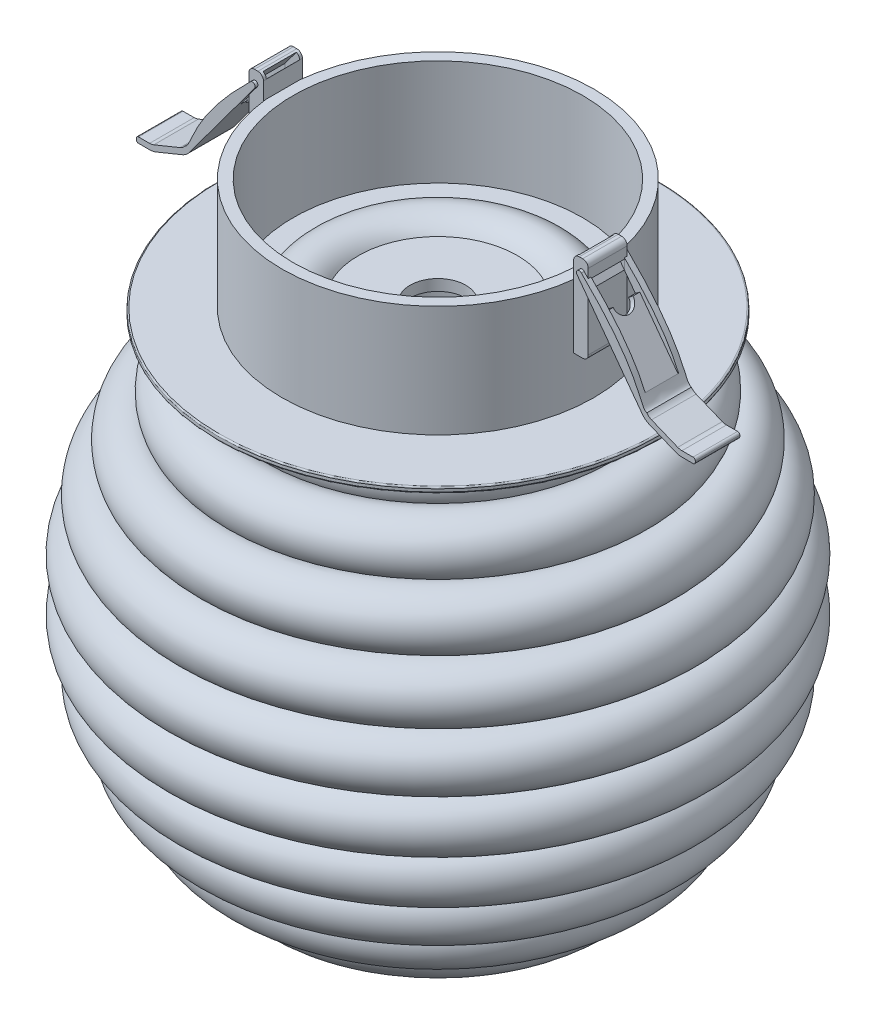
ISO-10303-21;
HEADER;
FILE_DESCRIPTION(('STEP AP214'),'2;1');
FILE_NAME('part.step','',(''),(''),'','','');
FILE_SCHEMA(('AUTOMOTIVE_DESIGN { 1 0 10303 214 1 1 1 1 }'));
ENDSEC;
DATA;
#1=APPLICATION_CONTEXT('core data for automotive mechanical design processes');
#2=APPLICATION_PROTOCOL_DEFINITION('international standard','automotive_design',2000,#1);
#3=PRODUCT_CONTEXT('',#1,'mechanical');
#4=PRODUCT('Part','Part','',(#3));
#5=PRODUCT_RELATED_PRODUCT_CATEGORY('part','',(#4));
#6=PRODUCT_DEFINITION_FORMATION('','',#4);
#7=PRODUCT_DEFINITION_CONTEXT('part definition',#1,'design');
#8=PRODUCT_DEFINITION('design','',#6,#7);
#9=PRODUCT_DEFINITION_SHAPE('','',#8);
#10=(LENGTH_UNIT() NAMED_UNIT(*) SI_UNIT(.MILLI.,.METRE.));
#11=(NAMED_UNIT(*) PLANE_ANGLE_UNIT() SI_UNIT($,.RADIAN.));
#12=(NAMED_UNIT(*) SI_UNIT($,.STERADIAN.) SOLID_ANGLE_UNIT());
#13=UNCERTAINTY_MEASURE_WITH_UNIT(LENGTH_MEASURE(1.E-05),#10,'distance_accuracy_value','');
#14=(GEOMETRIC_REPRESENTATION_CONTEXT(3) GLOBAL_UNCERTAINTY_ASSIGNED_CONTEXT((#13)) GLOBAL_UNIT_ASSIGNED_CONTEXT((#10,
#11,#12)) REPRESENTATION_CONTEXT('',''));
#15=CARTESIAN_POINT('',(0.,0.,0.));
#16=DIRECTION('',(0.,0.,1.));
#17=DIRECTION('',(1.,0.,0.));
#18=AXIS2_PLACEMENT_3D('',#15,#16,#17);
#19=CARTESIAN_POINT('',(-26.5681018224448,-11.8496909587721,0.));
#20=DIRECTION('',(0.,1.,0.));
#21=DIRECTION('',(0.,0.,1.));
#22=AXIS2_PLACEMENT_3D('',#19,#20,#21);
#23=CYLINDRICAL_SURFACE('',#22,15.);
#24=CARTESIAN_POINT('',(-26.5681018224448,-6.74014536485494,0.));
#25=DIRECTION('',(0.,-1.,0.));
#26=DIRECTION('',(0.,0.,-1.));
#27=AXIS2_PLACEMENT_3D('',#24,#25,#26);
#28=CIRCLE('',#27,15.);
#29=CARTESIAN_POINT('',(-26.5681018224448,-6.74014536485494,-15.));
#30=VERTEX_POINT('',#29);
#31=EDGE_CURVE('P0_E9',#30,#30,#28,.T.);
#32=ORIENTED_EDGE('',*,*,#31,.T.);
#33=EDGE_LOOP('',(#32));
#34=FACE_BOUND('',#33,.T.);
#35=CARTESIAN_POINT('',(-26.5681018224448,-11.8496909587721,0.));
#36=DIRECTION('',(0.,1.,0.));
#37=DIRECTION('',(0.,0.,1.));
#38=AXIS2_PLACEMENT_3D('',#35,#36,#37);
#39=CIRCLE('',#38,15.);
#40=CARTESIAN_POINT('',(-26.5681018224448,-11.8496909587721,15.));
#41=VERTEX_POINT('',#40);
#42=EDGE_CURVE('P0_E70',#41,#41,#39,.T.);
#43=ORIENTED_EDGE('',*,*,#42,.T.);
#44=EDGE_LOOP('',(#43));
#45=FACE_BOUND('',#44,.T.);
#46=ADVANCED_FACE('P0_F14',(#34,#45),#23,.T.);
#47=CARTESIAN_POINT('',(-26.5681018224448,-11.8496909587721,0.));
#48=DIRECTION('',(0.,1.,0.));
#49=DIRECTION('',(0.,0.,1.));
#50=AXIS2_PLACEMENT_3D('',#47,#48,#49);
#51=PLANE('',#50);
#52=CARTESIAN_POINT('',(-26.5681018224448,-11.8496909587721,0.));
#53=DIRECTION('',(0.,1.,0.));
#54=DIRECTION('',(0.,0.,1.));
#55=AXIS2_PLACEMENT_3D('',#52,#53,#54);
#56=CIRCLE('',#55,11.);
#57=CARTESIAN_POINT('',(-26.5681018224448,-11.8496909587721,11.));
#58=VERTEX_POINT('',#57);
#59=EDGE_CURVE('P0_E18',#58,#58,#56,.T.);
#60=ORIENTED_EDGE('',*,*,#59,.T.);
#61=EDGE_LOOP('',(#60));
#62=FACE_BOUND('',#61,.T.);
#63=ORIENTED_EDGE('',*,*,#42,.F.);
#64=EDGE_LOOP('',(#63));
#65=FACE_BOUND('',#64,.T.);
#66=ADVANCED_FACE('P0_F80',(#62,#65),#51,.F.);
#67=CARTESIAN_POINT('',(-26.5681018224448,-47.8496909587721,0.));
#68=DIRECTION('',(0.,1.,0.));
#69=DIRECTION('',(1.,0.,0.));
#70=AXIS2_PLACEMENT_3D('',#67,#68,#69);
#71=SPHERICAL_SURFACE('',#70,44.);
#72=CARTESIAN_POINT('',(-26.5681018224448,-6.74014536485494,0.));
#73=DIRECTION('',(0.,1.,0.));
#74=DIRECTION('',(0.,0.,1.));
#75=AXIS2_PLACEMENT_3D('',#72,#73,#74);
#76=CIRCLE('',#75,15.684554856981);
#77=CARTESIAN_POINT('',(-26.5681018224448,-6.74014536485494,15.684554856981));
#78=VERTEX_POINT('',#77);
#79=EDGE_CURVE('P0_E26',#78,#78,#76,.T.);
#80=ORIENTED_EDGE('',*,*,#79,.T.);
#81=EDGE_LOOP('',(#80));
#82=FACE_BOUND('',#81,.T.);
#83=ADVANCED_FACE('P0_F94',(#82),#71,.F.);
#84=CARTESIAN_POINT('',(-42.2526566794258,-6.74014536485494,0.));
#85=DIRECTION('',(0.,-1.,0.));
#86=DIRECTION('',(0.,0.,-1.));
#87=AXIS2_PLACEMENT_3D('',#84,#85,#86);
#88=PLANE('',#87);
#89=ORIENTED_EDGE('',*,*,#31,.F.);
#90=EDGE_LOOP('',(#89));
#91=FACE_BOUND('',#90,.T.);
#92=ORIENTED_EDGE('',*,*,#79,.F.);
#93=EDGE_LOOP('',(#92));
#94=FACE_BOUND('',#93,.T.);
#95=ADVANCED_FACE('P0_F85',(#91,#94),#88,.T.);
#96=CARTESIAN_POINT('',(-26.5681018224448,-15.8496909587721,0.));
#97=DIRECTION('',(0.,1.,0.));
#98=DIRECTION('',(0.,0.,1.));
#99=AXIS2_PLACEMENT_3D('',#96,#97,#98);
#100=CYLINDRICAL_SURFACE('',#99,11.);
#101=CARTESIAN_POINT('',(-26.5681018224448,-5.84969095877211,0.));
#102=DIRECTION('',(0.,1.,0.));
#103=DIRECTION('',(0.,0.,1.));
#104=AXIS2_PLACEMENT_3D('',#101,#102,#103);
#105=CIRCLE('',#104,11.);
#106=CARTESIAN_POINT('',(-26.5681018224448,-5.84969095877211,11.));
#107=VERTEX_POINT('',#106);
#108=EDGE_CURVE('P0_E73',#107,#107,#105,.T.);
#109=ORIENTED_EDGE('',*,*,#108,.T.);
#110=EDGE_LOOP('',(#109));
#111=FACE_BOUND('',#110,.T.);
#112=ORIENTED_EDGE('',*,*,#59,.F.);
#113=EDGE_LOOP('',(#112));
#114=FACE_BOUND('',#113,.T.);
#115=ADVANCED_FACE('P0_F83',(#111,#114),#100,.F.);
#116=CARTESIAN_POINT('',(-26.5681018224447,-92.8496909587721,0.));
#117=DIRECTION('',(0.,1.,0.));
#118=DIRECTION('',(-1.,0.,0.));
#119=AXIS2_PLACEMENT_3D('',#116,#117,#118);
#120=SPHERICAL_SURFACE('',#119,5.);
#121=CARTESIAN_POINT('',(-26.5681018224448,-94.0441433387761,0.));
#122=DIRECTION('',(0.,1.,0.));
#123=DIRECTION('',(0.,0.,1.));
#124=AXIS2_PLACEMENT_3D('',#121,#122,#123);
#125=CIRCLE('',#124,4.85523259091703);
#126=CARTESIAN_POINT('',(-26.5681018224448,-94.0441433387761,4.85523259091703));
#127=VERTEX_POINT('',#126);
#128=EDGE_CURVE('P0_E67',#127,#127,#125,.T.);
#129=ORIENTED_EDGE('',*,*,#128,.F.);
#130=EDGE_LOOP('',(#129));
#131=FACE_BOUND('',#130,.T.);
#132=ADVANCED_FACE('P0_F16',(#131),#120,.T.);
#133=CARTESIAN_POINT('',(-26.5681018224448,-6.74014536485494,0.));
#134=DIRECTION('',(0.,1.,0.));
#135=DIRECTION('',(0.,0.,1.));
#136=AXIS2_PLACEMENT_3D('',#133,#134,#135);
#137=TOROIDAL_SURFACE('',#136,18.3031489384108,4.99999999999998);
#138=CARTESIAN_POINT('',(-26.5681018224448,-5.84969095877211,0.));
#139=DIRECTION('',(0.,-1.,0.));
#140=DIRECTION('',(0.,0.,-1.));
#141=AXIS2_PLACEMENT_3D('',#138,#139,#140);
#142=CIRCLE('',#141,13.383078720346);
#143=CARTESIAN_POINT('',(-26.5681018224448,-5.84969095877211,-13.383078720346));
#144=VERTEX_POINT('',#143);
#145=EDGE_CURVE('P0_E22',#144,#144,#142,.F.);
#146=ORIENTED_EDGE('',*,*,#145,.F.);
#147=EDGE_LOOP('',(#146));
#148=FACE_BOUND('',#147,.T.);
#149=CARTESIAN_POINT('',(-26.5681018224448,-7.62375982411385,0.));
#150=DIRECTION('',(0.,1.,0.));
#151=DIRECTION('',(0.,0.,1.));
#152=AXIS2_PLACEMENT_3D('',#149,#150,#151);
#153=CIRCLE('',#152,23.224452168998);
#154=CARTESIAN_POINT('',(-26.5681018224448,-7.62375982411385,23.224452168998));
#155=VERTEX_POINT('',#154);
#156=EDGE_CURVE('P0_E31',#155,#155,#153,.T.);
#157=ORIENTED_EDGE('',*,*,#156,.T.);
#158=EDGE_LOOP('',(#157));
#159=FACE_BOUND('',#158,.T.);
#160=ADVANCED_FACE('P0_F92',(#148,#159),#137,.T.);
#161=CARTESIAN_POINT('',(-26.5681018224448,-11.4439262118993,0.));
#162=DIRECTION('',(0.,1.,0.));
#163=DIRECTION('',(0.,0.,1.));
#164=AXIS2_PLACEMENT_3D('',#161,#162,#163);
#165=TOROIDAL_SURFACE('',#164,26.4503363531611,4.99999999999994);
#166=CARTESIAN_POINT('',(-26.5681018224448,-13.3314280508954,0.));
#167=DIRECTION('',(0.,1.,0.));
#168=DIRECTION('',(0.,0.,1.));
#169=AXIS2_PLACEMENT_3D('',#166,#167,#168);
#170=CIRCLE('',#169,31.0803835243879);
#171=CARTESIAN_POINT('',(-26.5681018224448,-13.3314280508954,31.0803835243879));
#172=VERTEX_POINT('',#171);
#173=EDGE_CURVE('P0_E34',#172,#172,#170,.T.);
#174=ORIENTED_EDGE('',*,*,#173,.T.);
#175=EDGE_LOOP('',(#174));
#176=FACE_BOUND('',#175,.T.);
#177=ORIENTED_EDGE('',*,*,#156,.F.);
#178=EDGE_LOOP('',(#177));
#179=FACE_BOUND('',#178,.T.);
#180=ADVANCED_FACE('P0_F150',(#176,#179),#165,.T.);
#181=CARTESIAN_POINT('',(-26.5681018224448,-17.7388136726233,0.));
#182=DIRECTION('',(0.,1.,0.));
#183=DIRECTION('',(0.,0.,1.));
#184=AXIS2_PLACEMENT_3D('',#181,#182,#183);
#185=TOROIDAL_SURFACE('',#184,33.4415171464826,4.99999999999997);
#186=CARTESIAN_POINT('',(-26.5681018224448,-20.5477100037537,0.));
#187=DIRECTION('',(0.,1.,0.));
#188=DIRECTION('',(0.,0.,1.));
#189=AXIS2_PLACEMENT_3D('',#186,#187,#188);
#190=CIRCLE('',#189,37.5779529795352);
#191=CARTESIAN_POINT('',(-26.5681018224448,-20.5477100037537,37.5779529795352));
#192=VERTEX_POINT('',#191);
#193=EDGE_CURVE('P0_E37',#192,#192,#190,.T.);
#194=ORIENTED_EDGE('',*,*,#193,.T.);
#195=EDGE_LOOP('',(#194));
#196=FACE_BOUND('',#195,.T.);
#197=ORIENTED_EDGE('',*,*,#173,.F.);
#198=EDGE_LOOP('',(#197));
#199=FACE_BOUND('',#198,.T.);
#200=ADVANCED_FACE('P0_F146',(#196,#199),#185,.T.);
#201=CARTESIAN_POINT('',(-26.5681018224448,-25.3496909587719,0.));
#202=DIRECTION('',(0.,1.,0.));
#203=DIRECTION('',(0.,0.,1.));
#204=AXIS2_PLACEMENT_3D('',#201,#202,#203);
#205=TOROIDAL_SURFACE('',#204,38.9711431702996,4.99999999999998);
#206=CARTESIAN_POINT('',(-26.5681018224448,-28.9572195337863,0.));
#207=DIRECTION('',(0.,1.,0.));
#208=DIRECTION('',(0.,0.,1.));
#209=AXIS2_PLACEMENT_3D('',#206,#207,#208);
#210=CIRCLE('',#209,42.4331855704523);
#211=CARTESIAN_POINT('',(-26.5681018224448,-28.9572195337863,42.4331855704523));
#212=VERTEX_POINT('',#211);
#213=EDGE_CURVE('P0_E40',#212,#212,#210,.T.);
#214=ORIENTED_EDGE('',*,*,#213,.T.);
#215=EDGE_LOOP('',(#214));
#216=FACE_BOUND('',#215,.T.);
#217=ORIENTED_EDGE('',*,*,#193,.F.);
#218=EDGE_LOOP('',(#217));
#219=FACE_BOUND('',#218,.T.);
#220=ADVANCED_FACE('P0_F142',(#216,#219),#205,.T.);
#221=CARTESIAN_POINT('',(-26.5681018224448,-33.9439262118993,0.));
#222=DIRECTION('',(0.,1.,0.));
#223=DIRECTION('',(0.,0.,1.));
#224=AXIS2_PLACEMENT_3D('',#221,#222,#223);
#225=TOROIDAL_SURFACE('',#224,42.7975432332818,4.99999999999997);
#226=CARTESIAN_POINT('',(-26.5681018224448,-38.1924207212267,0.));
#227=DIRECTION('',(0.,1.,0.));
#228=DIRECTION('',(0.,0.,1.));
#229=AXIS2_PLACEMENT_3D('',#226,#227,#228);
#230=CIRCLE('',#229,45.4338843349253);
#231=CARTESIAN_POINT('',(-26.5681018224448,-38.1924207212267,45.4338843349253));
#232=VERTEX_POINT('',#231);
#233=EDGE_CURVE('P0_E43',#232,#232,#230,.T.);
#234=ORIENTED_EDGE('',*,*,#233,.T.);
#235=EDGE_LOOP('',(#234));
#236=FACE_BOUND('',#235,.T.);
#237=ORIENTED_EDGE('',*,*,#213,.F.);
#238=EDGE_LOOP('',(#237));
#239=FACE_BOUND('',#238,.T.);
#240=ADVANCED_FACE('P0_F138',(#236,#239),#225,.T.);
#241=CARTESIAN_POINT('',(-26.5681018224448,-43.1459101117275,0.));
#242=DIRECTION('',(0.,1.,0.));
#243=DIRECTION('',(0.,0.,1.));
#244=AXIS2_PLACEMENT_3D('',#241,#242,#243);
#245=TOROIDAL_SURFACE('',#244,44.7534852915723,5.);
#246=CARTESIAN_POINT('',(-26.5681018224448,-47.8496909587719,0.));
#247=DIRECTION('',(0.,1.,0.));
#248=DIRECTION('',(0.,0.,1.));
#249=AXIS2_PLACEMENT_3D('',#246,#247,#248);
#250=CIRCLE('',#249,46.4489043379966);
#251=CARTESIAN_POINT('',(-26.5681018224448,-47.8496909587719,46.4489043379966));
#252=VERTEX_POINT('',#251);
#253=EDGE_CURVE('P0_E46',#252,#252,#250,.T.);
#254=ORIENTED_EDGE('',*,*,#253,.T.);
#255=EDGE_LOOP('',(#254));
#256=FACE_BOUND('',#255,.T.);
#257=ORIENTED_EDGE('',*,*,#233,.F.);
#258=EDGE_LOOP('',(#257));
#259=FACE_BOUND('',#258,.T.);
#260=ADVANCED_FACE('P0_F134',(#256,#259),#245,.T.);
#261=CARTESIAN_POINT('',(-26.5681018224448,-52.5534718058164,0.));
#262=DIRECTION('',(0.,1.,0.));
#263=DIRECTION('',(0.,0.,1.));
#264=AXIS2_PLACEMENT_3D('',#261,#262,#263);
#265=TOROIDAL_SURFACE('',#264,44.7534852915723,5.);
#266=CARTESIAN_POINT('',(-26.5681018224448,-57.5069611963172,0.));
#267=DIRECTION('',(0.,1.,0.));
#268=DIRECTION('',(0.,0.,1.));
#269=AXIS2_PLACEMENT_3D('',#266,#267,#268);
#270=CIRCLE('',#269,45.4338843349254);
#271=CARTESIAN_POINT('',(-26.5681018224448,-57.5069611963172,45.4338843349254));
#272=VERTEX_POINT('',#271);
#273=EDGE_CURVE('P0_E49',#272,#272,#270,.T.);
#274=ORIENTED_EDGE('',*,*,#273,.T.);
#275=EDGE_LOOP('',(#274));
#276=FACE_BOUND('',#275,.T.);
#277=ORIENTED_EDGE('',*,*,#253,.F.);
#278=EDGE_LOOP('',(#277));
#279=FACE_BOUND('',#278,.T.);
#280=ADVANCED_FACE('P0_F130',(#276,#279),#265,.T.);
#281=CARTESIAN_POINT('',(-26.5681018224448,-61.7554557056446,0.));
#282=DIRECTION('',(0.,1.,0.));
#283=DIRECTION('',(0.,0.,1.));
#284=AXIS2_PLACEMENT_3D('',#281,#282,#283);
#285=TOROIDAL_SURFACE('',#284,42.797543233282,4.99999999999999);
#286=CARTESIAN_POINT('',(-26.5681018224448,-66.7421623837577,0.));
#287=DIRECTION('',(0.,1.,0.));
#288=DIRECTION('',(0.,0.,1.));
#289=AXIS2_PLACEMENT_3D('',#286,#287,#288);
#290=CIRCLE('',#289,42.4331855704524);
#291=CARTESIAN_POINT('',(-26.5681018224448,-66.7421623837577,42.4331855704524));
#292=VERTEX_POINT('',#291);
#293=EDGE_CURVE('P0_E52',#292,#292,#290,.T.);
#294=ORIENTED_EDGE('',*,*,#293,.T.);
#295=EDGE_LOOP('',(#294));
#296=FACE_BOUND('',#295,.T.);
#297=ORIENTED_EDGE('',*,*,#273,.F.);
#298=EDGE_LOOP('',(#297));
#299=FACE_BOUND('',#298,.T.);
#300=ADVANCED_FACE('P0_F126',(#296,#299),#285,.T.);
#301=CARTESIAN_POINT('',(-26.5681018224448,-70.349690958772,0.));
#302=DIRECTION('',(0.,1.,0.));
#303=DIRECTION('',(0.,0.,1.));
#304=AXIS2_PLACEMENT_3D('',#301,#302,#303);
#305=TOROIDAL_SURFACE('',#304,38.9711431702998,4.99999999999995);
#306=CARTESIAN_POINT('',(-26.5681018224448,-75.1516719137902,0.));
#307=DIRECTION('',(0.,1.,0.));
#308=DIRECTION('',(0.,0.,1.));
#309=AXIS2_PLACEMENT_3D('',#306,#307,#308);
#310=CIRCLE('',#309,37.5779529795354);
#311=CARTESIAN_POINT('',(-26.5681018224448,-75.1516719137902,37.5779529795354));
#312=VERTEX_POINT('',#311);
#313=EDGE_CURVE('P0_E55',#312,#312,#310,.T.);
#314=ORIENTED_EDGE('',*,*,#313,.T.);
#315=EDGE_LOOP('',(#314));
#316=FACE_BOUND('',#315,.T.);
#317=ORIENTED_EDGE('',*,*,#293,.F.);
#318=EDGE_LOOP('',(#317));
#319=FACE_BOUND('',#318,.T.);
#320=ADVANCED_FACE('P0_F122',(#316,#319),#305,.T.);
#321=CARTESIAN_POINT('',(-26.5681018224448,-77.9605682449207,0.));
#322=DIRECTION('',(0.,1.,0.));
#323=DIRECTION('',(0.,0.,1.));
#324=AXIS2_PLACEMENT_3D('',#321,#322,#323);
#325=TOROIDAL_SURFACE('',#324,33.4415171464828,4.99999999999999);
#326=CARTESIAN_POINT('',(-26.5681018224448,-82.3679538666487,0.));
#327=DIRECTION('',(0.,1.,0.));
#328=DIRECTION('',(0.,0.,1.));
#329=AXIS2_PLACEMENT_3D('',#326,#327,#328);
#330=CIRCLE('',#329,31.0803835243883);
#331=CARTESIAN_POINT('',(-26.5681018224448,-82.3679538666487,31.0803835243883));
#332=VERTEX_POINT('',#331);
#333=EDGE_CURVE('P0_E58',#332,#332,#330,.T.);
#334=ORIENTED_EDGE('',*,*,#333,.T.);
#335=EDGE_LOOP('',(#334));
#336=FACE_BOUND('',#335,.T.);
#337=ORIENTED_EDGE('',*,*,#313,.F.);
#338=EDGE_LOOP('',(#337));
#339=FACE_BOUND('',#338,.T.);
#340=ADVANCED_FACE('P0_F118',(#336,#339),#325,.T.);
#341=CARTESIAN_POINT('',(-26.5681018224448,-84.2554557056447,0.));
#342=DIRECTION('',(0.,1.,0.));
#343=DIRECTION('',(0.,0.,1.));
#344=AXIS2_PLACEMENT_3D('',#341,#342,#343);
#345=TOROIDAL_SURFACE('',#344,26.4503363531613,5.);
#346=CARTESIAN_POINT('',(-26.5681018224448,-88.0756220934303,0.));
#347=DIRECTION('',(0.,1.,0.));
#348=DIRECTION('',(0.,0.,1.));
#349=AXIS2_PLACEMENT_3D('',#346,#347,#348);
#350=CIRCLE('',#349,23.2244521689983);
#351=CARTESIAN_POINT('',(-26.5681018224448,-88.0756220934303,23.2244521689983));
#352=VERTEX_POINT('',#351);
#353=EDGE_CURVE('P0_E61',#352,#352,#350,.T.);
#354=ORIENTED_EDGE('',*,*,#353,.T.);
#355=EDGE_LOOP('',(#354));
#356=FACE_BOUND('',#355,.T.);
#357=ORIENTED_EDGE('',*,*,#333,.F.);
#358=EDGE_LOOP('',(#357));
#359=FACE_BOUND('',#358,.T.);
#360=ADVANCED_FACE('P0_F114',(#356,#359),#345,.T.);
#361=CARTESIAN_POINT('',(-26.5681018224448,-88.9592365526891,0.));
#362=DIRECTION('',(0.,1.,0.));
#363=DIRECTION('',(0.,0.,1.));
#364=AXIS2_PLACEMENT_3D('',#361,#362,#363);
#365=TOROIDAL_SURFACE('',#364,18.303148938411,5.);
#366=CARTESIAN_POINT('',(-26.5681018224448,-92.025224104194,0.));
#367=DIRECTION('',(0.,1.,0.));
#368=DIRECTION('',(0.,0.,1.));
#369=AXIS2_PLACEMENT_3D('',#366,#367,#368);
#370=CIRCLE('',#369,14.3535008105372);
#371=CARTESIAN_POINT('',(-26.5681018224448,-92.025224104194,14.3535008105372));
#372=VERTEX_POINT('',#371);
#373=EDGE_CURVE('P0_E64',#372,#372,#370,.T.);
#374=ORIENTED_EDGE('',*,*,#373,.T.);
#375=EDGE_LOOP('',(#374));
#376=FACE_BOUND('',#375,.T.);
#377=ORIENTED_EDGE('',*,*,#353,.F.);
#378=EDGE_LOOP('',(#377));
#379=FACE_BOUND('',#378,.T.);
#380=ADVANCED_FACE('P0_F110',(#376,#379),#365,.T.);
#381=CARTESIAN_POINT('',(-26.5681018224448,-91.8663329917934,0.));
#382=DIRECTION('',(0.,1.,0.));
#383=DIRECTION('',(0.,0.,1.));
#384=AXIS2_PLACEMENT_3D('',#381,#382,#383);
#385=TOROIDAL_SURFACE('',#384,9.35602608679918,5.);
#386=ORIENTED_EDGE('',*,*,#128,.T.);
#387=EDGE_LOOP('',(#386));
#388=FACE_BOUND('',#387,.T.);
#389=ORIENTED_EDGE('',*,*,#373,.F.);
#390=EDGE_LOOP('',(#389));
#391=FACE_BOUND('',#390,.T.);
#392=ADVANCED_FACE('P0_F106',(#388,#391),#385,.T.);
#393=CARTESIAN_POINT('',(-26.5681018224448,-5.84969095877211,0.));
#394=DIRECTION('',(0.,1.,0.));
#395=DIRECTION('',(0.,0.,1.));
#396=AXIS2_PLACEMENT_3D('',#393,#394,#395);
#397=PLANE('',#396);
#398=ORIENTED_EDGE('',*,*,#108,.F.);
#399=EDGE_LOOP('',(#398));
#400=FACE_BOUND('',#399,.T.);
#401=ORIENTED_EDGE('',*,*,#145,.T.);
#402=EDGE_LOOP('',(#401));
#403=FACE_BOUND('',#402,.T.);
#404=ADVANCED_FACE('P0_F109',(#400,#403),#397,.T.);
#405=CLOSED_SHELL('',(#46,#66,#83,#95,#115,#132,#160,#180,#200,#220,#240,#260,#280,#300,#320,
#340,#360,#380,#392,#404));
#406=MANIFOLD_SOLID_BREP('P0_B1',#405);
#407=CARTESIAN_POINT('',(-26.5681018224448,-4.84969095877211,0.));
#408=DIRECTION('',(0.,1.,0.));
#409=DIRECTION('',(0.,0.,1.));
#410=AXIS2_PLACEMENT_3D('',#407,#408,#409);
#411=PLANE('',#410);
#412=CARTESIAN_POINT('',(-26.5681018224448,-4.84969095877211,0.));
#413=DIRECTION('',(0.,1.,0.));
#414=DIRECTION('',(0.,0.,1.));
#415=AXIS2_PLACEMENT_3D('',#412,#413,#414);
#416=CIRCLE('',#415,28.);
#417=CARTESIAN_POINT('',(-26.5681018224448,-4.84969095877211,28.));
#418=VERTEX_POINT('',#417);
#419=EDGE_CURVE('P1_E39',#418,#418,#416,.T.);
#420=ORIENTED_EDGE('',*,*,#419,.F.);
#421=EDGE_LOOP('',(#420));
#422=FACE_BOUND('',#421,.T.);
#423=CARTESIAN_POINT('',(-26.5681018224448,-4.84969095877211,0.));
#424=DIRECTION('',(0.,1.,0.));
#425=DIRECTION('',(0.,0.,1.));
#426=AXIS2_PLACEMENT_3D('',#423,#424,#425);
#427=CIRCLE('',#426,39.25);
#428=CARTESIAN_POINT('',(-26.5681018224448,-4.84969095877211,39.25));
#429=VERTEX_POINT('',#428);
#430=EDGE_CURVE('P1_E32',#429,#429,#427,.T.);
#431=ORIENTED_EDGE('',*,*,#430,.T.);
#432=EDGE_LOOP('',(#431));
#433=FACE_BOUND('',#432,.T.);
#434=ADVANCED_FACE('P1_F15',(#422,#433),#411,.T.);
#435=CARTESIAN_POINT('',(-26.5681018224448,-5.84969095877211,0.));
#436=DIRECTION('',(0.,1.,0.));
#437=DIRECTION('',(0.,0.,1.));
#438=AXIS2_PLACEMENT_3D('',#435,#436,#437);
#439=PLANE('',#438);
#440=CARTESIAN_POINT('',(-26.5681018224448,-5.84969095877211,0.));
#441=DIRECTION('',(0.,1.,0.));
#442=DIRECTION('',(0.,0.,1.));
#443=AXIS2_PLACEMENT_3D('',#440,#441,#442);
#444=CIRCLE('',#443,39.25);
#445=CARTESIAN_POINT('',(-26.5681018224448,-5.84969095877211,39.25));
#446=VERTEX_POINT('',#445);
#447=EDGE_CURVE('P1_E10',#446,#446,#444,.F.);
#448=ORIENTED_EDGE('',*,*,#447,.T.);
#449=EDGE_LOOP('',(#448));
#450=FACE_BOUND('',#449,.T.);
#451=CARTESIAN_POINT('',(-26.5681018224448,-5.84969095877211,0.));
#452=DIRECTION('',(0.,1.,0.));
#453=DIRECTION('',(0.,0.,1.));
#454=AXIS2_PLACEMENT_3D('',#451,#452,#453);
#455=CIRCLE('',#454,5.);
#456=CARTESIAN_POINT('',(-26.5681018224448,-5.84969095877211,5.));
#457=VERTEX_POINT('',#456);
#458=EDGE_CURVE('P1_E35',#457,#457,#455,.T.);
#459=ORIENTED_EDGE('',*,*,#458,.T.);
#460=EDGE_LOOP('',(#459));
#461=FACE_BOUND('',#460,.T.);
#462=ADVANCED_FACE('P1_F73',(#450,#461),#439,.F.);
#463=CARTESIAN_POINT('',(-26.5681018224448,-4.84969095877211,0.));
#464=DIRECTION('',(0.,-1.,0.));
#465=DIRECTION('',(0.,0.,-1.));
#466=AXIS2_PLACEMENT_3D('',#463,#464,#465);
#467=CYLINDRICAL_SURFACE('',#466,39.5);
#468=CARTESIAN_POINT('',(-26.5681018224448,-5.09969095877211,0.));
#469=DIRECTION('',(0.,1.,0.));
#470=DIRECTION('',(0.,0.,1.));
#471=AXIS2_PLACEMENT_3D('',#468,#469,#470);
#472=CIRCLE('',#471,39.5);
#473=CARTESIAN_POINT('',(-26.5681018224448,-5.09969095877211,39.5));
#474=VERTEX_POINT('',#473);
#475=EDGE_CURVE('P1_E23',#474,#474,#472,.F.);
#476=ORIENTED_EDGE('',*,*,#475,.T.);
#477=EDGE_LOOP('',(#476));
#478=FACE_BOUND('',#477,.T.);
#479=CARTESIAN_POINT('',(-26.5681018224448,-5.59969095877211,0.));
#480=DIRECTION('',(0.,1.,0.));
#481=DIRECTION('',(0.,0.,1.));
#482=AXIS2_PLACEMENT_3D('',#479,#480,#481);
#483=CIRCLE('',#482,39.5);
#484=CARTESIAN_POINT('',(-26.5681018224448,-5.59969095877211,39.5));
#485=VERTEX_POINT('',#484);
#486=EDGE_CURVE('P1_E27',#485,#485,#483,.T.);
#487=ORIENTED_EDGE('',*,*,#486,.T.);
#488=EDGE_LOOP('',(#487));
#489=FACE_BOUND('',#488,.T.);
#490=ADVANCED_FACE('P1_F79',(#478,#489),#467,.T.);
#491=CARTESIAN_POINT('',(-26.5681018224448,-4.84969095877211,0.));
#492=DIRECTION('',(0.,-1.,0.));
#493=DIRECTION('',(0.,0.,-1.));
#494=AXIS2_PLACEMENT_3D('',#491,#492,#493);
#495=CYLINDRICAL_SURFACE('',#494,5.);
#496=ORIENTED_EDGE('',*,*,#458,.F.);
#497=EDGE_LOOP('',(#496));
#498=FACE_BOUND('',#497,.T.);
#499=CARTESIAN_POINT('',(-26.5681018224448,-3.8496909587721,0.));
#500=DIRECTION('',(0.,1.,0.));
#501=DIRECTION('',(0.,0.,1.));
#502=AXIS2_PLACEMENT_3D('',#499,#500,#501);
#503=CIRCLE('',#502,5.);
#504=CARTESIAN_POINT('',(-26.5681018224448,-3.8496909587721,5.));
#505=VERTEX_POINT('',#504);
#506=EDGE_CURVE('P1_E47',#505,#505,#503,.T.);
#507=ORIENTED_EDGE('',*,*,#506,.T.);
#508=EDGE_LOOP('',(#507));
#509=FACE_BOUND('',#508,.T.);
#510=ADVANCED_FACE('P1_F51',(#498,#509),#495,.F.);
#511=CARTESIAN_POINT('',(-26.5681018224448,-5.09969095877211,0.));
#512=DIRECTION('',(0.,1.,0.));
#513=DIRECTION('',(0.,0.,1.));
#514=AXIS2_PLACEMENT_3D('',#511,#512,#513);
#515=TOROIDAL_SURFACE('',#514,39.25,0.25);
#516=ORIENTED_EDGE('',*,*,#475,.F.);
#517=EDGE_LOOP('',(#516));
#518=FACE_BOUND('',#517,.T.);
#519=ORIENTED_EDGE('',*,*,#430,.F.);
#520=EDGE_LOOP('',(#519));
#521=FACE_BOUND('',#520,.T.);
#522=ADVANCED_FACE('P1_F88',(#518,#521),#515,.T.);
#523=CARTESIAN_POINT('',(-26.5681018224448,-5.59969095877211,0.));
#524=DIRECTION('',(0.,1.,0.));
#525=DIRECTION('',(0.,0.,1.));
#526=AXIS2_PLACEMENT_3D('',#523,#524,#525);
#527=TOROIDAL_SURFACE('',#526,39.25,0.25);
#528=ORIENTED_EDGE('',*,*,#447,.F.);
#529=EDGE_LOOP('',(#528));
#530=FACE_BOUND('',#529,.T.);
#531=ORIENTED_EDGE('',*,*,#486,.F.);
#532=EDGE_LOOP('',(#531));
#533=FACE_BOUND('',#532,.T.);
#534=ADVANCED_FACE('P1_F17',(#530,#533),#527,.T.);
#535=CARTESIAN_POINT('',(-26.5681018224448,15.1503090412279,0.));
#536=DIRECTION('',(0.,-1.,0.));
#537=DIRECTION('',(0.,0.,-1.));
#538=AXIS2_PLACEMENT_3D('',#535,#536,#537);
#539=CYLINDRICAL_SURFACE('',#538,28.);
#540=CARTESIAN_POINT('',(-26.5681018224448,15.1503090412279,0.));
#541=DIRECTION('',(0.,1.,0.));
#542=DIRECTION('',(0.,0.,1.));
#543=AXIS2_PLACEMENT_3D('',#540,#541,#542);
#544=CIRCLE('',#543,28.);
#545=CARTESIAN_POINT('',(-26.5681018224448,15.1503090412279,28.));
#546=VERTEX_POINT('',#545);
#547=EDGE_CURVE('P1_E38',#546,#546,#544,.T.);
#548=ORIENTED_EDGE('',*,*,#547,.F.);
#549=EDGE_LOOP('',(#548));
#550=FACE_BOUND('',#549,.T.);
#551=ORIENTED_EDGE('',*,*,#419,.T.);
#552=EDGE_LOOP('',(#551));
#553=FACE_BOUND('',#552,.T.);
#554=ADVANCED_FACE('P1_F68',(#550,#553),#539,.T.);
#555=CARTESIAN_POINT('',(-26.5681018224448,15.1503090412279,0.));
#556=DIRECTION('',(0.,1.,0.));
#557=DIRECTION('',(0.,0.,1.));
#558=AXIS2_PLACEMENT_3D('',#555,#556,#557);
#559=PLANE('',#558);
#560=CARTESIAN_POINT('',(-26.5681018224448,15.1503090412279,0.));
#561=DIRECTION('',(0.,1.,0.));
#562=DIRECTION('',(0.,0.,1.));
#563=AXIS2_PLACEMENT_3D('',#560,#561,#562);
#564=CIRCLE('',#563,26.);
#565=CARTESIAN_POINT('',(-26.5681018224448,15.1503090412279,26.));
#566=VERTEX_POINT('',#565);
#567=EDGE_CURVE('P1_E19',#566,#566,#564,.F.);
#568=ORIENTED_EDGE('',*,*,#567,.T.);
#569=EDGE_LOOP('',(#568));
#570=FACE_BOUND('',#569,.T.);
#571=ORIENTED_EDGE('',*,*,#547,.T.);
#572=EDGE_LOOP('',(#571));
#573=FACE_BOUND('',#572,.T.);
#574=ADVANCED_FACE('P1_F61',(#570,#573),#559,.T.);
#575=CARTESIAN_POINT('',(-26.5681018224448,30.1503090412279,0.));
#576=DIRECTION('',(0.,-1.,0.));
#577=DIRECTION('',(0.,0.,-1.));
#578=AXIS2_PLACEMENT_3D('',#575,#576,#577);
#579=CYLINDRICAL_SURFACE('',#578,26.);
#580=ORIENTED_EDGE('',*,*,#567,.F.);
#581=EDGE_LOOP('',(#580));
#582=FACE_BOUND('',#581,.T.);
#583=CARTESIAN_POINT('',(-26.5681018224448,-3.8496909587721,0.));
#584=DIRECTION('',(0.,1.,0.));
#585=DIRECTION('',(0.,0.,1.));
#586=AXIS2_PLACEMENT_3D('',#583,#584,#585);
#587=CIRCLE('',#586,26.);
#588=CARTESIAN_POINT('',(-26.5681018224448,-3.8496909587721,26.));
#589=VERTEX_POINT('',#588);
#590=EDGE_CURVE('P1_E44',#589,#589,#587,.T.);
#591=ORIENTED_EDGE('',*,*,#590,.F.);
#592=EDGE_LOOP('',(#591));
#593=FACE_BOUND('',#592,.T.);
#594=ADVANCED_FACE('P1_F56',(#582,#593),#579,.F.);
#595=CARTESIAN_POINT('',(-26.5681018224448,-3.8496909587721,0.));
#596=DIRECTION('',(0.,1.,0.));
#597=DIRECTION('',(0.,0.,1.));
#598=AXIS2_PLACEMENT_3D('',#595,#596,#597);
#599=PLANE('',#598);
#600=ORIENTED_EDGE('',*,*,#506,.F.);
#601=EDGE_LOOP('',(#600));
#602=FACE_BOUND('',#601,.T.);
#603=ORIENTED_EDGE('',*,*,#590,.T.);
#604=EDGE_LOOP('',(#603));
#605=FACE_BOUND('',#604,.T.);
#606=ADVANCED_FACE('P1_F53',(#602,#605),#599,.T.);
#607=CLOSED_SHELL('',(#434,#462,#490,#510,#522,#534,#554,#574,#594,#606));
#608=MANIFOLD_SOLID_BREP('P1_B1',#607);
#609=CARTESIAN_POINT('',(2.79834681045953,17.0971815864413,4.));
#610=DIRECTION('',(0.,0.,-1.));
#611=DIRECTION('',(1.,0.,0.));
#612=AXIS2_PLACEMENT_3D('',#609,#610,#611);
#613=CYLINDRICAL_SURFACE('',#612,0.500000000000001);
#614=DIRECTION('',(0.,0.,-1.));
#615=VECTOR('',#614,1.);
#616=CARTESIAN_POINT('',(3.20016089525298,17.3947474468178,4.));
#617=LINE('',#616,#615);
#618=CARTESIAN_POINT('',(3.20016089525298,17.3947474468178,-3.));
#619=VERTEX_POINT('',#618);
#620=CARTESIAN_POINT('',(3.20016089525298,17.3947474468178,-4.));
#621=VERTEX_POINT('',#620);
#622=EDGE_CURVE('P2_E25',#619,#621,#617,.T.);
#623=ORIENTED_EDGE('',*,*,#622,.T.);
#624=CARTESIAN_POINT('',(2.79834681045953,17.0971815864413,-4.));
#625=DIRECTION('',(0.,0.,-1.));
#626=DIRECTION('',(-1.,0.,0.));
#627=AXIS2_PLACEMENT_3D('',#624,#625,#626);
#628=CIRCLE('',#627,0.500000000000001);
#629=CARTESIAN_POINT('',(2.39653272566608,16.7996157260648,-4.));
#630=VERTEX_POINT('',#629);
#631=EDGE_CURVE('P2_E164',#630,#621,#628,.T.);
#632=ORIENTED_EDGE('',*,*,#631,.F.);
#633=DIRECTION('',(0.,0.,-1.));
#634=VECTOR('',#633,1.);
#635=CARTESIAN_POINT('',(2.39653272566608,16.7996157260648,4.));
#636=LINE('',#635,#634);
#637=CARTESIAN_POINT('',(2.39653272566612,16.7996157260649,-3.));
#638=VERTEX_POINT('',#637);
#639=EDGE_CURVE('P2_E163',#638,#630,#636,.T.);
#640=ORIENTED_EDGE('',*,*,#639,.F.);
#641=CARTESIAN_POINT('',(2.79834681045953,17.0971815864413,-3.));
#642=DIRECTION('',(0.,0.,1.));
#643=DIRECTION('',(1.,0.,0.));
#644=AXIS2_PLACEMENT_3D('',#641,#642,#643);
#645=CIRCLE('',#644,0.500000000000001);
#646=EDGE_CURVE('P2_E246',#619,#638,#645,.T.);
#647=ORIENTED_EDGE('',*,*,#646,.F.);
#648=EDGE_LOOP('',(#623,#632,#640,#647));
#649=FACE_BOUND('',#648,.T.);
#650=ADVANCED_FACE('P2_F17',(#649),#613,.T.);
#651=CARTESIAN_POINT('',(3.20016089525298,17.3947474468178,4.));
#652=CARTESIAN_POINT('',(14.163162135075,6.75005023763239,4.));
#653=CARTESIAN_POINT('',(13.4200793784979,2.11723547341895,4.));
#654=CARTESIAN_POINT('',(14.9334321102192,1.55088139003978,4.));
#655=B_SPLINE_CURVE_WITH_KNOTS('',3,(#651,#652,#653,#654),.UNSPECIFIED.,.F.,.F.,(4,4),(0.,1.),.UNSPECIFIED.);
#656=DIRECTION('',(0.,0.,-1.));
#657=VECTOR('',#656,1.);
#658=SURFACE_OF_LINEAR_EXTRUSION('',#655,#657);
#659=CARTESIAN_POINT('',(3.20016089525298,17.3947474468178,-3.));
#660=CARTESIAN_POINT('',(3.54463841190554,17.0602437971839,-3.));
#661=CARTESIAN_POINT('',(3.88651093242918,16.7230361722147,-3.));
#662=CARTESIAN_POINT('',(4.56594795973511,16.0411752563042,-3.));
#663=CARTESIAN_POINT('',(4.90348499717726,15.6964946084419,-3.));
#664=CARTESIAN_POINT('',(5.57298685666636,14.9996588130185,-3.));
#665=CARTESIAN_POINT('',(5.90493074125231,14.6474835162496,-3.));
#666=CARTESIAN_POINT('',(6.56187587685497,13.9355427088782,-3.));
#667=CARTESIAN_POINT('',(6.88686369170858,13.5757647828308,-3.));
#668=CARTESIAN_POINT('',(7.52843722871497,12.8484140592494,-3.));
#669=CARTESIAN_POINT('',(7.84501803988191,12.4808369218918,-3.));
#670=CARTESIAN_POINT('',(8.46193477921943,11.7450267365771,-3.));
#671=CARTESIAN_POINT('',(8.76247070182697,11.3769616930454,-3.));
#672=CARTESIAN_POINT('',(9.35237444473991,10.6325166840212,-3.));
#673=CARTESIAN_POINT('',(9.64175224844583,10.2561446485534,-3.));
#674=CARTESIAN_POINT('',(10.2075157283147,9.49445548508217,-3.));
#675=CARTESIAN_POINT('',(10.4839171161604,9.10915006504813,-3.));
#676=CARTESIAN_POINT('',(11.0216588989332,8.32880154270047,-3.));
#677=CARTESIAN_POINT('',(11.283016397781,7.93377025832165,-3.));
#678=CARTESIAN_POINT('',(11.7883633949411,7.1329566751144,-3.));
#679=CARTESIAN_POINT('',(12.0323617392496,6.7271799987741,-3.));
#680=CARTESIAN_POINT('',(12.3511903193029,6.16672768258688,-3.));
#681=CARTESIAN_POINT('',(12.4346742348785,6.01693884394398,-3.));
#682=CARTESIAN_POINT('',(12.5989506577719,5.7158587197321,-3.));
#683=CARTESIAN_POINT('',(12.6797427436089,5.56456720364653,-3.));
#684=CARTESIAN_POINT('',(12.8385646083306,5.26052182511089,-3.));
#685=CARTESIAN_POINT('',(12.9165940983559,5.10776781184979,-3.));
#686=CARTESIAN_POINT('',(13.0702269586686,4.80022654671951,-3.));
#687=CARTESIAN_POINT('',(13.1458184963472,4.64543338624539,-3.));
#688=CARTESIAN_POINT('',(13.2943796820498,4.33460655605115,-3.));
#689=CARTESIAN_POINT('',(13.3673494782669,4.17857295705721,-3.));
#690=CARTESIAN_POINT('',(13.4751854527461,3.94380237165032,-3.));
#691=CARTESIAN_POINT('',(13.5108574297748,3.86543352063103,-3.));
#692=CARTESIAN_POINT('',(13.581788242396,3.70851072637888,-3.));
#693=CARTESIAN_POINT('',(13.6170470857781,3.62995678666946,-3.));
#694=CARTESIAN_POINT('',(13.6521619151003,3.55133891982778,-3.));
#695=B_SPLINE_CURVE_WITH_KNOTS('',3,(#659,#660,#661,#662,#663,#664,#665,#666,#667,#668,#669,
#670,#671,#672,#673,#674,#675,#676,#677,#678,#679,#680,#681,#682,#683,#684,#685,#686,#687,#688,
#689,#690,#691,#692,#693,#694),.UNSPECIFIED.,.F.,.F.,(4,2,2,2,2,2,2,2,2,2,2,2,2,2,2,2,2,4),(0.,
1.4404993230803,2.88770561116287,4.33947732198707,5.79383792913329,7.24903020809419,
8.67438327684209,10.0984299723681,11.5207054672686,12.9413306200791,14.3612265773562,
14.8756534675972,15.390160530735,15.9047212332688,16.4214874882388,16.9382244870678,
17.1965402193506,17.4548510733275),.UNSPECIFIED.);
#696=CARTESIAN_POINT('',(13.6521619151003,3.55133891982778,-3.));
#697=VERTEX_POINT('',#696);
#698=EDGE_CURVE('P2_E252',#619,#697,#695,.T.);
#699=ORIENTED_EDGE('',*,*,#698,.T.);
#700=DIRECTION('',(0.,0.,-1.));
#701=VECTOR('',#700,1.);
#702=CARTESIAN_POINT('',(13.6521619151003,3.55133891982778,3.));
#703=LINE('',#702,#701);
#704=CARTESIAN_POINT('',(13.6521619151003,3.55133891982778,3.));
#705=VERTEX_POINT('',#704);
#706=EDGE_CURVE('P2_E288',#705,#697,#703,.T.);
#707=ORIENTED_EDGE('',*,*,#706,.F.);
#708=CARTESIAN_POINT('',(3.20016089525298,17.3947474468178,3.));
#709=CARTESIAN_POINT('',(3.54463841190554,17.0602437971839,3.));
#710=CARTESIAN_POINT('',(3.88651093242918,16.7230361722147,3.));
#711=CARTESIAN_POINT('',(4.56594795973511,16.0411752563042,3.));
#712=CARTESIAN_POINT('',(4.90348499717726,15.6964946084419,3.));
#713=CARTESIAN_POINT('',(5.57298685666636,14.9996588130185,3.));
#714=CARTESIAN_POINT('',(5.90493074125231,14.6474835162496,3.));
#715=CARTESIAN_POINT('',(6.56187587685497,13.9355427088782,3.));
#716=CARTESIAN_POINT('',(6.88686369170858,13.5757647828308,3.));
#717=CARTESIAN_POINT('',(7.52843722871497,12.8484140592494,3.));
#718=CARTESIAN_POINT('',(7.84501803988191,12.4808369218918,3.));
#719=CARTESIAN_POINT('',(8.46193477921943,11.7450267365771,3.));
#720=CARTESIAN_POINT('',(8.76247070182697,11.3769616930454,3.));
#721=CARTESIAN_POINT('',(9.35237444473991,10.6325166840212,3.));
#722=CARTESIAN_POINT('',(9.64175224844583,10.2561446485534,3.));
#723=CARTESIAN_POINT('',(10.2075157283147,9.49445548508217,3.));
#724=CARTESIAN_POINT('',(10.4839171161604,9.10915006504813,3.));
#725=CARTESIAN_POINT('',(11.0216588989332,8.32880154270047,3.));
#726=CARTESIAN_POINT('',(11.283016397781,7.93377025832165,3.));
#727=CARTESIAN_POINT('',(11.7883633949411,7.1329566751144,3.));
#728=CARTESIAN_POINT('',(12.0323617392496,6.7271799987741,3.));
#729=CARTESIAN_POINT('',(12.3511903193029,6.16672768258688,3.));
#730=CARTESIAN_POINT('',(12.4346742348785,6.01693884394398,3.));
#731=CARTESIAN_POINT('',(12.5989506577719,5.7158587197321,3.));
#732=CARTESIAN_POINT('',(12.6797427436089,5.56456720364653,3.));
#733=CARTESIAN_POINT('',(12.8385646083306,5.26052182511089,3.));
#734=CARTESIAN_POINT('',(12.9165940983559,5.10776781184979,3.));
#735=CARTESIAN_POINT('',(13.0702269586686,4.80022654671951,3.));
#736=CARTESIAN_POINT('',(13.1458184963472,4.64543338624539,3.));
#737=CARTESIAN_POINT('',(13.2943796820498,4.33460655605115,3.));
#738=CARTESIAN_POINT('',(13.3673494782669,4.17857295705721,3.));
#739=CARTESIAN_POINT('',(13.4751854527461,3.94380237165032,3.));
#740=CARTESIAN_POINT('',(13.5108574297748,3.86543352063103,3.));
#741=CARTESIAN_POINT('',(13.581788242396,3.70851072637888,3.));
#742=CARTESIAN_POINT('',(13.6170470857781,3.62995678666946,3.));
#743=CARTESIAN_POINT('',(13.6521619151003,3.55133891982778,3.));
#744=B_SPLINE_CURVE_WITH_KNOTS('',3,(#708,#709,#710,#711,#712,#713,#714,#715,#716,#717,#718,
#719,#720,#721,#722,#723,#724,#725,#726,#727,#728,#729,#730,#731,#732,#733,#734,#735,#736,#737,
#738,#739,#740,#741,#742,#743),.UNSPECIFIED.,.F.,.F.,(4,2,2,2,2,2,2,2,2,2,2,2,2,2,2,2,2,4),(0.,
1.4404993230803,2.88770561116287,4.33947732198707,5.79383792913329,7.24903020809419,
8.67438327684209,10.0984299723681,11.5207054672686,12.9413306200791,14.3612265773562,
14.8756534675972,15.390160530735,15.9047212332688,16.4214874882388,16.9382244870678,
17.1965402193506,17.4548510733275),.UNSPECIFIED.);
#745=CARTESIAN_POINT('',(3.20016089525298,17.3947474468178,3.));
#746=VERTEX_POINT('',#745);
#747=EDGE_CURVE('P2_E279',#746,#705,#744,.T.);
#748=ORIENTED_EDGE('',*,*,#747,.F.);
#749=CARTESIAN_POINT('',(3.20016089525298,17.3947474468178,4.));
#750=VERTEX_POINT('',#749);
#751=EDGE_CURVE('P2_E11',#750,#746,#617,.T.);
#752=ORIENTED_EDGE('',*,*,#751,.F.);
#753=CARTESIAN_POINT('',(14.9334321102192,1.55088139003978,4.));
#754=VERTEX_POINT('',#753);
#755=EDGE_CURVE('P2_E378',#750,#754,#655,.T.);
#756=ORIENTED_EDGE('',*,*,#755,.T.);
#757=DIRECTION('',(0.,0.,-1.));
#758=VECTOR('',#757,1.);
#759=CARTESIAN_POINT('',(14.9334321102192,1.55088139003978,4.));
#760=LINE('',#759,#758);
#761=CARTESIAN_POINT('',(14.9334321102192,1.55088139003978,-4.));
#762=VERTEX_POINT('',#761);
#763=EDGE_CURVE('P2_E233',#754,#762,#760,.T.);
#764=ORIENTED_EDGE('',*,*,#763,.T.);
#765=CARTESIAN_POINT('',(3.20016089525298,17.3947474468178,-4.));
#766=CARTESIAN_POINT('',(14.163162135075,6.75005023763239,-4.));
#767=CARTESIAN_POINT('',(13.4200793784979,2.11723547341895,-4.));
#768=CARTESIAN_POINT('',(14.9334321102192,1.55088139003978,-4.));
#769=B_SPLINE_CURVE_WITH_KNOTS('',3,(#765,#766,#767,#768),.UNSPECIFIED.,.F.,.F.,(4,4),(0.,1.),.UNSPECIFIED.);
#770=EDGE_CURVE('P2_E166',#621,#762,#769,.T.);
#771=ORIENTED_EDGE('',*,*,#770,.F.);
#772=ORIENTED_EDGE('',*,*,#622,.F.);
#773=EDGE_LOOP('',(#699,#707,#748,#752,#756,#764,#771,#772));
#774=FACE_BOUND('',#773,.T.);
#775=ADVANCED_FACE('P2_F248',(#774),#658,.T.);
#776=CARTESIAN_POINT('',(2.39653272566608,16.7996157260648,4.));
#777=VERTEX_POINT('',#776);
#778=CARTESIAN_POINT('',(2.39653272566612,16.7996157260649,2.9851983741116));
#779=VERTEX_POINT('',#778);
#780=EDGE_CURVE('P2_E206',#777,#779,#636,.T.);
#781=ORIENTED_EDGE('',*,*,#780,.F.);
#782=CARTESIAN_POINT('',(2.79834681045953,17.0971815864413,4.));
#783=DIRECTION('',(0.,0.,-1.));
#784=DIRECTION('',(-1.,0.,0.));
#785=AXIS2_PLACEMENT_3D('',#782,#783,#784);
#786=CIRCLE('',#785,0.500000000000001);
#787=EDGE_CURVE('P2_E99',#777,#750,#786,.T.);
#788=ORIENTED_EDGE('',*,*,#787,.T.);
#789=ORIENTED_EDGE('',*,*,#751,.T.);
#790=DIRECTION('',(0.,0.,-1.));
#791=VECTOR('',#790,1.);
#792=CARTESIAN_POINT('',(3.20016089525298,17.3947474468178,3.));
#793=LINE('',#792,#791);
#794=CARTESIAN_POINT('',(3.20016089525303,17.3947474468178,2.9851983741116));
#795=VERTEX_POINT('',#794);
#796=EDGE_CURVE('P2_E285',#746,#795,#793,.T.);
#797=ORIENTED_EDGE('',*,*,#796,.T.);
#798=CARTESIAN_POINT('',(2.79834681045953,17.0971815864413,2.9851983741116));
#799=DIRECTION('',(0.,0.,-1.));
#800=DIRECTION('',(0.,-1.,0.));
#801=AXIS2_PLACEMENT_3D('',#798,#799,#800);
#802=CIRCLE('',#801,0.500000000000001);
#803=EDGE_CURVE('P2_E421',#779,#795,#802,.T.);
#804=ORIENTED_EDGE('',*,*,#803,.F.);
#805=EDGE_LOOP('',(#781,#788,#789,#797,#804));
#806=FACE_BOUND('',#805,.T.);
#807=ADVANCED_FACE('P2_F19',(#806),#613,.T.);
#808=CARTESIAN_POINT('',(16.540688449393,2.74114483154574,4.));
#809=DIRECTION('',(0.,0.,-1.));
#810=DIRECTION('',(1.,0.,0.));
#811=AXIS2_PLACEMENT_3D('',#808,#809,#810);
#812=CYLINDRICAL_SURFACE('',#811,2.);
#813=CARTESIAN_POINT('',(16.540688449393,2.74114483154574,-4.));
#814=DIRECTION('',(0.,0.,1.));
#815=DIRECTION('',(1.,0.,0.));
#816=AXIS2_PLACEMENT_3D('',#813,#814,#815);
#817=CIRCLE('',#816,2.);
#818=CARTESIAN_POINT('',(15.783776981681,0.889906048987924,-4.));
#819=VERTEX_POINT('',#818);
#820=EDGE_CURVE('P2_E172',#762,#819,#817,.T.);
#821=ORIENTED_EDGE('',*,*,#820,.F.);
#822=ORIENTED_EDGE('',*,*,#763,.F.);
#823=CARTESIAN_POINT('',(16.540688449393,2.74114483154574,4.));
#824=DIRECTION('',(0.,0.,1.));
#825=DIRECTION('',(1.,0.,0.));
#826=AXIS2_PLACEMENT_3D('',#823,#824,#825);
#827=CIRCLE('',#826,2.);
#828=CARTESIAN_POINT('',(15.783776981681,0.889906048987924,4.));
#829=VERTEX_POINT('',#828);
#830=EDGE_CURVE('P2_E383',#754,#829,#827,.T.);
#831=ORIENTED_EDGE('',*,*,#830,.T.);
#832=DIRECTION('',(0.,0.,-1.));
#833=VECTOR('',#832,1.);
#834=CARTESIAN_POINT('',(15.783776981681,0.889906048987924,4.));
#835=LINE('',#834,#833);
#836=EDGE_CURVE('P2_E231',#829,#819,#835,.T.);
#837=ORIENTED_EDGE('',*,*,#836,.T.);
#838=EDGE_LOOP('',(#821,#822,#831,#837));
#839=FACE_BOUND('',#838,.T.);
#840=ADVANCED_FACE('P2_F372',(#839),#812,.F.);
#841=CARTESIAN_POINT('',(15.783776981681,0.889906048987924,4.));
#842=DIRECTION('',(-0.37845573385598,-0.925619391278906,0.));
#843=DIRECTION('',(-0.925619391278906,0.37845573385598,0.));
#844=AXIS2_PLACEMENT_3D('',#841,#842,#843);
#845=PLANE('',#844);
#846=DIRECTION('',(0.925619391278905,-0.37845573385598,0.));
#847=VECTOR('',#846,1.);
#848=CARTESIAN_POINT('',(15.783776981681,0.889906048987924,-4.));
#849=LINE('',#848,#847);
#850=CARTESIAN_POINT('',(20.4862930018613,-1.03280016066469,-4.));
#851=VERTEX_POINT('',#850);
#852=EDGE_CURVE('P2_E178',#819,#851,#849,.T.);
#853=ORIENTED_EDGE('',*,*,#852,.F.);
#854=ORIENTED_EDGE('',*,*,#836,.F.);
#855=DIRECTION('',(0.925619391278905,-0.37845573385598,0.));
#856=VECTOR('',#855,1.);
#857=CARTESIAN_POINT('',(15.783776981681,0.889906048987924,4.));
#858=LINE('',#857,#856);
#859=CARTESIAN_POINT('',(20.4862930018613,-1.03280016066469,4.));
#860=VERTEX_POINT('',#859);
#861=EDGE_CURVE('P2_E389',#829,#860,#858,.T.);
#862=ORIENTED_EDGE('',*,*,#861,.T.);
#863=DIRECTION('',(0.,0.,-1.));
#864=VECTOR('',#863,1.);
#865=CARTESIAN_POINT('',(20.4862930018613,-1.03280016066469,4.));
#866=LINE('',#865,#864);
#867=EDGE_CURVE('P2_E228',#860,#851,#866,.T.);
#868=ORIENTED_EDGE('',*,*,#867,.T.);
#869=EDGE_LOOP('',(#853,#854,#862,#868));
#870=FACE_BOUND('',#869,.T.);
#871=ADVANCED_FACE('P2_F368',(#870),#845,.F.);
#872=CARTESIAN_POINT('',(21.2432044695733,0.818438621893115,4.));
#873=DIRECTION('',(0.,0.,-1.));
#874=DIRECTION('',(1.,0.,0.));
#875=AXIS2_PLACEMENT_3D('',#872,#873,#874);
#876=CYLINDRICAL_SURFACE('',#875,2.);
#877=CARTESIAN_POINT('',(21.2432044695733,0.818438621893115,-4.));
#878=DIRECTION('',(0.,0.,1.));
#879=DIRECTION('',(1.,0.,0.));
#880=AXIS2_PLACEMENT_3D('',#877,#878,#879);
#881=CIRCLE('',#880,2.);
#882=CARTESIAN_POINT('',(21.2432044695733,-1.18156137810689,-4.));
#883=VERTEX_POINT('',#882);
#884=EDGE_CURVE('P2_E181',#851,#883,#881,.T.);
#885=ORIENTED_EDGE('',*,*,#884,.F.);
#886=ORIENTED_EDGE('',*,*,#867,.F.);
#887=CARTESIAN_POINT('',(21.2432044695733,0.818438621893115,4.));
#888=DIRECTION('',(0.,0.,1.));
#889=DIRECTION('',(1.,0.,0.));
#890=AXIS2_PLACEMENT_3D('',#887,#888,#889);
#891=CIRCLE('',#890,2.);
#892=CARTESIAN_POINT('',(21.2432044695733,-1.18156137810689,4.));
#893=VERTEX_POINT('',#892);
#894=EDGE_CURVE('P2_E392',#860,#893,#891,.T.);
#895=ORIENTED_EDGE('',*,*,#894,.T.);
#896=DIRECTION('',(0.,0.,-1.));
#897=VECTOR('',#896,1.);
#898=CARTESIAN_POINT('',(21.2432044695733,-1.18156137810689,4.));
#899=LINE('',#898,#897);
#900=EDGE_CURVE('P2_E225',#893,#883,#899,.T.);
#901=ORIENTED_EDGE('',*,*,#900,.T.);
#902=EDGE_LOOP('',(#885,#886,#895,#901));
#903=FACE_BOUND('',#902,.T.);
#904=ADVANCED_FACE('P2_F364',(#903),#876,.F.);
#905=CARTESIAN_POINT('',(21.2432044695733,-1.18156137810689,4.));
#906=DIRECTION('',(0.,-1.,0.));
#907=DIRECTION('',(-1.,0.,0.));
#908=AXIS2_PLACEMENT_3D('',#905,#906,#907);
#909=PLANE('',#908);
#910=DIRECTION('',(1.,0.,0.));
#911=VECTOR('',#910,1.);
#912=CARTESIAN_POINT('',(21.2432044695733,-1.18156137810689,-4.));
#913=LINE('',#912,#911);
#914=CARTESIAN_POINT('',(23.2359492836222,-1.18156137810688,-4.));
#915=VERTEX_POINT('',#914);
#916=EDGE_CURVE('P2_E184',#883,#915,#913,.T.);
#917=ORIENTED_EDGE('',*,*,#916,.F.);
#918=ORIENTED_EDGE('',*,*,#900,.F.);
#919=DIRECTION('',(1.,0.,0.));
#920=VECTOR('',#919,1.);
#921=CARTESIAN_POINT('',(21.2432044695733,-1.18156137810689,4.));
#922=LINE('',#921,#920);
#923=CARTESIAN_POINT('',(23.2359492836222,-1.18156137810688,4.));
#924=VERTEX_POINT('',#923);
#925=EDGE_CURVE('P2_E395',#893,#924,#922,.T.);
#926=ORIENTED_EDGE('',*,*,#925,.T.);
#927=DIRECTION('',(0.,0.,-1.));
#928=VECTOR('',#927,1.);
#929=CARTESIAN_POINT('',(23.2359492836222,-1.18156137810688,4.));
#930=LINE('',#929,#928);
#931=EDGE_CURVE('P2_E222',#924,#915,#930,.T.);
#932=ORIENTED_EDGE('',*,*,#931,.T.);
#933=EDGE_LOOP('',(#917,#918,#926,#932));
#934=FACE_BOUND('',#933,.T.);
#935=ADVANCED_FACE('P2_F360',(#934),#909,.F.);
#936=CARTESIAN_POINT('',(23.2359492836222,-1.58156137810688,4.));
#937=DIRECTION('',(0.,0.,-1.));
#938=DIRECTION('',(1.,0.,0.));
#939=AXIS2_PLACEMENT_3D('',#936,#937,#938);
#940=CYLINDRICAL_SURFACE('',#939,0.399999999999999);
#941=CARTESIAN_POINT('',(23.2359492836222,-1.58156137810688,-4.));
#942=DIRECTION('',(0.,0.,-1.));
#943=DIRECTION('',(-1.,0.,0.));
#944=AXIS2_PLACEMENT_3D('',#941,#942,#943);
#945=CIRCLE('',#944,0.399999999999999);
#946=CARTESIAN_POINT('',(23.6359492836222,-1.58156137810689,-4.));
#947=VERTEX_POINT('',#946);
#948=EDGE_CURVE('P2_E187',#915,#947,#945,.T.);
#949=ORIENTED_EDGE('',*,*,#948,.F.);
#950=ORIENTED_EDGE('',*,*,#931,.F.);
#951=CARTESIAN_POINT('',(23.2359492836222,-1.58156137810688,4.));
#952=DIRECTION('',(0.,0.,-1.));
#953=DIRECTION('',(-1.,0.,0.));
#954=AXIS2_PLACEMENT_3D('',#951,#952,#953);
#955=CIRCLE('',#954,0.399999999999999);
#956=CARTESIAN_POINT('',(23.6359492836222,-1.58156137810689,4.));
#957=VERTEX_POINT('',#956);
#958=EDGE_CURVE('P2_E398',#924,#957,#955,.T.);
#959=ORIENTED_EDGE('',*,*,#958,.T.);
#960=DIRECTION('',(0.,0.,-1.));
#961=VECTOR('',#960,1.);
#962=CARTESIAN_POINT('',(23.6359492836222,-1.58156137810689,4.));
#963=LINE('',#962,#961);
#964=EDGE_CURVE('P2_E219',#957,#947,#963,.T.);
#965=ORIENTED_EDGE('',*,*,#964,.T.);
#966=EDGE_LOOP('',(#949,#950,#959,#965));
#967=FACE_BOUND('',#966,.T.);
#968=ADVANCED_FACE('P2_F356',(#967),#940,.T.);
#969=CARTESIAN_POINT('',(23.6359492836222,-1.58156137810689,4.));
#970=DIRECTION('',(-1.,0.,0.));
#971=DIRECTION('',(0.,0.,-1.));
#972=AXIS2_PLACEMENT_3D('',#969,#970,#971);
#973=PLANE('',#972);
#974=DIRECTION('',(0.,-1.,0.));
#975=VECTOR('',#974,1.);
#976=CARTESIAN_POINT('',(23.6359492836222,-1.58156137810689,-4.));
#977=LINE('',#976,#975);
#978=CARTESIAN_POINT('',(23.6359492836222,-1.78156137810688,-4.));
#979=VERTEX_POINT('',#978);
#980=EDGE_CURVE('P2_E190',#947,#979,#977,.T.);
#981=ORIENTED_EDGE('',*,*,#980,.F.);
#982=ORIENTED_EDGE('',*,*,#964,.F.);
#983=DIRECTION('',(0.,-1.,0.));
#984=VECTOR('',#983,1.);
#985=CARTESIAN_POINT('',(23.6359492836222,-1.58156137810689,4.));
#986=LINE('',#985,#984);
#987=CARTESIAN_POINT('',(23.6359492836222,-1.78156137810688,4.));
#988=VERTEX_POINT('',#987);
#989=EDGE_CURVE('P2_E401',#957,#988,#986,.T.);
#990=ORIENTED_EDGE('',*,*,#989,.T.);
#991=DIRECTION('',(0.,0.,-1.));
#992=VECTOR('',#991,1.);
#993=CARTESIAN_POINT('',(23.6359492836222,-1.78156137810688,4.));
#994=LINE('',#993,#992);
#995=EDGE_CURVE('P2_E216',#988,#979,#994,.T.);
#996=ORIENTED_EDGE('',*,*,#995,.T.);
#997=EDGE_LOOP('',(#981,#982,#990,#996));
#998=FACE_BOUND('',#997,.T.);
#999=ADVANCED_FACE('P2_F352',(#998),#973,.F.);
#1000=CARTESIAN_POINT('',(23.2359492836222,-1.78156137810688,4.));
#1001=DIRECTION('',(0.,0.,-1.));
#1002=DIRECTION('',(1.,0.,0.));
#1003=AXIS2_PLACEMENT_3D('',#1000,#1001,#1002);
#1004=CYLINDRICAL_SURFACE('',#1003,0.399999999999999);
#1005=CARTESIAN_POINT('',(23.2359492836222,-1.78156137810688,-4.));
#1006=DIRECTION('',(0.,0.,-1.));
#1007=DIRECTION('',(1.,0.,0.));
#1008=AXIS2_PLACEMENT_3D('',#1005,#1006,#1007);
#1009=CIRCLE('',#1008,0.399999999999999);
#1010=CARTESIAN_POINT('',(23.2359492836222,-2.18156137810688,-4.));
#1011=VERTEX_POINT('',#1010);
#1012=EDGE_CURVE('P2_E193',#979,#1011,#1009,.T.);
#1013=ORIENTED_EDGE('',*,*,#1012,.F.);
#1014=ORIENTED_EDGE('',*,*,#995,.F.);
#1015=CARTESIAN_POINT('',(23.2359492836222,-1.78156137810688,4.));
#1016=DIRECTION('',(0.,0.,-1.));
#1017=DIRECTION('',(1.,0.,0.));
#1018=AXIS2_PLACEMENT_3D('',#1015,#1016,#1017);
#1019=CIRCLE('',#1018,0.399999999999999);
#1020=CARTESIAN_POINT('',(23.2359492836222,-2.18156137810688,4.));
#1021=VERTEX_POINT('',#1020);
#1022=EDGE_CURVE('P2_E404',#988,#1021,#1019,.T.);
#1023=ORIENTED_EDGE('',*,*,#1022,.T.);
#1024=DIRECTION('',(0.,0.,-1.));
#1025=VECTOR('',#1024,1.);
#1026=CARTESIAN_POINT('',(23.2359492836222,-2.18156137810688,4.));
#1027=LINE('',#1026,#1025);
#1028=EDGE_CURVE('P2_E213',#1021,#1011,#1027,.T.);
#1029=ORIENTED_EDGE('',*,*,#1028,.T.);
#1030=EDGE_LOOP('',(#1013,#1014,#1023,#1029));
#1031=FACE_BOUND('',#1030,.T.);
#1032=ADVANCED_FACE('P2_F348',(#1031),#1004,.T.);
#1033=CARTESIAN_POINT('',(21.2432044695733,-2.18156137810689,4.));
#1034=DIRECTION('',(0.,1.,0.));
#1035=DIRECTION('',(1.,0.,0.));
#1036=AXIS2_PLACEMENT_3D('',#1033,#1034,#1035);
#1037=PLANE('',#1036);
#1038=DIRECTION('',(-1.,0.,0.));
#1039=VECTOR('',#1038,1.);
#1040=CARTESIAN_POINT('',(21.2432044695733,-2.18156137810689,-4.));
#1041=LINE('',#1040,#1039);
#1042=CARTESIAN_POINT('',(21.2432044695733,-2.18156137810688,-4.));
#1043=VERTEX_POINT('',#1042);
#1044=EDGE_CURVE('P2_E196',#1011,#1043,#1041,.T.);
#1045=ORIENTED_EDGE('',*,*,#1044,.F.);
#1046=ORIENTED_EDGE('',*,*,#1028,.F.);
#1047=DIRECTION('',(-1.,0.,0.));
#1048=VECTOR('',#1047,1.);
#1049=CARTESIAN_POINT('',(21.2432044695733,-2.18156137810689,4.));
#1050=LINE('',#1049,#1048);
#1051=CARTESIAN_POINT('',(21.2432044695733,-2.18156137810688,4.));
#1052=VERTEX_POINT('',#1051);
#1053=EDGE_CURVE('P2_E158',#1021,#1052,#1050,.T.);
#1054=ORIENTED_EDGE('',*,*,#1053,.T.);
#1055=DIRECTION('',(0.,0.,-1.));
#1056=VECTOR('',#1055,1.);
#1057=CARTESIAN_POINT('',(21.2432044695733,-2.18156137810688,4.));
#1058=LINE('',#1057,#1056);
#1059=EDGE_CURVE('P2_E210',#1052,#1043,#1058,.T.);
#1060=ORIENTED_EDGE('',*,*,#1059,.T.);
#1061=EDGE_LOOP('',(#1045,#1046,#1054,#1060));
#1062=FACE_BOUND('',#1061,.T.);
#1063=ADVANCED_FACE('P2_F344',(#1062),#1037,.F.);
#1064=CARTESIAN_POINT('',(21.2432044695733,0.818438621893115,4.));
#1065=DIRECTION('',(0.,0.,-1.));
#1066=DIRECTION('',(1.,0.,0.));
#1067=AXIS2_PLACEMENT_3D('',#1064,#1065,#1066);
#1068=CYLINDRICAL_SURFACE('',#1067,3.);
#1069=CARTESIAN_POINT('',(21.2432044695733,0.818438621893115,-4.));
#1070=DIRECTION('',(0.,0.,-1.));
#1071=DIRECTION('',(1.,0.,0.));
#1072=AXIS2_PLACEMENT_3D('',#1069,#1070,#1071);
#1073=CIRCLE('',#1072,3.);
#1074=CARTESIAN_POINT('',(20.1078372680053,-1.9584195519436,-4.));
#1075=VERTEX_POINT('',#1074);
#1076=EDGE_CURVE('P2_E199',#1043,#1075,#1073,.T.);
#1077=ORIENTED_EDGE('',*,*,#1076,.F.);
#1078=ORIENTED_EDGE('',*,*,#1059,.F.);
#1079=CARTESIAN_POINT('',(21.2432044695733,0.818438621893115,4.));
#1080=DIRECTION('',(0.,0.,-1.));
#1081=DIRECTION('',(1.,0.,0.));
#1082=AXIS2_PLACEMENT_3D('',#1079,#1080,#1081);
#1083=CIRCLE('',#1082,3.);
#1084=CARTESIAN_POINT('',(20.1078372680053,-1.9584195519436,4.));
#1085=VERTEX_POINT('',#1084);
#1086=EDGE_CURVE('P2_E156',#1052,#1085,#1083,.T.);
#1087=ORIENTED_EDGE('',*,*,#1086,.T.);
#1088=DIRECTION('',(0.,0.,-1.));
#1089=VECTOR('',#1088,1.);
#1090=CARTESIAN_POINT('',(20.1078372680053,-1.9584195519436,4.));
#1091=LINE('',#1090,#1089);
#1092=EDGE_CURVE('P2_E150',#1085,#1075,#1091,.T.);
#1093=ORIENTED_EDGE('',*,*,#1092,.T.);
#1094=EDGE_LOOP('',(#1077,#1078,#1087,#1093));
#1095=FACE_BOUND('',#1094,.T.);
#1096=ADVANCED_FACE('P2_F341',(#1095),#1068,.T.);
#1097=CARTESIAN_POINT('',(15.405321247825,-0.0357133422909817,4.));
#1098=DIRECTION('',(0.37845573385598,0.925619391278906,0.));
#1099=DIRECTION('',(0.925619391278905,-0.37845573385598,0.));
#1100=AXIS2_PLACEMENT_3D('',#1097,#1098,#1099);
#1101=PLANE('',#1100);
#1102=DIRECTION('',(-0.925619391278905,0.37845573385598,0.));
#1103=VECTOR('',#1102,1.);
#1104=CARTESIAN_POINT('',(15.405321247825,-0.0357133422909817,-4.));
#1105=LINE('',#1104,#1103);
#1106=CARTESIAN_POINT('',(15.405321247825,-0.0357133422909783,-4.));
#1107=VERTEX_POINT('',#1106);
#1108=EDGE_CURVE('P2_E202',#1075,#1107,#1105,.T.);
#1109=ORIENTED_EDGE('',*,*,#1108,.F.);
#1110=ORIENTED_EDGE('',*,*,#1092,.F.);
#1111=DIRECTION('',(-0.925619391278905,0.37845573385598,0.));
#1112=VECTOR('',#1111,1.);
#1113=CARTESIAN_POINT('',(15.405321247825,-0.0357133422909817,4.));
#1114=LINE('',#1113,#1112);
#1115=CARTESIAN_POINT('',(15.405321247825,-0.0357133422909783,4.));
#1116=VERTEX_POINT('',#1115);
#1117=EDGE_CURVE('P2_E139',#1085,#1116,#1114,.T.);
#1118=ORIENTED_EDGE('',*,*,#1117,.T.);
#1119=DIRECTION('',(0.,0.,-1.));
#1120=VECTOR('',#1119,1.);
#1121=CARTESIAN_POINT('',(15.405321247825,-0.0357133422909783,4.));
#1122=LINE('',#1121,#1120);
#1123=EDGE_CURVE('P2_E145',#1116,#1107,#1122,.T.);
#1124=ORIENTED_EDGE('',*,*,#1123,.T.);
#1125=EDGE_LOOP('',(#1109,#1110,#1118,#1124));
#1126=FACE_BOUND('',#1125,.T.);
#1127=ADVANCED_FACE('P2_F153',(#1126),#1101,.F.);
#1128=CARTESIAN_POINT('',(16.540688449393,2.74114483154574,4.));
#1129=DIRECTION('',(0.,0.,-1.));
#1130=DIRECTION('',(1.,0.,0.));
#1131=AXIS2_PLACEMENT_3D('',#1128,#1129,#1130);
#1132=CYLINDRICAL_SURFACE('',#1131,3.);
#1133=CARTESIAN_POINT('',(16.540688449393,2.74114483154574,-4.));
#1134=DIRECTION('',(0.,0.,-1.));
#1135=DIRECTION('',(1.,0.,0.));
#1136=AXIS2_PLACEMENT_3D('',#1133,#1134,#1135);
#1137=CIRCLE('',#1136,3.);
#1138=CARTESIAN_POINT('',(14.1298039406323,0.955749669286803,-4.));
#1139=VERTEX_POINT('',#1138);
#1140=EDGE_CURVE('P2_E147',#1107,#1139,#1137,.T.);
#1141=ORIENTED_EDGE('',*,*,#1140,.F.);
#1142=ORIENTED_EDGE('',*,*,#1123,.F.);
#1143=CARTESIAN_POINT('',(16.540688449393,2.74114483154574,4.));
#1144=DIRECTION('',(0.,0.,-1.));
#1145=DIRECTION('',(1.,0.,0.));
#1146=AXIS2_PLACEMENT_3D('',#1143,#1144,#1145);
#1147=CIRCLE('',#1146,3.);
#1148=CARTESIAN_POINT('',(14.1298039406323,0.955749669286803,4.));
#1149=VERTEX_POINT('',#1148);
#1150=EDGE_CURVE('P2_E135',#1116,#1149,#1147,.T.);
#1151=ORIENTED_EDGE('',*,*,#1150,.T.);
#1152=DIRECTION('',(0.,0.,-1.));
#1153=VECTOR('',#1152,1.);
#1154=CARTESIAN_POINT('',(14.1298039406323,0.955749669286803,4.));
#1155=LINE('',#1154,#1153);
#1156=EDGE_CURVE('P2_E151',#1149,#1139,#1155,.T.);
#1157=ORIENTED_EDGE('',*,*,#1156,.T.);
#1158=EDGE_LOOP('',(#1141,#1142,#1151,#1157));
#1159=FACE_BOUND('',#1158,.T.);
#1160=ADVANCED_FACE('P2_F146',(#1159),#1132,.T.);
#1161=CARTESIAN_POINT('',(2.39653272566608,16.7996157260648,4.));
#1162=DIRECTION('',(0.803628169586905,0.595131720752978,0.));
#1163=DIRECTION('',(0.595131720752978,-0.803628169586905,0.));
#1164=AXIS2_PLACEMENT_3D('',#1161,#1162,#1163);
#1165=PLANE('',#1164);
#1166=ORIENTED_EDGE('',*,*,#639,.T.);
#1167=DIRECTION('',(-0.595131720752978,0.803628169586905,0.));
#1168=VECTOR('',#1167,1.);
#1169=CARTESIAN_POINT('',(2.39653272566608,16.7996157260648,-4.));
#1170=LINE('',#1169,#1168);
#1171=EDGE_CURVE('P2_E92',#1139,#630,#1170,.T.);
#1172=ORIENTED_EDGE('',*,*,#1171,.F.);
#1173=ORIENTED_EDGE('',*,*,#1156,.F.);
#1174=DIRECTION('',(-0.595131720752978,0.803628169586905,0.));
#1175=VECTOR('',#1174,1.);
#1176=CARTESIAN_POINT('',(2.39653272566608,16.7996157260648,4.));
#1177=LINE('',#1176,#1175);
#1178=EDGE_CURVE('P2_E41',#1149,#777,#1177,.T.);
#1179=ORIENTED_EDGE('',*,*,#1178,.T.);
#1180=ORIENTED_EDGE('',*,*,#780,.T.);
#1181=DIRECTION('',(-0.595131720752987,0.803628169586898,0.));
#1182=VECTOR('',#1181,1.);
#1183=CARTESIAN_POINT('',(-0.589392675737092,20.8316202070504,2.9851983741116));
#1184=LINE('',#1183,#1182);
#1185=CARTESIAN_POINT('',(5.87603965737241,12.1011100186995,2.9851983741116));
#1186=VERTEX_POINT('',#1185);
#1187=EDGE_CURVE('P2_E426',#1186,#779,#1184,.T.);
#1188=ORIENTED_EDGE('',*,*,#1187,.F.);
#1189=DIRECTION('',(0.,0.,1.));
#1190=VECTOR('',#1189,1.);
#1191=CARTESIAN_POINT('',(5.87603965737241,12.1011100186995,1.77998688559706));
#1192=LINE('',#1191,#1190);
#1193=CARTESIAN_POINT('',(5.87603965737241,12.1011100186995,1.77998688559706));
#1194=VERTEX_POINT('',#1193);
#1195=EDGE_CURVE('P2_E466',#1194,#1186,#1192,.T.);
#1196=ORIENTED_EDGE('',*,*,#1195,.F.);
#1197=CARTESIAN_POINT('',(5.87603965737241,12.1011100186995,-0.00740081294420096));
#1198=DIRECTION('',(-0.803628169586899,-0.595131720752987,0.));
#1199=DIRECTION('',(0.595131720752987,-0.803628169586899,0.));
#1200=AXIS2_PLACEMENT_3D('',#1197,#1198,#1199);
#1201=CIRCLE('',#1200,1.78738769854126);
#1202=CARTESIAN_POINT('',(5.87603965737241,12.1011100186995,-1.79478851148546));
#1203=VERTEX_POINT('',#1202);
#1204=EDGE_CURVE('P2_E464',#1203,#1194,#1201,.T.);
#1205=ORIENTED_EDGE('',*,*,#1204,.F.);
#1206=DIRECTION('',(0.,0.,1.));
#1207=VECTOR('',#1206,1.);
#1208=CARTESIAN_POINT('',(5.87603965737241,12.1011100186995,-3.));
#1209=LINE('',#1208,#1207);
#1210=CARTESIAN_POINT('',(5.87603965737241,12.1011100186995,-3.));
#1211=VERTEX_POINT('',#1210);
#1212=EDGE_CURVE('P2_E455',#1211,#1203,#1209,.T.);
#1213=ORIENTED_EDGE('',*,*,#1212,.F.);
#1214=DIRECTION('',(0.595131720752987,-0.803628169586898,0.));
#1215=VECTOR('',#1214,1.);
#1216=CARTESIAN_POINT('',(-0.589392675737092,20.8316202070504,-3.));
#1217=LINE('',#1216,#1215);
#1218=EDGE_CURVE('P2_E460',#638,#1211,#1217,.T.);
#1219=ORIENTED_EDGE('',*,*,#1218,.F.);
#1220=EDGE_LOOP('',(#1166,#1172,#1173,#1179,#1180,#1188,#1196,#1205,#1213,#1219));
#1221=FACE_BOUND('',#1220,.T.);
#1222=ADVANCED_FACE('P2_F332',(#1221),#1165,.F.);
#1223=CARTESIAN_POINT('',(2.79834681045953,17.0971815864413,4.));
#1224=DIRECTION('',(0.,0.,1.));
#1225=DIRECTION('',(-1.,0.,0.));
#1226=AXIS2_PLACEMENT_3D('',#1223,#1224,#1225);
#1227=PLANE('',#1226);
#1228=ORIENTED_EDGE('',*,*,#787,.F.);
#1229=ORIENTED_EDGE('',*,*,#1178,.F.);
#1230=ORIENTED_EDGE('',*,*,#1150,.F.);
#1231=ORIENTED_EDGE('',*,*,#1117,.F.);
#1232=ORIENTED_EDGE('',*,*,#1086,.F.);
#1233=ORIENTED_EDGE('',*,*,#1053,.F.);
#1234=ORIENTED_EDGE('',*,*,#1022,.F.);
#1235=ORIENTED_EDGE('',*,*,#989,.F.);
#1236=ORIENTED_EDGE('',*,*,#958,.F.);
#1237=ORIENTED_EDGE('',*,*,#925,.F.);
#1238=ORIENTED_EDGE('',*,*,#894,.F.);
#1239=ORIENTED_EDGE('',*,*,#861,.F.);
#1240=ORIENTED_EDGE('',*,*,#830,.F.);
#1241=ORIENTED_EDGE('',*,*,#755,.F.);
#1242=EDGE_LOOP('',(#1228,#1229,#1230,#1231,#1232,#1233,#1234,#1235,#1236,#1237,#1238,#1239,
#1240,#1241));
#1243=FACE_BOUND('',#1242,.T.);
#1244=ADVANCED_FACE('P2_F137',(#1243),#1227,.T.);
#1245=CARTESIAN_POINT('',(2.79834681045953,17.0971815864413,-4.));
#1246=DIRECTION('',(0.,0.,1.));
#1247=DIRECTION('',(-1.,0.,0.));
#1248=AXIS2_PLACEMENT_3D('',#1245,#1246,#1247);
#1249=PLANE('',#1248);
#1250=ORIENTED_EDGE('',*,*,#631,.T.);
#1251=ORIENTED_EDGE('',*,*,#770,.T.);
#1252=ORIENTED_EDGE('',*,*,#820,.T.);
#1253=ORIENTED_EDGE('',*,*,#852,.T.);
#1254=ORIENTED_EDGE('',*,*,#884,.T.);
#1255=ORIENTED_EDGE('',*,*,#916,.T.);
#1256=ORIENTED_EDGE('',*,*,#948,.T.);
#1257=ORIENTED_EDGE('',*,*,#980,.T.);
#1258=ORIENTED_EDGE('',*,*,#1012,.T.);
#1259=ORIENTED_EDGE('',*,*,#1044,.T.);
#1260=ORIENTED_EDGE('',*,*,#1076,.T.);
#1261=ORIENTED_EDGE('',*,*,#1108,.T.);
#1262=ORIENTED_EDGE('',*,*,#1140,.T.);
#1263=ORIENTED_EDGE('',*,*,#1171,.T.);
#1264=EDGE_LOOP('',(#1250,#1251,#1252,#1253,#1254,#1255,#1256,#1257,#1258,#1259,#1260,#1261,
#1262,#1263));
#1265=FACE_BOUND('',#1264,.T.);
#1266=ADVANCED_FACE('P2_F327',(#1265),#1249,.F.);
#1267=CARTESIAN_POINT('',(16.540688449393,2.74114483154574,4.));
#1268=DIRECTION('',(0.,0.,-1.));
#1269=DIRECTION('',(1.,0.,0.));
#1270=AXIS2_PLACEMENT_3D('',#1267,#1268,#1269);
#1271=CYLINDRICAL_SURFACE('',#1270,3.);
#1272=CARTESIAN_POINT('',(16.540688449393,2.74114483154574,-3.));
#1273=DIRECTION('',(0.,0.,-1.));
#1274=DIRECTION('',(-1.,0.,0.));
#1275=AXIS2_PLACEMENT_3D('',#1272,#1273,#1274);
#1276=CIRCLE('',#1275,3.);
#1277=CARTESIAN_POINT('',(13.6026771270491,3.34784860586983,-3.));
#1278=VERTEX_POINT('',#1277);
#1279=EDGE_CURVE('P2_E271',#697,#1278,#1276,.F.);
#1280=ORIENTED_EDGE('',*,*,#1279,.T.);
#1281=DIRECTION('',(0.,0.,-1.));
#1282=VECTOR('',#1281,1.);
#1283=CARTESIAN_POINT('',(13.6026771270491,3.34784860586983,4.));
#1284=LINE('',#1283,#1282);
#1285=CARTESIAN_POINT('',(13.6026771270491,3.34784860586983,3.));
#1286=VERTEX_POINT('',#1285);
#1287=EDGE_CURVE('P2_E167',#1278,#1286,#1284,.F.);
#1288=ORIENTED_EDGE('',*,*,#1287,.T.);
#1289=CARTESIAN_POINT('',(16.540688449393,2.74114483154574,3.));
#1290=DIRECTION('',(0.,0.,-1.));
#1291=DIRECTION('',(-1.,0.,0.));
#1292=AXIS2_PLACEMENT_3D('',#1289,#1290,#1291);
#1293=CIRCLE('',#1292,3.);
#1294=EDGE_CURVE('P2_E297',#705,#1286,#1293,.F.);
#1295=ORIENTED_EDGE('',*,*,#1294,.F.);
#1296=ORIENTED_EDGE('',*,*,#706,.T.);
#1297=EDGE_LOOP('',(#1280,#1288,#1295,#1296));
#1298=FACE_BOUND('',#1297,.T.);
#1299=ADVANCED_FACE('P2_F287',(#1298),#1271,.T.);
#1300=CARTESIAN_POINT('',(3.20016089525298,17.3947474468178,4.));
#1301=DIRECTION('',(0.803628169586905,0.595131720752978,0.));
#1302=DIRECTION('',(0.595131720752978,-0.803628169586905,0.));
#1303=AXIS2_PLACEMENT_3D('',#1300,#1301,#1302);
#1304=PLANE('',#1303);
#1305=DIRECTION('',(-0.595131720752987,0.803628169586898,0.));
#1306=VECTOR('',#1305,1.);
#1307=CARTESIAN_POINT('',(0.214235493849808,21.4267519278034,2.9851983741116));
#1308=LINE('',#1307,#1306);
#1309=CARTESIAN_POINT('',(6.67966782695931,12.6962417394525,2.9851983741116));
#1310=VERTEX_POINT('',#1309);
#1311=EDGE_CURVE('P2_E461',#1310,#795,#1308,.T.);
#1312=ORIENTED_EDGE('',*,*,#1311,.T.);
#1313=ORIENTED_EDGE('',*,*,#796,.F.);
#1314=DIRECTION('',(-0.595131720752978,0.803628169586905,0.));
#1315=VECTOR('',#1314,1.);
#1316=CARTESIAN_POINT('',(3.20016089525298,17.3947474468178,3.));
#1317=LINE('',#1316,#1315);
#1318=EDGE_CURVE('P2_E32',#1286,#746,#1317,.T.);
#1319=ORIENTED_EDGE('',*,*,#1318,.F.);
#1320=ORIENTED_EDGE('',*,*,#1287,.F.);
#1321=DIRECTION('',(-0.595131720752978,0.803628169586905,0.));
#1322=VECTOR('',#1321,1.);
#1323=CARTESIAN_POINT('',(3.20016089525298,17.3947474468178,-3.));
#1324=LINE('',#1323,#1322);
#1325=CARTESIAN_POINT('',(6.67966782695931,12.6962417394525,-3.));
#1326=VERTEX_POINT('',#1325);
#1327=EDGE_CURVE('P2_E268',#1278,#1326,#1324,.T.);
#1328=ORIENTED_EDGE('',*,*,#1327,.T.);
#1329=DIRECTION('',(0.,0.,1.));
#1330=VECTOR('',#1329,1.);
#1331=CARTESIAN_POINT('',(6.67966782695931,12.6962417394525,-3.));
#1332=LINE('',#1331,#1330);
#1333=CARTESIAN_POINT('',(6.67966782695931,12.6962417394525,-1.79478851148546));
#1334=VERTEX_POINT('',#1333);
#1335=EDGE_CURVE('P2_E457',#1326,#1334,#1332,.T.);
#1336=ORIENTED_EDGE('',*,*,#1335,.T.);
#1337=CARTESIAN_POINT('',(6.67966782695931,12.6962417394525,-0.00740081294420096));
#1338=DIRECTION('',(-0.803628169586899,-0.595131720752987,0.));
#1339=DIRECTION('',(0.595131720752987,-0.803628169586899,0.));
#1340=AXIS2_PLACEMENT_3D('',#1337,#1338,#1339);
#1341=CIRCLE('',#1340,1.78738769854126);
#1342=CARTESIAN_POINT('',(6.67966782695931,12.6962417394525,1.77998688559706));
#1343=VERTEX_POINT('',#1342);
#1344=EDGE_CURVE('P2_E473',#1334,#1343,#1341,.T.);
#1345=ORIENTED_EDGE('',*,*,#1344,.T.);
#1346=DIRECTION('',(0.,0.,1.));
#1347=VECTOR('',#1346,1.);
#1348=CARTESIAN_POINT('',(6.67966782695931,12.6962417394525,1.77998688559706));
#1349=LINE('',#1348,#1347);
#1350=EDGE_CURVE('P2_E476',#1343,#1310,#1349,.T.);
#1351=ORIENTED_EDGE('',*,*,#1350,.T.);
#1352=EDGE_LOOP('',(#1312,#1313,#1319,#1320,#1328,#1336,#1345,#1351));
#1353=FACE_BOUND('',#1352,.T.);
#1354=ADVANCED_FACE('P2_F283',(#1353),#1304,.T.);
#1355=CARTESIAN_POINT('',(2.79834681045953,17.0971815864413,3.));
#1356=DIRECTION('',(0.,0.,1.));
#1357=DIRECTION('',(-1.,0.,0.));
#1358=AXIS2_PLACEMENT_3D('',#1355,#1356,#1357);
#1359=PLANE('',#1358);
#1360=ORIENTED_EDGE('',*,*,#1294,.T.);
#1361=ORIENTED_EDGE('',*,*,#1318,.T.);
#1362=ORIENTED_EDGE('',*,*,#747,.T.);
#1363=EDGE_LOOP('',(#1360,#1361,#1362));
#1364=FACE_BOUND('',#1363,.T.);
#1365=ADVANCED_FACE('P2_F308',(#1364),#1359,.F.);
#1366=CARTESIAN_POINT('',(2.79834681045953,17.0971815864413,-3.));
#1367=DIRECTION('',(0.,0.,1.));
#1368=DIRECTION('',(-1.,0.,0.));
#1369=AXIS2_PLACEMENT_3D('',#1366,#1367,#1368);
#1370=PLANE('',#1369);
#1371=ORIENTED_EDGE('',*,*,#698,.F.);
#1372=ORIENTED_EDGE('',*,*,#646,.T.);
#1373=ORIENTED_EDGE('',*,*,#1218,.T.);
#1374=DIRECTION('',(0.803628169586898,0.595131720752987,0.));
#1375=VECTOR('',#1374,1.);
#1376=CARTESIAN_POINT('',(5.87603965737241,12.1011100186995,-3.));
#1377=LINE('',#1376,#1375);
#1378=EDGE_CURVE('P2_E276',#1211,#1326,#1377,.T.);
#1379=ORIENTED_EDGE('',*,*,#1378,.T.);
#1380=ORIENTED_EDGE('',*,*,#1327,.F.);
#1381=ORIENTED_EDGE('',*,*,#1279,.F.);
#1382=EDGE_LOOP('',(#1371,#1372,#1373,#1379,#1380,#1381));
#1383=FACE_BOUND('',#1382,.T.);
#1384=ADVANCED_FACE('P2_F269',(#1383),#1370,.T.);
#1385=CARTESIAN_POINT('',(-0.589392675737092,20.8316202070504,2.9851983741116));
#1386=DIRECTION('',(0.,0.,1.));
#1387=DIRECTION('',(0.,-1.,0.));
#1388=AXIS2_PLACEMENT_3D('',#1385,#1386,#1387);
#1389=PLANE('',#1388);
#1390=ORIENTED_EDGE('',*,*,#1187,.T.);
#1391=ORIENTED_EDGE('',*,*,#803,.T.);
#1392=ORIENTED_EDGE('',*,*,#1311,.F.);
#1393=DIRECTION('',(0.803628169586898,0.595131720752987,0.));
#1394=VECTOR('',#1393,1.);
#1395=CARTESIAN_POINT('',(5.87603965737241,12.1011100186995,2.9851983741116));
#1396=LINE('',#1395,#1394);
#1397=EDGE_CURVE('P2_E480',#1186,#1310,#1396,.T.);
#1398=ORIENTED_EDGE('',*,*,#1397,.F.);
#1399=EDGE_LOOP('',(#1390,#1391,#1392,#1398));
#1400=FACE_BOUND('',#1399,.T.);
#1401=ADVANCED_FACE('P2_F324',(#1400),#1389,.F.);
#1402=CARTESIAN_POINT('',(5.87603965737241,12.1011100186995,1.77998688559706));
#1403=DIRECTION('',(0.595131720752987,-0.803628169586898,0.));
#1404=DIRECTION('',(-0.803628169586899,-0.595131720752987,0.));
#1405=AXIS2_PLACEMENT_3D('',#1402,#1403,#1404);
#1406=PLANE('',#1405);
#1407=ORIENTED_EDGE('',*,*,#1350,.F.);
#1408=DIRECTION('',(0.803628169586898,0.595131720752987,0.));
#1409=VECTOR('',#1408,1.);
#1410=CARTESIAN_POINT('',(5.87603965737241,12.1011100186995,1.77998688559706));
#1411=LINE('',#1410,#1409);
#1412=EDGE_CURVE('P2_E482',#1194,#1343,#1411,.T.);
#1413=ORIENTED_EDGE('',*,*,#1412,.F.);
#1414=ORIENTED_EDGE('',*,*,#1195,.T.);
#1415=ORIENTED_EDGE('',*,*,#1397,.T.);
#1416=EDGE_LOOP('',(#1407,#1413,#1414,#1415));
#1417=FACE_BOUND('',#1416,.T.);
#1418=ADVANCED_FACE('P2_F489',(#1417),#1406,.F.);
#1419=CARTESIAN_POINT('',(5.87603965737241,12.1011100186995,-0.00740081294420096));
#1420=DIRECTION('',(0.803628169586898,0.595131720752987,0.));
#1421=DIRECTION('',(0.595131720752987,-0.803628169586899,0.));
#1422=AXIS2_PLACEMENT_3D('',#1419,#1420,#1421);
#1423=CYLINDRICAL_SURFACE('',#1422,1.78738769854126);
#1424=ORIENTED_EDGE('',*,*,#1344,.F.);
#1425=DIRECTION('',(0.803628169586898,0.595131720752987,0.));
#1426=VECTOR('',#1425,1.);
#1427=CARTESIAN_POINT('',(5.87603965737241,12.1011100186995,-1.79478851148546));
#1428=LINE('',#1427,#1426);
#1429=EDGE_CURVE('P2_E458',#1203,#1334,#1428,.T.);
#1430=ORIENTED_EDGE('',*,*,#1429,.F.);
#1431=ORIENTED_EDGE('',*,*,#1204,.T.);
#1432=ORIENTED_EDGE('',*,*,#1412,.T.);
#1433=EDGE_LOOP('',(#1424,#1430,#1431,#1432));
#1434=FACE_BOUND('',#1433,.T.);
#1435=ADVANCED_FACE('P2_F491',(#1434),#1423,.F.);
#1436=CARTESIAN_POINT('',(5.87603965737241,12.1011100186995,-3.));
#1437=DIRECTION('',(0.595131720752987,-0.803628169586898,0.));
#1438=DIRECTION('',(-0.803628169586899,-0.595131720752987,0.));
#1439=AXIS2_PLACEMENT_3D('',#1436,#1437,#1438);
#1440=PLANE('',#1439);
#1441=ORIENTED_EDGE('',*,*,#1335,.F.);
#1442=ORIENTED_EDGE('',*,*,#1378,.F.);
#1443=ORIENTED_EDGE('',*,*,#1212,.T.);
#1444=ORIENTED_EDGE('',*,*,#1429,.T.);
#1445=EDGE_LOOP('',(#1441,#1442,#1443,#1444));
#1446=FACE_BOUND('',#1445,.T.);
#1447=ADVANCED_FACE('P2_F313',(#1446),#1440,.F.);
#1448=CLOSED_SHELL('',(#650,#775,#807,#840,#871,#904,#935,#968,#999,#1032,#1063,#1096,#1127,
#1160,#1222,#1244,#1266,#1299,#1354,#1365,#1384,#1401,#1418,#1435,#1447));
#1449=MANIFOLD_SOLID_BREP('P2_B1',#1448);
#1450=CARTESIAN_POINT('',(2.30487107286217,18.2503806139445,3.5));
#1451=DIRECTION('',(0.,0.,-1.));
#1452=DIRECTION('',(1.,0.,0.));
#1453=AXIS2_PLACEMENT_3D('',#1450,#1451,#1452);
#1454=CYLINDRICAL_SURFACE('',#1453,1.);
#1455=CARTESIAN_POINT('',(2.30487107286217,18.2503806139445,-3.5));
#1456=DIRECTION('',(0.,0.,-1.));
#1457=DIRECTION('',(1.,0.,0.));
#1458=AXIS2_PLACEMENT_3D('',#1455,#1456,#1457);
#1459=CIRCLE('',#1458,1.);
#1460=CARTESIAN_POINT('',(1.30487107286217,18.2503806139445,-3.5));
#1461=VERTEX_POINT('',#1460);
#1462=CARTESIAN_POINT('',(2.30487107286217,19.2503806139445,-3.5));
#1463=VERTEX_POINT('',#1462);
#1464=EDGE_CURVE('P3_E154',#1461,#1463,#1459,.T.);
#1465=ORIENTED_EDGE('',*,*,#1464,.F.);
#1466=DIRECTION('',(0.,0.,-1.));
#1467=VECTOR('',#1466,1.);
#1468=CARTESIAN_POINT('',(1.30487107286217,18.2503806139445,3.5));
#1469=LINE('',#1468,#1467);
#1470=CARTESIAN_POINT('',(1.30487107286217,18.2503806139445,3.5));
#1471=VERTEX_POINT('',#1470);
#1472=EDGE_CURVE('P3_E115',#1471,#1461,#1469,.T.);
#1473=ORIENTED_EDGE('',*,*,#1472,.F.);
#1474=CARTESIAN_POINT('',(2.30487107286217,18.2503806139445,3.5));
#1475=DIRECTION('',(0.,0.,-1.));
#1476=DIRECTION('',(1.,0.,0.));
#1477=AXIS2_PLACEMENT_3D('',#1474,#1475,#1476);
#1478=CIRCLE('',#1477,1.);
#1479=CARTESIAN_POINT('',(2.30487107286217,19.2503806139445,3.5));
#1480=VERTEX_POINT('',#1479);
#1481=EDGE_CURVE('P3_E172',#1471,#1480,#1478,.T.);
#1482=ORIENTED_EDGE('',*,*,#1481,.T.);
#1483=DIRECTION('',(0.,0.,-1.));
#1484=VECTOR('',#1483,1.);
#1485=CARTESIAN_POINT('',(2.30487107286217,19.2503806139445,3.5));
#1486=LINE('',#1485,#1484);
#1487=EDGE_CURVE('P3_E119',#1480,#1463,#1486,.T.);
#1488=ORIENTED_EDGE('',*,*,#1487,.T.);
#1489=EDGE_LOOP('',(#1465,#1473,#1482,#1488));
#1490=FACE_BOUND('',#1489,.T.);
#1491=DIRECTION('',(0.,0.,-1.));
#1492=VECTOR('',#1491,1.);
#1493=CARTESIAN_POINT('',(1.30513535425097,18.273369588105,3.5));
#1494=LINE('',#1493,#1492);
#1495=CARTESIAN_POINT('',(1.30513535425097,18.273369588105,2.9851983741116));
#1496=VERTEX_POINT('',#1495);
#1497=CARTESIAN_POINT('',(1.30513535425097,18.273369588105,-3.));
#1498=VERTEX_POINT('',#1497);
#1499=EDGE_CURVE('P3_E179',#1496,#1498,#1494,.T.);
#1500=ORIENTED_EDGE('',*,*,#1499,.T.);
#1501=CARTESIAN_POINT('',(2.30487107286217,18.2503806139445,-3.));
#1502=DIRECTION('',(0.,0.,1.));
#1503=DIRECTION('',(1.,0.,0.));
#1504=AXIS2_PLACEMENT_3D('',#1501,#1502,#1503);
#1505=CIRCLE('',#1504,1.);
#1506=CARTESIAN_POINT('',(1.89201937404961,19.1611788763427,-3.));
#1507=VERTEX_POINT('',#1506);
#1508=EDGE_CURVE('P3_E159',#1507,#1498,#1505,.T.);
#1509=ORIENTED_EDGE('',*,*,#1508,.F.);
#1510=DIRECTION('',(0.,0.,-1.));
#1511=VECTOR('',#1510,1.);
#1512=CARTESIAN_POINT('',(1.89201937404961,19.1611788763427,3.5));
#1513=LINE('',#1512,#1511);
#1514=CARTESIAN_POINT('',(1.89201937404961,19.1611788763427,2.9851983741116));
#1515=VERTEX_POINT('',#1514);
#1516=EDGE_CURVE('P3_E105',#1515,#1507,#1513,.T.);
#1517=ORIENTED_EDGE('',*,*,#1516,.F.);
#1518=CARTESIAN_POINT('',(2.30487107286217,18.2503806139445,2.9851983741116));
#1519=DIRECTION('',(0.,0.,-1.));
#1520=DIRECTION('',(0.,-1.,0.));
#1521=AXIS2_PLACEMENT_3D('',#1518,#1519,#1520);
#1522=CIRCLE('',#1521,1.);
#1523=EDGE_CURVE('P3_E177',#1496,#1515,#1522,.T.);
#1524=ORIENTED_EDGE('',*,*,#1523,.F.);
#1525=EDGE_LOOP('',(#1500,#1509,#1517,#1524));
#1526=FACE_BOUND('',#1525,.T.);
#1527=ADVANCED_FACE('P3_F17',(#1490,#1526),#1454,.T.);
#1528=CARTESIAN_POINT('',(3.91411801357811,4.78289383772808,3.5));
#1529=DIRECTION('',(-1.,0.,0.));
#1530=DIRECTION('',(0.,0.,-1.));
#1531=AXIS2_PLACEMENT_3D('',#1528,#1529,#1530);
#1532=PLANE('',#1531);
#1533=DIRECTION('',(0.,-1.,0.));
#1534=VECTOR('',#1533,1.);
#1535=CARTESIAN_POINT('',(3.91411801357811,4.78289383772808,-3.5));
#1536=LINE('',#1535,#1534);
#1537=CARTESIAN_POINT('',(3.91411801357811,18.2503806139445,-3.5));
#1538=VERTEX_POINT('',#1537);
#1539=CARTESIAN_POINT('',(3.91411801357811,4.78289383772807,-3.5));
#1540=VERTEX_POINT('',#1539);
#1541=EDGE_CURVE('P3_E146',#1538,#1540,#1536,.T.);
#1542=ORIENTED_EDGE('',*,*,#1541,.F.);
#1543=DIRECTION('',(0.,0.,-1.));
#1544=VECTOR('',#1543,1.);
#1545=CARTESIAN_POINT('',(3.91411801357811,18.2503806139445,3.5));
#1546=LINE('',#1545,#1544);
#1547=CARTESIAN_POINT('',(3.91411801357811,18.2503806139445,3.5));
#1548=VERTEX_POINT('',#1547);
#1549=EDGE_CURVE('P3_E127',#1548,#1538,#1546,.T.);
#1550=ORIENTED_EDGE('',*,*,#1549,.F.);
#1551=DIRECTION('',(0.,-1.,0.));
#1552=VECTOR('',#1551,1.);
#1553=CARTESIAN_POINT('',(3.91411801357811,4.78289383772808,3.5));
#1554=LINE('',#1553,#1552);
#1555=CARTESIAN_POINT('',(3.91411801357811,4.78289383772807,3.5));
#1556=VERTEX_POINT('',#1555);
#1557=EDGE_CURVE('P3_E164',#1548,#1556,#1554,.T.);
#1558=ORIENTED_EDGE('',*,*,#1557,.T.);
#1559=DIRECTION('',(0.,0.,-1.));
#1560=VECTOR('',#1559,1.);
#1561=CARTESIAN_POINT('',(3.91411801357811,4.78289383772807,3.5));
#1562=LINE('',#1561,#1560);
#1563=EDGE_CURVE('P3_E130',#1556,#1540,#1562,.T.);
#1564=ORIENTED_EDGE('',*,*,#1563,.T.);
#1565=EDGE_LOOP('',(#1542,#1550,#1558,#1564));
#1566=FACE_BOUND('',#1565,.T.);
#1567=DIRECTION('',(0.,0.,1.));
#1568=VECTOR('',#1567,1.);
#1569=CARTESIAN_POINT('',(3.91411801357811,14.7503647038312,3.5));
#1570=LINE('',#1569,#1568);
#1571=CARTESIAN_POINT('',(3.91411801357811,14.7503647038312,-3.));
#1572=VERTEX_POINT('',#1571);
#1573=CARTESIAN_POINT('',(3.91411801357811,14.7503647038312,2.9851983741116));
#1574=VERTEX_POINT('',#1573);
#1575=EDGE_CURVE('P3_E11',#1572,#1574,#1570,.T.);
#1576=ORIENTED_EDGE('',*,*,#1575,.T.);
#1577=DIRECTION('',(0.,-1.,0.));
#1578=VECTOR('',#1577,1.);
#1579=CARTESIAN_POINT('',(3.91411801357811,4.78289383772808,2.9851983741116));
#1580=LINE('',#1579,#1578);
#1581=CARTESIAN_POINT('',(3.91411801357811,16.4306649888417,2.9851983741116));
#1582=VERTEX_POINT('',#1581);
#1583=EDGE_CURVE('P3_E113',#1582,#1574,#1580,.T.);
#1584=ORIENTED_EDGE('',*,*,#1583,.F.);
#1585=DIRECTION('',(0.,0.,1.));
#1586=VECTOR('',#1585,1.);
#1587=CARTESIAN_POINT('',(3.91411801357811,16.4306649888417,3.5));
#1588=LINE('',#1587,#1586);
#1589=CARTESIAN_POINT('',(3.91411801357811,16.4306649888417,-3.));
#1590=VERTEX_POINT('',#1589);
#1591=EDGE_CURVE('P3_E102',#1590,#1582,#1588,.T.);
#1592=ORIENTED_EDGE('',*,*,#1591,.F.);
#1593=DIRECTION('',(0.,1.,0.));
#1594=VECTOR('',#1593,1.);
#1595=CARTESIAN_POINT('',(3.91411801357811,4.78289383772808,-3.));
#1596=LINE('',#1595,#1594);
#1597=EDGE_CURVE('P3_E25',#1572,#1590,#1596,.T.);
#1598=ORIENTED_EDGE('',*,*,#1597,.F.);
#1599=EDGE_LOOP('',(#1576,#1584,#1592,#1598));
#1600=FACE_BOUND('',#1599,.T.);
#1601=ADVANCED_FACE('P3_F114',(#1566,#1600),#1532,.F.);
#1602=CARTESIAN_POINT('',(1.30487107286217,3.78289383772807,3.5));
#1603=DIRECTION('',(1.,0.,0.));
#1604=DIRECTION('',(0.,0.,1.));
#1605=AXIS2_PLACEMENT_3D('',#1602,#1603,#1604);
#1606=PLANE('',#1605);
#1607=DIRECTION('',(0.,1.,0.));
#1608=VECTOR('',#1607,1.);
#1609=CARTESIAN_POINT('',(1.30487107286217,3.78289383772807,-3.5));
#1610=LINE('',#1609,#1608);
#1611=CARTESIAN_POINT('',(1.30487107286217,3.78289383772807,-3.5));
#1612=VERTEX_POINT('',#1611);
#1613=EDGE_CURVE('P3_E157',#1612,#1461,#1610,.T.);
#1614=ORIENTED_EDGE('',*,*,#1613,.F.);
#1615=DIRECTION('',(0.,0.,-1.));
#1616=VECTOR('',#1615,1.);
#1617=CARTESIAN_POINT('',(1.30487107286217,3.78289383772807,3.5));
#1618=LINE('',#1617,#1616);
#1619=CARTESIAN_POINT('',(1.30487107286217,3.78289383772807,3.5));
#1620=VERTEX_POINT('',#1619);
#1621=EDGE_CURVE('P3_E136',#1620,#1612,#1618,.T.);
#1622=ORIENTED_EDGE('',*,*,#1621,.F.);
#1623=DIRECTION('',(0.,1.,0.));
#1624=VECTOR('',#1623,1.);
#1625=CARTESIAN_POINT('',(1.30487107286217,3.78289383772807,3.5));
#1626=LINE('',#1625,#1624);
#1627=EDGE_CURVE('P3_E142',#1620,#1471,#1626,.T.);
#1628=ORIENTED_EDGE('',*,*,#1627,.T.);
#1629=ORIENTED_EDGE('',*,*,#1472,.T.);
#1630=EDGE_LOOP('',(#1614,#1622,#1628,#1629));
#1631=FACE_BOUND('',#1630,.T.);
#1632=ADVANCED_FACE('P3_F19',(#1631),#1606,.F.);
#1633=CARTESIAN_POINT('',(2.9141180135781,19.2503806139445,3.5));
#1634=DIRECTION('',(0.,-1.,0.));
#1635=DIRECTION('',(0.,0.,-1.));
#1636=AXIS2_PLACEMENT_3D('',#1633,#1634,#1635);
#1637=PLANE('',#1636);
#1638=DIRECTION('',(1.,0.,0.));
#1639=VECTOR('',#1638,1.);
#1640=CARTESIAN_POINT('',(2.9141180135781,19.2503806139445,-3.5));
#1641=LINE('',#1640,#1639);
#1642=CARTESIAN_POINT('',(2.9141180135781,19.2503806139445,-3.5));
#1643=VERTEX_POINT('',#1642);
#1644=EDGE_CURVE('P3_E151',#1463,#1643,#1641,.T.);
#1645=ORIENTED_EDGE('',*,*,#1644,.F.);
#1646=ORIENTED_EDGE('',*,*,#1487,.F.);
#1647=DIRECTION('',(1.,0.,0.));
#1648=VECTOR('',#1647,1.);
#1649=CARTESIAN_POINT('',(2.9141180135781,19.2503806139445,3.5));
#1650=LINE('',#1649,#1648);
#1651=CARTESIAN_POINT('',(2.9141180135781,19.2503806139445,3.5));
#1652=VERTEX_POINT('',#1651);
#1653=EDGE_CURVE('P3_E169',#1480,#1652,#1650,.T.);
#1654=ORIENTED_EDGE('',*,*,#1653,.T.);
#1655=DIRECTION('',(0.,0.,-1.));
#1656=VECTOR('',#1655,1.);
#1657=CARTESIAN_POINT('',(2.9141180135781,19.2503806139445,3.5));
#1658=LINE('',#1657,#1656);
#1659=EDGE_CURVE('P3_E124',#1652,#1643,#1658,.T.);
#1660=ORIENTED_EDGE('',*,*,#1659,.T.);
#1661=EDGE_LOOP('',(#1645,#1646,#1654,#1660));
#1662=FACE_BOUND('',#1661,.T.);
#1663=ADVANCED_FACE('P3_F210',(#1662),#1637,.F.);
#1664=CARTESIAN_POINT('',(2.91411801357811,18.2503806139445,3.5));
#1665=DIRECTION('',(0.,0.,-1.));
#1666=DIRECTION('',(1.,0.,0.));
#1667=AXIS2_PLACEMENT_3D('',#1664,#1665,#1666);
#1668=CYLINDRICAL_SURFACE('',#1667,1.);
#1669=CARTESIAN_POINT('',(2.91411801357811,18.2503806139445,-3.5));
#1670=DIRECTION('',(0.,0.,-1.));
#1671=DIRECTION('',(1.,0.,0.));
#1672=AXIS2_PLACEMENT_3D('',#1669,#1670,#1671);
#1673=CIRCLE('',#1672,1.);
#1674=EDGE_CURVE('P3_E149',#1643,#1538,#1673,.T.);
#1675=ORIENTED_EDGE('',*,*,#1674,.F.);
#1676=ORIENTED_EDGE('',*,*,#1659,.F.);
#1677=CARTESIAN_POINT('',(2.91411801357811,18.2503806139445,3.5));
#1678=DIRECTION('',(0.,0.,-1.));
#1679=DIRECTION('',(1.,0.,0.));
#1680=AXIS2_PLACEMENT_3D('',#1677,#1678,#1679);
#1681=CIRCLE('',#1680,1.);
#1682=EDGE_CURVE('P3_E167',#1652,#1548,#1681,.T.);
#1683=ORIENTED_EDGE('',*,*,#1682,.T.);
#1684=ORIENTED_EDGE('',*,*,#1549,.T.);
#1685=EDGE_LOOP('',(#1675,#1676,#1683,#1684));
#1686=FACE_BOUND('',#1685,.T.);
#1687=ADVANCED_FACE('P3_F213',(#1686),#1668,.T.);
#1688=CARTESIAN_POINT('',(2.91411801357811,4.78289383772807,3.5));
#1689=DIRECTION('',(0.,0.,-1.));
#1690=DIRECTION('',(1.,0.,0.));
#1691=AXIS2_PLACEMENT_3D('',#1688,#1689,#1690);
#1692=CYLINDRICAL_SURFACE('',#1691,1.);
#1693=CARTESIAN_POINT('',(2.91411801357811,4.78289383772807,-3.5));
#1694=DIRECTION('',(0.,0.,-1.));
#1695=DIRECTION('',(1.,0.,0.));
#1696=AXIS2_PLACEMENT_3D('',#1693,#1694,#1695);
#1697=CIRCLE('',#1696,1.);
#1698=CARTESIAN_POINT('',(2.9141180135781,3.78289383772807,-3.5));
#1699=VERTEX_POINT('',#1698);
#1700=EDGE_CURVE('P3_E143',#1540,#1699,#1697,.T.);
#1701=ORIENTED_EDGE('',*,*,#1700,.F.);
#1702=ORIENTED_EDGE('',*,*,#1563,.F.);
#1703=CARTESIAN_POINT('',(2.91411801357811,4.78289383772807,3.5));
#1704=DIRECTION('',(0.,0.,-1.));
#1705=DIRECTION('',(1.,0.,0.));
#1706=AXIS2_PLACEMENT_3D('',#1703,#1704,#1705);
#1707=CIRCLE('',#1706,1.);
#1708=CARTESIAN_POINT('',(2.9141180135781,3.78289383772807,3.5));
#1709=VERTEX_POINT('',#1708);
#1710=EDGE_CURVE('P3_E161',#1556,#1709,#1707,.T.);
#1711=ORIENTED_EDGE('',*,*,#1710,.T.);
#1712=DIRECTION('',(0.,0.,-1.));
#1713=VECTOR('',#1712,1.);
#1714=CARTESIAN_POINT('',(2.9141180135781,3.78289383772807,3.5));
#1715=LINE('',#1714,#1713);
#1716=EDGE_CURVE('P3_E133',#1709,#1699,#1715,.T.);
#1717=ORIENTED_EDGE('',*,*,#1716,.T.);
#1718=EDGE_LOOP('',(#1701,#1702,#1711,#1717));
#1719=FACE_BOUND('',#1718,.T.);
#1720=ADVANCED_FACE('P3_F216',(#1719),#1692,.T.);
#1721=CARTESIAN_POINT('',(2.9141180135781,3.78289383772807,3.5));
#1722=DIRECTION('',(0.,1.,0.));
#1723=DIRECTION('',(0.,0.,1.));
#1724=AXIS2_PLACEMENT_3D('',#1721,#1722,#1723);
#1725=PLANE('',#1724);
#1726=DIRECTION('',(-1.,0.,0.));
#1727=VECTOR('',#1726,1.);
#1728=CARTESIAN_POINT('',(2.9141180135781,3.78289383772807,-3.5));
#1729=LINE('',#1728,#1727);
#1730=EDGE_CURVE('P3_E140',#1699,#1612,#1729,.T.);
#1731=ORIENTED_EDGE('',*,*,#1730,.F.);
#1732=ORIENTED_EDGE('',*,*,#1716,.F.);
#1733=DIRECTION('',(-1.,0.,0.));
#1734=VECTOR('',#1733,1.);
#1735=CARTESIAN_POINT('',(2.9141180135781,3.78289383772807,3.5));
#1736=LINE('',#1735,#1734);
#1737=EDGE_CURVE('P3_E139',#1709,#1620,#1736,.T.);
#1738=ORIENTED_EDGE('',*,*,#1737,.T.);
#1739=ORIENTED_EDGE('',*,*,#1621,.T.);
#1740=EDGE_LOOP('',(#1731,#1732,#1738,#1739));
#1741=FACE_BOUND('',#1740,.T.);
#1742=ADVANCED_FACE('P3_F221',(#1741),#1725,.F.);
#1743=CARTESIAN_POINT('',(2.30487107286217,18.2503806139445,3.5));
#1744=DIRECTION('',(0.,0.,-1.));
#1745=DIRECTION('',(1.,0.,0.));
#1746=AXIS2_PLACEMENT_3D('',#1743,#1744,#1745);
#1747=PLANE('',#1746);
#1748=ORIENTED_EDGE('',*,*,#1627,.F.);
#1749=ORIENTED_EDGE('',*,*,#1737,.F.);
#1750=ORIENTED_EDGE('',*,*,#1710,.F.);
#1751=ORIENTED_EDGE('',*,*,#1557,.F.);
#1752=ORIENTED_EDGE('',*,*,#1682,.F.);
#1753=ORIENTED_EDGE('',*,*,#1653,.F.);
#1754=ORIENTED_EDGE('',*,*,#1481,.F.);
#1755=EDGE_LOOP('',(#1748,#1749,#1750,#1751,#1752,#1753,#1754));
#1756=FACE_BOUND('',#1755,.T.);
#1757=ADVANCED_FACE('P3_F225',(#1756),#1747,.F.);
#1758=CARTESIAN_POINT('',(2.30487107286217,18.2503806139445,-3.5));
#1759=DIRECTION('',(0.,0.,-1.));
#1760=DIRECTION('',(1.,0.,0.));
#1761=AXIS2_PLACEMENT_3D('',#1758,#1759,#1760);
#1762=PLANE('',#1761);
#1763=ORIENTED_EDGE('',*,*,#1613,.T.);
#1764=ORIENTED_EDGE('',*,*,#1464,.T.);
#1765=ORIENTED_EDGE('',*,*,#1644,.T.);
#1766=ORIENTED_EDGE('',*,*,#1674,.T.);
#1767=ORIENTED_EDGE('',*,*,#1541,.T.);
#1768=ORIENTED_EDGE('',*,*,#1700,.T.);
#1769=ORIENTED_EDGE('',*,*,#1730,.T.);
#1770=EDGE_LOOP('',(#1763,#1764,#1765,#1766,#1767,#1768,#1769));
#1771=FACE_BOUND('',#1770,.T.);
#1772=ADVANCED_FACE('P3_F227',(#1771),#1762,.T.);
#1773=CARTESIAN_POINT('',(-0.589392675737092,20.8316202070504,-3.));
#1774=DIRECTION('',(0.,0.,-1.));
#1775=DIRECTION('',(1.,0.,0.));
#1776=AXIS2_PLACEMENT_3D('',#1773,#1774,#1775);
#1777=PLANE('',#1776);
#1778=DIRECTION('',(0.595131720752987,-0.803628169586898,0.));
#1779=VECTOR('',#1778,1.);
#1780=CARTESIAN_POINT('',(0.214235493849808,21.4267519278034,-3.));
#1781=LINE('',#1780,#1779);
#1782=EDGE_CURVE('P3_E32',#1507,#1590,#1781,.T.);
#1783=ORIENTED_EDGE('',*,*,#1782,.F.);
#1784=ORIENTED_EDGE('',*,*,#1508,.T.);
#1785=DIRECTION('',(0.595131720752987,-0.803628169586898,0.));
#1786=VECTOR('',#1785,1.);
#1787=CARTESIAN_POINT('',(-0.589392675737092,20.8316202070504,-3.));
#1788=LINE('',#1787,#1786);
#1789=EDGE_CURVE('P3_E110',#1498,#1572,#1788,.T.);
#1790=ORIENTED_EDGE('',*,*,#1789,.T.);
#1791=ORIENTED_EDGE('',*,*,#1597,.T.);
#1792=EDGE_LOOP('',(#1783,#1784,#1790,#1791));
#1793=FACE_BOUND('',#1792,.T.);
#1794=ADVANCED_FACE('P3_F109',(#1793),#1777,.F.);
#1795=CARTESIAN_POINT('',(-0.589392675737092,20.8316202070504,2.9851983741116));
#1796=DIRECTION('',(0.,0.,1.));
#1797=DIRECTION('',(0.,-1.,0.));
#1798=AXIS2_PLACEMENT_3D('',#1795,#1796,#1797);
#1799=PLANE('',#1798);
#1800=DIRECTION('',(-0.595131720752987,0.803628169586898,0.));
#1801=VECTOR('',#1800,1.);
#1802=CARTESIAN_POINT('',(-0.589392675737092,20.8316202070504,2.9851983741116));
#1803=LINE('',#1802,#1801);
#1804=EDGE_CURVE('P3_E183',#1574,#1496,#1803,.T.);
#1805=ORIENTED_EDGE('',*,*,#1804,.T.);
#1806=ORIENTED_EDGE('',*,*,#1523,.T.);
#1807=DIRECTION('',(-0.595131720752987,0.803628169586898,0.));
#1808=VECTOR('',#1807,1.);
#1809=CARTESIAN_POINT('',(0.214235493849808,21.4267519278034,2.9851983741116));
#1810=LINE('',#1809,#1808);
#1811=EDGE_CURVE('P3_E40',#1582,#1515,#1810,.T.);
#1812=ORIENTED_EDGE('',*,*,#1811,.F.);
#1813=ORIENTED_EDGE('',*,*,#1583,.T.);
#1814=EDGE_LOOP('',(#1805,#1806,#1812,#1813));
#1815=FACE_BOUND('',#1814,.T.);
#1816=ADVANCED_FACE('P3_F187',(#1815),#1799,.F.);
#1817=CARTESIAN_POINT('',(5.87603965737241,12.1011100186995,-0.00740081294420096));
#1818=DIRECTION('',(0.803628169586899,0.595131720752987,0.));
#1819=DIRECTION('',(0.595131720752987,-0.803628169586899,0.));
#1820=AXIS2_PLACEMENT_3D('',#1817,#1818,#1819);
#1821=PLANE('',#1820);
#1822=ORIENTED_EDGE('',*,*,#1499,.F.);
#1823=ORIENTED_EDGE('',*,*,#1804,.F.);
#1824=ORIENTED_EDGE('',*,*,#1575,.F.);
#1825=ORIENTED_EDGE('',*,*,#1789,.F.);
#1826=EDGE_LOOP('',(#1822,#1823,#1824,#1825));
#1827=FACE_BOUND('',#1826,.T.);
#1828=ADVANCED_FACE('P3_F191',(#1827),#1821,.T.);
#1829=CARTESIAN_POINT('',(6.67966782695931,12.6962417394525,-0.00740081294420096));
#1830=DIRECTION('',(0.803628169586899,0.595131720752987,0.));
#1831=DIRECTION('',(0.595131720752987,-0.803628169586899,0.));
#1832=AXIS2_PLACEMENT_3D('',#1829,#1830,#1831);
#1833=PLANE('',#1832);
#1834=ORIENTED_EDGE('',*,*,#1811,.T.);
#1835=ORIENTED_EDGE('',*,*,#1516,.T.);
#1836=ORIENTED_EDGE('',*,*,#1782,.T.);
#1837=ORIENTED_EDGE('',*,*,#1591,.T.);
#1838=EDGE_LOOP('',(#1834,#1835,#1836,#1837));
#1839=FACE_BOUND('',#1838,.T.);
#1840=ADVANCED_FACE('P3_F100',(#1839),#1833,.F.);
#1841=CLOSED_SHELL('',(#1527,#1601,#1632,#1663,#1687,#1720,#1742,#1757,#1772,#1794,#1816,#1828,#1840));
#1842=MANIFOLD_SOLID_BREP('P3_B1',#1841);
#1843=CARTESIAN_POINT('',(-55.8903135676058,17.0971815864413,4.));
#1844=DIRECTION('',(0.,0.,-1.));
#1845=DIRECTION('',(-1.,0.,0.));
#1846=AXIS2_PLACEMENT_3D('',#1843,#1844,#1845);
#1847=CYLINDRICAL_SURFACE('',#1846,0.500000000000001);
#1848=DIRECTION('',(0.,0.,-1.));
#1849=VECTOR('',#1848,1.);
#1850=CARTESIAN_POINT('',(-56.2921276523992,17.3947474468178,4.));
#1851=LINE('',#1850,#1849);
#1852=CARTESIAN_POINT('',(-56.2921276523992,17.3947474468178,-3.));
#1853=VERTEX_POINT('',#1852);
#1854=CARTESIAN_POINT('',(-56.2921276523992,17.3947474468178,-4.));
#1855=VERTEX_POINT('',#1854);
#1856=EDGE_CURVE('P4_E25',#1853,#1855,#1851,.T.);
#1857=ORIENTED_EDGE('',*,*,#1856,.F.);
#1858=CARTESIAN_POINT('',(-55.8903135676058,17.0971815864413,-3.));
#1859=DIRECTION('',(0.,0.,-1.));
#1860=DIRECTION('',(-1.,0.,0.));
#1861=AXIS2_PLACEMENT_3D('',#1858,#1859,#1860);
#1862=CIRCLE('',#1861,0.500000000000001);
#1863=CARTESIAN_POINT('',(-55.4884994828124,16.7996157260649,-3.));
#1864=VERTEX_POINT('',#1863);
#1865=EDGE_CURVE('P4_E308',#1853,#1864,#1862,.T.);
#1866=ORIENTED_EDGE('',*,*,#1865,.T.);
#1867=DIRECTION('',(0.,0.,-1.));
#1868=VECTOR('',#1867,1.);
#1869=CARTESIAN_POINT('',(-55.4884994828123,16.7996157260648,4.));
#1870=LINE('',#1869,#1868);
#1871=CARTESIAN_POINT('',(-55.4884994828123,16.7996157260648,-4.));
#1872=VERTEX_POINT('',#1871);
#1873=EDGE_CURVE('P4_E93',#1864,#1872,#1870,.T.);
#1874=ORIENTED_EDGE('',*,*,#1873,.T.);
#1875=CARTESIAN_POINT('',(-55.8903135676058,17.0971815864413,-4.));
#1876=DIRECTION('',(0.,0.,1.));
#1877=DIRECTION('',(1.,0.,0.));
#1878=AXIS2_PLACEMENT_3D('',#1875,#1876,#1877);
#1879=CIRCLE('',#1878,0.500000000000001);
#1880=EDGE_CURVE('P4_E162',#1872,#1855,#1879,.T.);
#1881=ORIENTED_EDGE('',*,*,#1880,.T.);
#1882=EDGE_LOOP('',(#1857,#1866,#1874,#1881));
#1883=FACE_BOUND('',#1882,.T.);
#1884=ADVANCED_FACE('P4_F17',(#1883),#1847,.T.);
#1885=CARTESIAN_POINT('',(-56.2921276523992,17.3947474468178,4.));
#1886=CARTESIAN_POINT('',(-67.2551288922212,6.75005023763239,4.));
#1887=CARTESIAN_POINT('',(-66.5120461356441,2.11723547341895,4.));
#1888=CARTESIAN_POINT('',(-68.0253988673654,1.55088139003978,4.));
#1889=B_SPLINE_CURVE_WITH_KNOTS('',3,(#1885,#1886,#1887,#1888),.UNSPECIFIED.,.F.,.F.,(4,4),(0.,
1.),.UNSPECIFIED.);
#1890=DIRECTION('',(0.,0.,-1.));
#1891=VECTOR('',#1890,1.);
#1892=SURFACE_OF_LINEAR_EXTRUSION('',#1889,#1891);
#1893=CARTESIAN_POINT('',(-56.2921276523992,17.3947474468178,-3.));
#1894=CARTESIAN_POINT('',(-56.6366051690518,17.0602437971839,-3.));
#1895=CARTESIAN_POINT('',(-56.9784776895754,16.7230361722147,-3.));
#1896=CARTESIAN_POINT('',(-57.6579147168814,16.0411752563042,-3.));
#1897=CARTESIAN_POINT('',(-57.9954517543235,15.6964946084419,-3.));
#1898=CARTESIAN_POINT('',(-58.6649536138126,14.9996588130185,-3.));
#1899=CARTESIAN_POINT('',(-58.9968974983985,14.6474835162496,-3.));
#1900=CARTESIAN_POINT('',(-59.6538426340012,13.9355427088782,-3.));
#1901=CARTESIAN_POINT('',(-59.9788304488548,13.5757647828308,-3.));
#1902=CARTESIAN_POINT('',(-60.6204039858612,12.8484140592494,-3.));
#1903=CARTESIAN_POINT('',(-60.9369847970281,12.4808369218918,-3.));
#1904=CARTESIAN_POINT('',(-61.5539015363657,11.745026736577,-3.));
#1905=CARTESIAN_POINT('',(-61.8544374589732,11.3769616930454,-3.));
#1906=CARTESIAN_POINT('',(-62.4443412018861,10.6325166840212,-3.));
#1907=CARTESIAN_POINT('',(-62.7337190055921,10.2561446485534,-3.));
#1908=CARTESIAN_POINT('',(-63.299482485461,9.49445548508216,-3.));
#1909=CARTESIAN_POINT('',(-63.5758838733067,9.10915006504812,-3.));
#1910=CARTESIAN_POINT('',(-64.1136256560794,8.32880154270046,-3.));
#1911=CARTESIAN_POINT('',(-64.3749831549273,7.93377025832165,-3.));
#1912=CARTESIAN_POINT('',(-64.8803301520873,7.1329566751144,-3.));
#1913=CARTESIAN_POINT('',(-65.1243284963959,6.7271799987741,-3.));
#1914=CARTESIAN_POINT('',(-65.4431570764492,6.16672768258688,-3.));
#1915=CARTESIAN_POINT('',(-65.5266409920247,6.01693884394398,-3.));
#1916=CARTESIAN_POINT('',(-65.6909174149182,5.7158587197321,-3.));
#1917=CARTESIAN_POINT('',(-65.7717095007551,5.56456720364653,-3.));
#1918=CARTESIAN_POINT('',(-65.9305313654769,5.26052182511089,-3.));
#1919=CARTESIAN_POINT('',(-66.0085608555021,5.10776781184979,-3.));
#1920=CARTESIAN_POINT('',(-66.1621937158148,4.80022654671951,-3.));
#1921=CARTESIAN_POINT('',(-66.2377852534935,4.64543338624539,-3.));
#1922=CARTESIAN_POINT('',(-66.3863464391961,4.33460655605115,-3.));
#1923=CARTESIAN_POINT('',(-66.4593162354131,4.17857295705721,-3.));
#1924=CARTESIAN_POINT('',(-66.5671522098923,3.94380237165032,-3.));
#1925=CARTESIAN_POINT('',(-66.602824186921,3.86543352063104,-3.));
#1926=CARTESIAN_POINT('',(-66.6737549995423,3.70851072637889,-3.));
#1927=CARTESIAN_POINT('',(-66.7090138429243,3.62995678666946,-3.));
#1928=CARTESIAN_POINT('',(-66.7441286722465,3.55133891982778,-3.));
#1929=B_SPLINE_CURVE_WITH_KNOTS('',3,(#1893,#1894,#1895,#1896,#1897,#1898,#1899,#1900,#1901,
#1902,#1903,#1904,#1905,#1906,#1907,#1908,#1909,#1910,#1911,#1912,#1913,#1914,#1915,#1916,#1917,
#1918,#1919,#1920,#1921,#1922,#1923,#1924,#1925,#1926,#1927,#1928),.UNSPECIFIED.,.F.,.F.,(4,2,2,
2,2,2,2,2,2,2,2,2,2,2,2,2,2,4),(0.,1.44049932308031,2.88770561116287,4.33947732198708,
5.79383792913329,7.2490302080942,8.6743832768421,10.0984299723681,11.5207054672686,
12.9413306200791,14.3612265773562,14.8756534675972,15.390160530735,15.9047212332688,
16.4214874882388,16.9382244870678,17.1965402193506,17.4548510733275),.UNSPECIFIED.);
#1930=CARTESIAN_POINT('',(-66.7441286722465,3.55133891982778,-3.));
#1931=VERTEX_POINT('',#1930);
#1932=EDGE_CURVE('P4_E236',#1853,#1931,#1929,.T.);
#1933=ORIENTED_EDGE('',*,*,#1932,.F.);
#1934=ORIENTED_EDGE('',*,*,#1856,.T.);
#1935=CARTESIAN_POINT('',(-56.2921276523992,17.3947474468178,-4.));
#1936=CARTESIAN_POINT('',(-67.2551288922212,6.75005023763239,-4.));
#1937=CARTESIAN_POINT('',(-66.5120461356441,2.11723547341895,-4.));
#1938=CARTESIAN_POINT('',(-68.0253988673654,1.55088139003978,-4.));
#1939=B_SPLINE_CURVE_WITH_KNOTS('',3,(#1935,#1936,#1937,#1938),.UNSPECIFIED.,.F.,.F.,(4,4),(0.,
1.),.UNSPECIFIED.);
#1940=CARTESIAN_POINT('',(-68.0253988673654,1.55088139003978,-4.));
#1941=VERTEX_POINT('',#1940);
#1942=EDGE_CURVE('P4_E164',#1855,#1941,#1939,.T.);
#1943=ORIENTED_EDGE('',*,*,#1942,.T.);
#1944=DIRECTION('',(0.,0.,-1.));
#1945=VECTOR('',#1944,1.);
#1946=CARTESIAN_POINT('',(-68.0253988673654,1.55088139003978,4.));
#1947=LINE('',#1946,#1945);
#1948=CARTESIAN_POINT('',(-68.0253988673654,1.55088139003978,4.));
#1949=VERTEX_POINT('',#1948);
#1950=EDGE_CURVE('P4_E224',#1949,#1941,#1947,.T.);
#1951=ORIENTED_EDGE('',*,*,#1950,.F.);
#1952=CARTESIAN_POINT('',(-56.2921276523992,17.3947474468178,4.));
#1953=VERTEX_POINT('',#1952);
#1954=EDGE_CURVE('P4_E101',#1953,#1949,#1889,.T.);
#1955=ORIENTED_EDGE('',*,*,#1954,.F.);
#1956=CARTESIAN_POINT('',(-56.2921276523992,17.3947474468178,3.));
#1957=VERTEX_POINT('',#1956);
#1958=EDGE_CURVE('P4_E11',#1953,#1957,#1851,.T.);
#1959=ORIENTED_EDGE('',*,*,#1958,.T.);
#1960=CARTESIAN_POINT('',(-56.2921276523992,17.3947474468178,3.));
#1961=CARTESIAN_POINT('',(-56.6366051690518,17.0602437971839,3.));
#1962=CARTESIAN_POINT('',(-56.9784776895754,16.7230361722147,3.));
#1963=CARTESIAN_POINT('',(-57.6579147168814,16.0411752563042,3.));
#1964=CARTESIAN_POINT('',(-57.9954517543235,15.6964946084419,3.));
#1965=CARTESIAN_POINT('',(-58.6649536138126,14.9996588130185,3.));
#1966=CARTESIAN_POINT('',(-58.9968974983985,14.6474835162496,3.));
#1967=CARTESIAN_POINT('',(-59.6538426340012,13.9355427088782,3.));
#1968=CARTESIAN_POINT('',(-59.9788304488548,13.5757647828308,3.));
#1969=CARTESIAN_POINT('',(-60.6204039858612,12.8484140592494,3.));
#1970=CARTESIAN_POINT('',(-60.9369847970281,12.4808369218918,3.));
#1971=CARTESIAN_POINT('',(-61.5539015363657,11.745026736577,3.));
#1972=CARTESIAN_POINT('',(-61.8544374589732,11.3769616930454,3.));
#1973=CARTESIAN_POINT('',(-62.4443412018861,10.6325166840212,3.));
#1974=CARTESIAN_POINT('',(-62.7337190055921,10.2561446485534,3.));
#1975=CARTESIAN_POINT('',(-63.299482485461,9.49445548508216,3.));
#1976=CARTESIAN_POINT('',(-63.5758838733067,9.10915006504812,3.));
#1977=CARTESIAN_POINT('',(-64.1136256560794,8.32880154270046,3.));
#1978=CARTESIAN_POINT('',(-64.3749831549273,7.93377025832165,3.));
#1979=CARTESIAN_POINT('',(-64.8803301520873,7.1329566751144,3.));
#1980=CARTESIAN_POINT('',(-65.1243284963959,6.7271799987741,3.));
#1981=CARTESIAN_POINT('',(-65.4431570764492,6.16672768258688,3.));
#1982=CARTESIAN_POINT('',(-65.5266409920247,6.01693884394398,3.));
#1983=CARTESIAN_POINT('',(-65.6909174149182,5.7158587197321,3.));
#1984=CARTESIAN_POINT('',(-65.7717095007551,5.56456720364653,3.));
#1985=CARTESIAN_POINT('',(-65.9305313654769,5.26052182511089,3.));
#1986=CARTESIAN_POINT('',(-66.0085608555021,5.10776781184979,3.));
#1987=CARTESIAN_POINT('',(-66.1621937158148,4.80022654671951,3.));
#1988=CARTESIAN_POINT('',(-66.2377852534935,4.64543338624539,3.));
#1989=CARTESIAN_POINT('',(-66.3863464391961,4.33460655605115,3.));
#1990=CARTESIAN_POINT('',(-66.4593162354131,4.17857295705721,3.));
#1991=CARTESIAN_POINT('',(-66.5671522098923,3.94380237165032,3.));
#1992=CARTESIAN_POINT('',(-66.602824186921,3.86543352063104,3.));
#1993=CARTESIAN_POINT('',(-66.6737549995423,3.70851072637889,3.));
#1994=CARTESIAN_POINT('',(-66.7090138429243,3.62995678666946,3.));
#1995=CARTESIAN_POINT('',(-66.7441286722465,3.55133891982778,3.));
#1996=B_SPLINE_CURVE_WITH_KNOTS('',3,(#1960,#1961,#1962,#1963,#1964,#1965,#1966,#1967,#1968,
#1969,#1970,#1971,#1972,#1973,#1974,#1975,#1976,#1977,#1978,#1979,#1980,#1981,#1982,#1983,#1984,
#1985,#1986,#1987,#1988,#1989,#1990,#1991,#1992,#1993,#1994,#1995),.UNSPECIFIED.,.F.,.F.,(4,2,2,
2,2,2,2,2,2,2,2,2,2,2,2,2,2,4),(0.,1.44049932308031,2.88770561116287,4.33947732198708,
5.79383792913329,7.2490302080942,8.6743832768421,10.0984299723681,11.5207054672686,
12.9413306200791,14.3612265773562,14.8756534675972,15.390160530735,15.9047212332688,
16.4214874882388,16.9382244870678,17.1965402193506,17.4548510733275),.UNSPECIFIED.);
#1997=CARTESIAN_POINT('',(-66.7441286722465,3.55133891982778,3.));
#1998=VERTEX_POINT('',#1997);
#1999=EDGE_CURVE('P4_E32',#1957,#1998,#1996,.T.);
#2000=ORIENTED_EDGE('',*,*,#1999,.T.);
#2001=DIRECTION('',(0.,0.,-1.));
#2002=VECTOR('',#2001,1.);
#2003=CARTESIAN_POINT('',(-66.7441286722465,3.55133891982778,3.));
#2004=LINE('',#2003,#2002);
#2005=EDGE_CURVE('P4_E458',#1998,#1931,#2004,.T.);
#2006=ORIENTED_EDGE('',*,*,#2005,.T.);
#2007=EDGE_LOOP('',(#1933,#1934,#1943,#1951,#1955,#1959,#2000,#2006));
#2008=FACE_BOUND('',#2007,.T.);
#2009=ADVANCED_FACE('P4_F232',(#2008),#1892,.F.);
#2010=CARTESIAN_POINT('',(-55.4884994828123,16.7996157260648,4.));
#2011=VERTEX_POINT('',#2010);
#2012=CARTESIAN_POINT('',(-55.4884994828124,16.7996157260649,2.9851983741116));
#2013=VERTEX_POINT('',#2012);
#2014=EDGE_CURVE('P4_E196',#2011,#2013,#1870,.T.);
#2015=ORIENTED_EDGE('',*,*,#2014,.T.);
#2016=CARTESIAN_POINT('',(-55.8903135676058,17.0971815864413,2.9851983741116));
#2017=DIRECTION('',(0.,0.,1.));
#2018=DIRECTION('',(0.,-1.,0.));
#2019=AXIS2_PLACEMENT_3D('',#2016,#2017,#2018);
#2020=CIRCLE('',#2019,0.500000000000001);
#2021=CARTESIAN_POINT('',(-56.2921276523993,17.3947474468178,2.9851983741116));
#2022=VERTEX_POINT('',#2021);
#2023=EDGE_CURVE('P4_E261',#2013,#2022,#2020,.T.);
#2024=ORIENTED_EDGE('',*,*,#2023,.T.);
#2025=DIRECTION('',(0.,0.,-1.));
#2026=VECTOR('',#2025,1.);
#2027=CARTESIAN_POINT('',(-56.2921276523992,17.3947474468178,3.));
#2028=LINE('',#2027,#2026);
#2029=EDGE_CURVE('P4_E342',#1957,#2022,#2028,.T.);
#2030=ORIENTED_EDGE('',*,*,#2029,.F.);
#2031=ORIENTED_EDGE('',*,*,#1958,.F.);
#2032=CARTESIAN_POINT('',(-55.8903135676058,17.0971815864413,4.));
#2033=DIRECTION('',(0.,0.,1.));
#2034=DIRECTION('',(1.,0.,0.));
#2035=AXIS2_PLACEMENT_3D('',#2032,#2033,#2034);
#2036=CIRCLE('',#2035,0.500000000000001);
#2037=EDGE_CURVE('P4_E195',#2011,#1953,#2036,.T.);
#2038=ORIENTED_EDGE('',*,*,#2037,.F.);
#2039=EDGE_LOOP('',(#2015,#2024,#2030,#2031,#2038));
#2040=FACE_BOUND('',#2039,.T.);
#2041=ADVANCED_FACE('P4_F19',(#2040),#1847,.T.);
#2042=CARTESIAN_POINT('',(-69.6326552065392,2.74114483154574,4.));
#2043=DIRECTION('',(0.,0.,-1.));
#2044=DIRECTION('',(-1.,0.,0.));
#2045=AXIS2_PLACEMENT_3D('',#2042,#2043,#2044);
#2046=CYLINDRICAL_SURFACE('',#2045,2.);
#2047=CARTESIAN_POINT('',(-69.6326552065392,2.74114483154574,-4.));
#2048=DIRECTION('',(0.,0.,-1.));
#2049=DIRECTION('',(-1.,0.,0.));
#2050=AXIS2_PLACEMENT_3D('',#2047,#2048,#2049);
#2051=CIRCLE('',#2050,2.);
#2052=CARTESIAN_POINT('',(-68.8757437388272,0.889906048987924,-4.));
#2053=VERTEX_POINT('',#2052);
#2054=EDGE_CURVE('P4_E169',#1941,#2053,#2051,.T.);
#2055=ORIENTED_EDGE('',*,*,#2054,.T.);
#2056=DIRECTION('',(0.,0.,-1.));
#2057=VECTOR('',#2056,1.);
#2058=CARTESIAN_POINT('',(-68.8757437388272,0.889906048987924,4.));
#2059=LINE('',#2058,#2057);
#2060=CARTESIAN_POINT('',(-68.8757437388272,0.889906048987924,4.));
#2061=VERTEX_POINT('',#2060);
#2062=EDGE_CURVE('P4_E222',#2061,#2053,#2059,.T.);
#2063=ORIENTED_EDGE('',*,*,#2062,.F.);
#2064=CARTESIAN_POINT('',(-69.6326552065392,2.74114483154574,4.));
#2065=DIRECTION('',(0.,0.,-1.));
#2066=DIRECTION('',(-1.,0.,0.));
#2067=AXIS2_PLACEMENT_3D('',#2064,#2065,#2066);
#2068=CIRCLE('',#2067,2.);
#2069=EDGE_CURVE('P4_E403',#1949,#2061,#2068,.T.);
#2070=ORIENTED_EDGE('',*,*,#2069,.F.);
#2071=ORIENTED_EDGE('',*,*,#1950,.T.);
#2072=EDGE_LOOP('',(#2055,#2063,#2070,#2071));
#2073=FACE_BOUND('',#2072,.T.);
#2074=ADVANCED_FACE('P4_F248',(#2073),#2046,.F.);
#2075=CARTESIAN_POINT('',(-68.8757437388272,0.889906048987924,4.));
#2076=DIRECTION('',(0.37845573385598,-0.925619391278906,0.));
#2077=DIRECTION('',(0.925619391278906,0.37845573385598,0.));
#2078=AXIS2_PLACEMENT_3D('',#2075,#2076,#2077);
#2079=PLANE('',#2078);
#2080=DIRECTION('',(-0.925619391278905,-0.37845573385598,0.));
#2081=VECTOR('',#2080,1.);
#2082=CARTESIAN_POINT('',(-68.8757437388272,0.889906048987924,-4.));
#2083=LINE('',#2082,#2081);
#2084=CARTESIAN_POINT('',(-73.5782597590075,-1.03280016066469,-4.));
#2085=VERTEX_POINT('',#2084);
#2086=EDGE_CURVE('P4_E174',#2053,#2085,#2083,.T.);
#2087=ORIENTED_EDGE('',*,*,#2086,.T.);
#2088=DIRECTION('',(0.,0.,-1.));
#2089=VECTOR('',#2088,1.);
#2090=CARTESIAN_POINT('',(-73.5782597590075,-1.03280016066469,4.));
#2091=LINE('',#2090,#2089);
#2092=CARTESIAN_POINT('',(-73.5782597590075,-1.03280016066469,4.));
#2093=VERTEX_POINT('',#2092);
#2094=EDGE_CURVE('P4_E219',#2093,#2085,#2091,.T.);
#2095=ORIENTED_EDGE('',*,*,#2094,.F.);
#2096=DIRECTION('',(-0.925619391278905,-0.37845573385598,0.));
#2097=VECTOR('',#2096,1.);
#2098=CARTESIAN_POINT('',(-68.8757437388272,0.889906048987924,4.));
#2099=LINE('',#2098,#2097);
#2100=EDGE_CURVE('P4_E408',#2061,#2093,#2099,.T.);
#2101=ORIENTED_EDGE('',*,*,#2100,.F.);
#2102=ORIENTED_EDGE('',*,*,#2062,.T.);
#2103=EDGE_LOOP('',(#2087,#2095,#2101,#2102));
#2104=FACE_BOUND('',#2103,.T.);
#2105=ADVANCED_FACE('P4_F253',(#2104),#2079,.F.);
#2106=CARTESIAN_POINT('',(-74.3351712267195,0.818438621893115,4.));
#2107=DIRECTION('',(0.,0.,-1.));
#2108=DIRECTION('',(-1.,0.,0.));
#2109=AXIS2_PLACEMENT_3D('',#2106,#2107,#2108);
#2110=CYLINDRICAL_SURFACE('',#2109,2.);
#2111=CARTESIAN_POINT('',(-74.3351712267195,0.818438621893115,-4.));
#2112=DIRECTION('',(0.,0.,-1.));
#2113=DIRECTION('',(-1.,0.,0.));
#2114=AXIS2_PLACEMENT_3D('',#2111,#2112,#2113);
#2115=CIRCLE('',#2114,2.);
#2116=CARTESIAN_POINT('',(-74.3351712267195,-1.18156137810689,-4.));
#2117=VERTEX_POINT('',#2116);
#2118=EDGE_CURVE('P4_E176',#2085,#2117,#2115,.T.);
#2119=ORIENTED_EDGE('',*,*,#2118,.T.);
#2120=DIRECTION('',(0.,0.,-1.));
#2121=VECTOR('',#2120,1.);
#2122=CARTESIAN_POINT('',(-74.3351712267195,-1.18156137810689,4.));
#2123=LINE('',#2122,#2121);
#2124=CARTESIAN_POINT('',(-74.3351712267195,-1.18156137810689,4.));
#2125=VERTEX_POINT('',#2124);
#2126=EDGE_CURVE('P4_E216',#2125,#2117,#2123,.T.);
#2127=ORIENTED_EDGE('',*,*,#2126,.F.);
#2128=CARTESIAN_POINT('',(-74.3351712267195,0.818438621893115,4.));
#2129=DIRECTION('',(0.,0.,-1.));
#2130=DIRECTION('',(-1.,0.,0.));
#2131=AXIS2_PLACEMENT_3D('',#2128,#2129,#2130);
#2132=CIRCLE('',#2131,2.);
#2133=EDGE_CURVE('P4_E410',#2093,#2125,#2132,.T.);
#2134=ORIENTED_EDGE('',*,*,#2133,.F.);
#2135=ORIENTED_EDGE('',*,*,#2094,.T.);
#2136=EDGE_LOOP('',(#2119,#2127,#2134,#2135));
#2137=FACE_BOUND('',#2136,.T.);
#2138=ADVANCED_FACE('P4_F391',(#2137),#2110,.F.);
#2139=CARTESIAN_POINT('',(-74.3351712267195,-1.18156137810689,4.));
#2140=DIRECTION('',(0.,-1.,0.));
#2141=DIRECTION('',(1.,0.,0.));
#2142=AXIS2_PLACEMENT_3D('',#2139,#2140,#2141);
#2143=PLANE('',#2142);
#2144=DIRECTION('',(-1.,0.,0.));
#2145=VECTOR('',#2144,1.);
#2146=CARTESIAN_POINT('',(-74.3351712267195,-1.18156137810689,-4.));
#2147=LINE('',#2146,#2145);
#2148=CARTESIAN_POINT('',(-76.3279160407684,-1.18156137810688,-4.));
#2149=VERTEX_POINT('',#2148);
#2150=EDGE_CURVE('P4_E178',#2117,#2149,#2147,.T.);
#2151=ORIENTED_EDGE('',*,*,#2150,.T.);
#2152=DIRECTION('',(0.,0.,-1.));
#2153=VECTOR('',#2152,1.);
#2154=CARTESIAN_POINT('',(-76.3279160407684,-1.18156137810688,4.));
#2155=LINE('',#2154,#2153);
#2156=CARTESIAN_POINT('',(-76.3279160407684,-1.18156137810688,4.));
#2157=VERTEX_POINT('',#2156);
#2158=EDGE_CURVE('P4_E213',#2157,#2149,#2155,.T.);
#2159=ORIENTED_EDGE('',*,*,#2158,.F.);
#2160=DIRECTION('',(-1.,0.,0.));
#2161=VECTOR('',#2160,1.);
#2162=CARTESIAN_POINT('',(-74.3351712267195,-1.18156137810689,4.));
#2163=LINE('',#2162,#2161);
#2164=EDGE_CURVE('P4_E412',#2125,#2157,#2163,.T.);
#2165=ORIENTED_EDGE('',*,*,#2164,.F.);
#2166=ORIENTED_EDGE('',*,*,#2126,.T.);
#2167=EDGE_LOOP('',(#2151,#2159,#2165,#2166));
#2168=FACE_BOUND('',#2167,.T.);
#2169=ADVANCED_FACE('P4_F387',(#2168),#2143,.F.);
#2170=CARTESIAN_POINT('',(-76.3279160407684,-1.58156137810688,4.));
#2171=DIRECTION('',(0.,0.,-1.));
#2172=DIRECTION('',(-1.,0.,0.));
#2173=AXIS2_PLACEMENT_3D('',#2170,#2171,#2172);
#2174=CYLINDRICAL_SURFACE('',#2173,0.399999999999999);
#2175=CARTESIAN_POINT('',(-76.3279160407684,-1.58156137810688,-4.));
#2176=DIRECTION('',(0.,0.,1.));
#2177=DIRECTION('',(1.,0.,0.));
#2178=AXIS2_PLACEMENT_3D('',#2175,#2176,#2177);
#2179=CIRCLE('',#2178,0.399999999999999);
#2180=CARTESIAN_POINT('',(-76.7279160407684,-1.58156137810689,-4.));
#2181=VERTEX_POINT('',#2180);
#2182=EDGE_CURVE('P4_E180',#2149,#2181,#2179,.T.);
#2183=ORIENTED_EDGE('',*,*,#2182,.T.);
#2184=DIRECTION('',(0.,0.,-1.));
#2185=VECTOR('',#2184,1.);
#2186=CARTESIAN_POINT('',(-76.7279160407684,-1.58156137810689,4.));
#2187=LINE('',#2186,#2185);
#2188=CARTESIAN_POINT('',(-76.7279160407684,-1.58156137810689,4.));
#2189=VERTEX_POINT('',#2188);
#2190=EDGE_CURVE('P4_E210',#2189,#2181,#2187,.T.);
#2191=ORIENTED_EDGE('',*,*,#2190,.F.);
#2192=CARTESIAN_POINT('',(-76.3279160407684,-1.58156137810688,4.));
#2193=DIRECTION('',(0.,0.,1.));
#2194=DIRECTION('',(1.,0.,0.));
#2195=AXIS2_PLACEMENT_3D('',#2192,#2193,#2194);
#2196=CIRCLE('',#2195,0.399999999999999);
#2197=EDGE_CURVE('P4_E414',#2157,#2189,#2196,.T.);
#2198=ORIENTED_EDGE('',*,*,#2197,.F.);
#2199=ORIENTED_EDGE('',*,*,#2158,.T.);
#2200=EDGE_LOOP('',(#2183,#2191,#2198,#2199));
#2201=FACE_BOUND('',#2200,.T.);
#2202=ADVANCED_FACE('P4_F383',(#2201),#2174,.T.);
#2203=CARTESIAN_POINT('',(-76.7279160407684,-1.58156137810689,4.));
#2204=DIRECTION('',(1.,0.,0.));
#2205=DIRECTION('',(0.,0.,-1.));
#2206=AXIS2_PLACEMENT_3D('',#2203,#2204,#2205);
#2207=PLANE('',#2206);
#2208=DIRECTION('',(0.,-1.,0.));
#2209=VECTOR('',#2208,1.);
#2210=CARTESIAN_POINT('',(-76.7279160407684,-1.58156137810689,-4.));
#2211=LINE('',#2210,#2209);
#2212=CARTESIAN_POINT('',(-76.7279160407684,-1.78156137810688,-4.));
#2213=VERTEX_POINT('',#2212);
#2214=EDGE_CURVE('P4_E182',#2181,#2213,#2211,.T.);
#2215=ORIENTED_EDGE('',*,*,#2214,.T.);
#2216=DIRECTION('',(0.,0.,-1.));
#2217=VECTOR('',#2216,1.);
#2218=CARTESIAN_POINT('',(-76.7279160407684,-1.78156137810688,4.));
#2219=LINE('',#2218,#2217);
#2220=CARTESIAN_POINT('',(-76.7279160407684,-1.78156137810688,4.));
#2221=VERTEX_POINT('',#2220);
#2222=EDGE_CURVE('P4_E207',#2221,#2213,#2219,.T.);
#2223=ORIENTED_EDGE('',*,*,#2222,.F.);
#2224=DIRECTION('',(0.,-1.,0.));
#2225=VECTOR('',#2224,1.);
#2226=CARTESIAN_POINT('',(-76.7279160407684,-1.58156137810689,4.));
#2227=LINE('',#2226,#2225);
#2228=EDGE_CURVE('P4_E416',#2189,#2221,#2227,.T.);
#2229=ORIENTED_EDGE('',*,*,#2228,.F.);
#2230=ORIENTED_EDGE('',*,*,#2190,.T.);
#2231=EDGE_LOOP('',(#2215,#2223,#2229,#2230));
#2232=FACE_BOUND('',#2231,.T.);
#2233=ADVANCED_FACE('P4_F379',(#2232),#2207,.F.);
#2234=CARTESIAN_POINT('',(-76.3279160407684,-1.78156137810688,4.));
#2235=DIRECTION('',(0.,0.,-1.));
#2236=DIRECTION('',(-1.,0.,0.));
#2237=AXIS2_PLACEMENT_3D('',#2234,#2235,#2236);
#2238=CYLINDRICAL_SURFACE('',#2237,0.399999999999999);
#2239=CARTESIAN_POINT('',(-76.3279160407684,-1.78156137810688,-4.));
#2240=DIRECTION('',(0.,0.,1.));
#2241=DIRECTION('',(-1.,0.,0.));
#2242=AXIS2_PLACEMENT_3D('',#2239,#2240,#2241);
#2243=CIRCLE('',#2242,0.399999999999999);
#2244=CARTESIAN_POINT('',(-76.3279160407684,-2.18156137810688,-4.));
#2245=VERTEX_POINT('',#2244);
#2246=EDGE_CURVE('P4_E184',#2213,#2245,#2243,.T.);
#2247=ORIENTED_EDGE('',*,*,#2246,.T.);
#2248=DIRECTION('',(0.,0.,-1.));
#2249=VECTOR('',#2248,1.);
#2250=CARTESIAN_POINT('',(-76.3279160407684,-2.18156137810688,4.));
#2251=LINE('',#2250,#2249);
#2252=CARTESIAN_POINT('',(-76.3279160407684,-2.18156137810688,4.));
#2253=VERTEX_POINT('',#2252);
#2254=EDGE_CURVE('P4_E204',#2253,#2245,#2251,.T.);
#2255=ORIENTED_EDGE('',*,*,#2254,.F.);
#2256=CARTESIAN_POINT('',(-76.3279160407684,-1.78156137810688,4.));
#2257=DIRECTION('',(0.,0.,1.));
#2258=DIRECTION('',(-1.,0.,0.));
#2259=AXIS2_PLACEMENT_3D('',#2256,#2257,#2258);
#2260=CIRCLE('',#2259,0.399999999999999);
#2261=EDGE_CURVE('P4_E418',#2221,#2253,#2260,.T.);
#2262=ORIENTED_EDGE('',*,*,#2261,.F.);
#2263=ORIENTED_EDGE('',*,*,#2222,.T.);
#2264=EDGE_LOOP('',(#2247,#2255,#2262,#2263));
#2265=FACE_BOUND('',#2264,.T.);
#2266=ADVANCED_FACE('P4_F375',(#2265),#2238,.T.);
#2267=CARTESIAN_POINT('',(-74.3351712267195,-2.18156137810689,4.));
#2268=DIRECTION('',(0.,1.,0.));
#2269=DIRECTION('',(-1.,0.,0.));
#2270=AXIS2_PLACEMENT_3D('',#2267,#2268,#2269);
#2271=PLANE('',#2270);
#2272=DIRECTION('',(1.,0.,0.));
#2273=VECTOR('',#2272,1.);
#2274=CARTESIAN_POINT('',(-74.3351712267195,-2.18156137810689,-4.));
#2275=LINE('',#2274,#2273);
#2276=CARTESIAN_POINT('',(-74.3351712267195,-2.18156137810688,-4.));
#2277=VERTEX_POINT('',#2276);
#2278=EDGE_CURVE('P4_E186',#2245,#2277,#2275,.T.);
#2279=ORIENTED_EDGE('',*,*,#2278,.T.);
#2280=DIRECTION('',(0.,0.,-1.));
#2281=VECTOR('',#2280,1.);
#2282=CARTESIAN_POINT('',(-74.3351712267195,-2.18156137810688,4.));
#2283=LINE('',#2282,#2281);
#2284=CARTESIAN_POINT('',(-74.3351712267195,-2.18156137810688,4.));
#2285=VERTEX_POINT('',#2284);
#2286=EDGE_CURVE('P4_E201',#2285,#2277,#2283,.T.);
#2287=ORIENTED_EDGE('',*,*,#2286,.F.);
#2288=DIRECTION('',(1.,0.,0.));
#2289=VECTOR('',#2288,1.);
#2290=CARTESIAN_POINT('',(-74.3351712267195,-2.18156137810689,4.));
#2291=LINE('',#2290,#2289);
#2292=EDGE_CURVE('P4_E420',#2253,#2285,#2291,.T.);
#2293=ORIENTED_EDGE('',*,*,#2292,.F.);
#2294=ORIENTED_EDGE('',*,*,#2254,.T.);
#2295=EDGE_LOOP('',(#2279,#2287,#2293,#2294));
#2296=FACE_BOUND('',#2295,.T.);
#2297=ADVANCED_FACE('P4_F371',(#2296),#2271,.F.);
#2298=CARTESIAN_POINT('',(-74.3351712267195,0.818438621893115,4.));
#2299=DIRECTION('',(0.,0.,-1.));
#2300=DIRECTION('',(-1.,0.,0.));
#2301=AXIS2_PLACEMENT_3D('',#2298,#2299,#2300);
#2302=CYLINDRICAL_SURFACE('',#2301,3.);
#2303=CARTESIAN_POINT('',(-74.3351712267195,0.818438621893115,-4.));
#2304=DIRECTION('',(0.,0.,1.));
#2305=DIRECTION('',(-1.,0.,0.));
#2306=AXIS2_PLACEMENT_3D('',#2303,#2304,#2305);
#2307=CIRCLE('',#2306,3.);
#2308=CARTESIAN_POINT('',(-73.1998040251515,-1.9584195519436,-4.));
#2309=VERTEX_POINT('',#2308);
#2310=EDGE_CURVE('P4_E188',#2277,#2309,#2307,.T.);
#2311=ORIENTED_EDGE('',*,*,#2310,.T.);
#2312=DIRECTION('',(0.,0.,-1.));
#2313=VECTOR('',#2312,1.);
#2314=CARTESIAN_POINT('',(-73.1998040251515,-1.9584195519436,4.));
#2315=LINE('',#2314,#2313);
#2316=CARTESIAN_POINT('',(-73.1998040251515,-1.9584195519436,4.));
#2317=VERTEX_POINT('',#2316);
#2318=EDGE_CURVE('P4_E153',#2317,#2309,#2315,.T.);
#2319=ORIENTED_EDGE('',*,*,#2318,.F.);
#2320=CARTESIAN_POINT('',(-74.3351712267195,0.818438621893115,4.));
#2321=DIRECTION('',(0.,0.,1.));
#2322=DIRECTION('',(-1.,0.,0.));
#2323=AXIS2_PLACEMENT_3D('',#2320,#2321,#2322);
#2324=CIRCLE('',#2323,3.);
#2325=EDGE_CURVE('P4_E141',#2285,#2317,#2324,.T.);
#2326=ORIENTED_EDGE('',*,*,#2325,.F.);
#2327=ORIENTED_EDGE('',*,*,#2286,.T.);
#2328=EDGE_LOOP('',(#2311,#2319,#2326,#2327));
#2329=FACE_BOUND('',#2328,.T.);
#2330=ADVANCED_FACE('P4_F368',(#2329),#2302,.T.);
#2331=CARTESIAN_POINT('',(-68.4972880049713,-0.0357133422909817,4.));
#2332=DIRECTION('',(-0.37845573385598,0.925619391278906,0.));
#2333=DIRECTION('',(-0.925619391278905,-0.37845573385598,0.));
#2334=AXIS2_PLACEMENT_3D('',#2331,#2332,#2333);
#2335=PLANE('',#2334);
#2336=DIRECTION('',(0.925619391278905,0.37845573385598,0.));
#2337=VECTOR('',#2336,1.);
#2338=CARTESIAN_POINT('',(-68.4972880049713,-0.0357133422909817,-4.));
#2339=LINE('',#2338,#2337);
#2340=CARTESIAN_POINT('',(-68.4972880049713,-0.0357133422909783,-4.));
#2341=VERTEX_POINT('',#2340);
#2342=EDGE_CURVE('P4_E150',#2309,#2341,#2339,.T.);
#2343=ORIENTED_EDGE('',*,*,#2342,.T.);
#2344=DIRECTION('',(0.,0.,-1.));
#2345=VECTOR('',#2344,1.);
#2346=CARTESIAN_POINT('',(-68.4972880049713,-0.0357133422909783,4.));
#2347=LINE('',#2346,#2345);
#2348=CARTESIAN_POINT('',(-68.4972880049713,-0.0357133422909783,4.));
#2349=VERTEX_POINT('',#2348);
#2350=EDGE_CURVE('P4_E147',#2349,#2341,#2347,.T.);
#2351=ORIENTED_EDGE('',*,*,#2350,.F.);
#2352=DIRECTION('',(0.925619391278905,0.37845573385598,0.));
#2353=VECTOR('',#2352,1.);
#2354=CARTESIAN_POINT('',(-68.4972880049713,-0.0357133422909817,4.));
#2355=LINE('',#2354,#2353);
#2356=EDGE_CURVE('P4_E134',#2317,#2349,#2355,.T.);
#2357=ORIENTED_EDGE('',*,*,#2356,.F.);
#2358=ORIENTED_EDGE('',*,*,#2318,.T.);
#2359=EDGE_LOOP('',(#2343,#2351,#2357,#2358));
#2360=FACE_BOUND('',#2359,.T.);
#2361=ADVANCED_FACE('P4_F148',(#2360),#2335,.F.);
#2362=CARTESIAN_POINT('',(-69.6326552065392,2.74114483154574,4.));
#2363=DIRECTION('',(0.,0.,-1.));
#2364=DIRECTION('',(-1.,0.,0.));
#2365=AXIS2_PLACEMENT_3D('',#2362,#2363,#2364);
#2366=CYLINDRICAL_SURFACE('',#2365,3.);
#2367=CARTESIAN_POINT('',(-69.6326552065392,2.74114483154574,-4.));
#2368=DIRECTION('',(0.,0.,1.));
#2369=DIRECTION('',(-1.,0.,0.));
#2370=AXIS2_PLACEMENT_3D('',#2367,#2368,#2369);
#2371=CIRCLE('',#2370,3.);
#2372=CARTESIAN_POINT('',(-67.2217706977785,0.955749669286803,-4.));
#2373=VERTEX_POINT('',#2372);
#2374=EDGE_CURVE('P4_E191',#2341,#2373,#2371,.T.);
#2375=ORIENTED_EDGE('',*,*,#2374,.T.);
#2376=DIRECTION('',(0.,0.,-1.));
#2377=VECTOR('',#2376,1.);
#2378=CARTESIAN_POINT('',(-67.2217706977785,0.955749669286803,4.));
#2379=LINE('',#2378,#2377);
#2380=CARTESIAN_POINT('',(-67.2217706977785,0.955749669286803,4.));
#2381=VERTEX_POINT('',#2380);
#2382=EDGE_CURVE('P4_E154',#2381,#2373,#2379,.T.);
#2383=ORIENTED_EDGE('',*,*,#2382,.F.);
#2384=CARTESIAN_POINT('',(-69.6326552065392,2.74114483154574,4.));
#2385=DIRECTION('',(0.,0.,1.));
#2386=DIRECTION('',(-1.,0.,0.));
#2387=AXIS2_PLACEMENT_3D('',#2384,#2385,#2386);
#2388=CIRCLE('',#2387,3.);
#2389=EDGE_CURVE('P4_E138',#2349,#2381,#2388,.T.);
#2390=ORIENTED_EDGE('',*,*,#2389,.F.);
#2391=ORIENTED_EDGE('',*,*,#2350,.T.);
#2392=EDGE_LOOP('',(#2375,#2383,#2390,#2391));
#2393=FACE_BOUND('',#2392,.T.);
#2394=ADVANCED_FACE('P4_F156',(#2393),#2366,.T.);
#2395=CARTESIAN_POINT('',(-55.4884994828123,16.7996157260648,4.));
#2396=DIRECTION('',(-0.803628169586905,0.595131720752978,0.));
#2397=DIRECTION('',(-0.595131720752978,-0.803628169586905,0.));
#2398=AXIS2_PLACEMENT_3D('',#2395,#2396,#2397);
#2399=PLANE('',#2398);
#2400=ORIENTED_EDGE('',*,*,#1873,.F.);
#2401=DIRECTION('',(-0.595131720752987,-0.803628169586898,0.));
#2402=VECTOR('',#2401,1.);
#2403=CARTESIAN_POINT('',(-52.5025740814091,20.8316202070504,-3.));
#2404=LINE('',#2403,#2402);
#2405=CARTESIAN_POINT('',(-58.9680064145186,12.1011100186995,-3.));
#2406=VERTEX_POINT('',#2405);
#2407=EDGE_CURVE('P4_E299',#1864,#2406,#2404,.T.);
#2408=ORIENTED_EDGE('',*,*,#2407,.T.);
#2409=DIRECTION('',(0.,0.,1.));
#2410=VECTOR('',#2409,1.);
#2411=CARTESIAN_POINT('',(-58.9680064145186,12.1011100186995,-3.));
#2412=LINE('',#2411,#2410);
#2413=CARTESIAN_POINT('',(-58.9680064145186,12.1011100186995,-1.79478851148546));
#2414=VERTEX_POINT('',#2413);
#2415=EDGE_CURVE('P4_E478',#2406,#2414,#2412,.T.);
#2416=ORIENTED_EDGE('',*,*,#2415,.T.);
#2417=CARTESIAN_POINT('',(-58.9680064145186,12.1011100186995,-0.00740081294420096));
#2418=DIRECTION('',(-0.803628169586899,0.595131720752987,0.));
#2419=DIRECTION('',(-0.595131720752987,-0.803628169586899,0.));
#2420=AXIS2_PLACEMENT_3D('',#2417,#2418,#2419);
#2421=CIRCLE('',#2420,1.78738769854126);
#2422=CARTESIAN_POINT('',(-58.9680064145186,12.1011100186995,1.77998688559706));
#2423=VERTEX_POINT('',#2422);
#2424=EDGE_CURVE('P4_E283',#2414,#2423,#2421,.T.);
#2425=ORIENTED_EDGE('',*,*,#2424,.T.);
#2426=DIRECTION('',(0.,0.,1.));
#2427=VECTOR('',#2426,1.);
#2428=CARTESIAN_POINT('',(-58.9680064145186,12.1011100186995,1.77998688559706));
#2429=LINE('',#2428,#2427);
#2430=CARTESIAN_POINT('',(-58.9680064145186,12.1011100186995,2.9851983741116));
#2431=VERTEX_POINT('',#2430);
#2432=EDGE_CURVE('P4_E275',#2423,#2431,#2429,.T.);
#2433=ORIENTED_EDGE('',*,*,#2432,.T.);
#2434=DIRECTION('',(0.595131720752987,0.803628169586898,0.));
#2435=VECTOR('',#2434,1.);
#2436=CARTESIAN_POINT('',(-52.5025740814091,20.8316202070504,2.9851983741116));
#2437=LINE('',#2436,#2435);
#2438=EDGE_CURVE('P4_E271',#2431,#2013,#2437,.T.);
#2439=ORIENTED_EDGE('',*,*,#2438,.T.);
#2440=ORIENTED_EDGE('',*,*,#2014,.F.);
#2441=DIRECTION('',(0.595131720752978,0.803628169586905,0.));
#2442=VECTOR('',#2441,1.);
#2443=CARTESIAN_POINT('',(-55.4884994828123,16.7996157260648,4.));
#2444=LINE('',#2443,#2442);
#2445=EDGE_CURVE('P4_E41',#2381,#2011,#2444,.T.);
#2446=ORIENTED_EDGE('',*,*,#2445,.F.);
#2447=ORIENTED_EDGE('',*,*,#2382,.T.);
#2448=DIRECTION('',(0.595131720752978,0.803628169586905,0.));
#2449=VECTOR('',#2448,1.);
#2450=CARTESIAN_POINT('',(-55.4884994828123,16.7996157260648,-4.));
#2451=LINE('',#2450,#2449);
#2452=EDGE_CURVE('P4_E193',#2373,#1872,#2451,.T.);
#2453=ORIENTED_EDGE('',*,*,#2452,.T.);
#2454=EDGE_LOOP('',(#2400,#2408,#2416,#2425,#2433,#2439,#2440,#2446,#2447,#2453));
#2455=FACE_BOUND('',#2454,.T.);
#2456=ADVANCED_FACE('P4_F268',(#2455),#2399,.F.);
#2457=CARTESIAN_POINT('',(-55.8903135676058,17.0971815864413,4.));
#2458=DIRECTION('',(0.,0.,1.));
#2459=DIRECTION('',(1.,0.,0.));
#2460=AXIS2_PLACEMENT_3D('',#2457,#2458,#2459);
#2461=PLANE('',#2460);
#2462=ORIENTED_EDGE('',*,*,#2037,.T.);
#2463=ORIENTED_EDGE('',*,*,#1954,.T.);
#2464=ORIENTED_EDGE('',*,*,#2069,.T.);
#2465=ORIENTED_EDGE('',*,*,#2100,.T.);
#2466=ORIENTED_EDGE('',*,*,#2133,.T.);
#2467=ORIENTED_EDGE('',*,*,#2164,.T.);
#2468=ORIENTED_EDGE('',*,*,#2197,.T.);
#2469=ORIENTED_EDGE('',*,*,#2228,.T.);
#2470=ORIENTED_EDGE('',*,*,#2261,.T.);
#2471=ORIENTED_EDGE('',*,*,#2292,.T.);
#2472=ORIENTED_EDGE('',*,*,#2325,.T.);
#2473=ORIENTED_EDGE('',*,*,#2356,.T.);
#2474=ORIENTED_EDGE('',*,*,#2389,.T.);
#2475=ORIENTED_EDGE('',*,*,#2445,.T.);
#2476=EDGE_LOOP('',(#2462,#2463,#2464,#2465,#2466,#2467,#2468,#2469,#2470,#2471,#2472,#2473,
#2474,#2475));
#2477=FACE_BOUND('',#2476,.T.);
#2478=ADVANCED_FACE('P4_F136',(#2477),#2461,.T.);
#2479=CARTESIAN_POINT('',(-55.8903135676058,17.0971815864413,-4.));
#2480=DIRECTION('',(0.,0.,1.));
#2481=DIRECTION('',(1.,0.,0.));
#2482=AXIS2_PLACEMENT_3D('',#2479,#2480,#2481);
#2483=PLANE('',#2482);
#2484=ORIENTED_EDGE('',*,*,#1880,.F.);
#2485=ORIENTED_EDGE('',*,*,#2452,.F.);
#2486=ORIENTED_EDGE('',*,*,#2374,.F.);
#2487=ORIENTED_EDGE('',*,*,#2342,.F.);
#2488=ORIENTED_EDGE('',*,*,#2310,.F.);
#2489=ORIENTED_EDGE('',*,*,#2278,.F.);
#2490=ORIENTED_EDGE('',*,*,#2246,.F.);
#2491=ORIENTED_EDGE('',*,*,#2214,.F.);
#2492=ORIENTED_EDGE('',*,*,#2182,.F.);
#2493=ORIENTED_EDGE('',*,*,#2150,.F.);
#2494=ORIENTED_EDGE('',*,*,#2118,.F.);
#2495=ORIENTED_EDGE('',*,*,#2086,.F.);
#2496=ORIENTED_EDGE('',*,*,#2054,.F.);
#2497=ORIENTED_EDGE('',*,*,#1942,.F.);
#2498=EDGE_LOOP('',(#2484,#2485,#2486,#2487,#2488,#2489,#2490,#2491,#2492,#2493,#2494,#2495,
#2496,#2497));
#2499=FACE_BOUND('',#2498,.T.);
#2500=ADVANCED_FACE('P4_F239',(#2499),#2483,.F.);
#2501=CARTESIAN_POINT('',(-69.6326552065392,2.74114483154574,4.));
#2502=DIRECTION('',(0.,0.,-1.));
#2503=DIRECTION('',(-1.,0.,0.));
#2504=AXIS2_PLACEMENT_3D('',#2501,#2502,#2503);
#2505=CYLINDRICAL_SURFACE('',#2504,3.);
#2506=CARTESIAN_POINT('',(-69.6326552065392,2.74114483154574,-3.));
#2507=DIRECTION('',(0.,0.,1.));
#2508=DIRECTION('',(1.,0.,0.));
#2509=AXIS2_PLACEMENT_3D('',#2506,#2507,#2508);
#2510=CIRCLE('',#2509,3.);
#2511=CARTESIAN_POINT('',(-66.6946438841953,3.34784860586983,-3.));
#2512=VERTEX_POINT('',#2511);
#2513=EDGE_CURVE('P4_E314',#1931,#2512,#2510,.F.);
#2514=ORIENTED_EDGE('',*,*,#2513,.F.);
#2515=ORIENTED_EDGE('',*,*,#2005,.F.);
#2516=CARTESIAN_POINT('',(-69.6326552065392,2.74114483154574,3.));
#2517=DIRECTION('',(0.,0.,1.));
#2518=DIRECTION('',(1.,0.,0.));
#2519=AXIS2_PLACEMENT_3D('',#2516,#2517,#2518);
#2520=CIRCLE('',#2519,3.);
#2521=CARTESIAN_POINT('',(-66.6946438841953,3.34784860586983,3.));
#2522=VERTEX_POINT('',#2521);
#2523=EDGE_CURVE('P4_E448',#1998,#2522,#2520,.F.);
#2524=ORIENTED_EDGE('',*,*,#2523,.T.);
#2525=DIRECTION('',(0.,0.,-1.));
#2526=VECTOR('',#2525,1.);
#2527=CARTESIAN_POINT('',(-66.6946438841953,3.34784860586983,4.));
#2528=LINE('',#2527,#2526);
#2529=EDGE_CURVE('P4_E165',#2512,#2522,#2528,.F.);
#2530=ORIENTED_EDGE('',*,*,#2529,.F.);
#2531=EDGE_LOOP('',(#2514,#2515,#2524,#2530));
#2532=FACE_BOUND('',#2531,.T.);
#2533=ADVANCED_FACE('P4_F350',(#2532),#2505,.T.);
#2534=CARTESIAN_POINT('',(-56.2921276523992,17.3947474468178,4.));
#2535=DIRECTION('',(-0.803628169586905,0.595131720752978,0.));
#2536=DIRECTION('',(-0.595131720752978,-0.803628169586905,0.));
#2537=AXIS2_PLACEMENT_3D('',#2534,#2535,#2536);
#2538=PLANE('',#2537);
#2539=DIRECTION('',(0.595131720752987,0.803628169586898,0.));
#2540=VECTOR('',#2539,1.);
#2541=CARTESIAN_POINT('',(-53.306202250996,21.4267519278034,2.9851983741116));
#2542=LINE('',#2541,#2540);
#2543=CARTESIAN_POINT('',(-59.7716345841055,12.6962417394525,2.9851983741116));
#2544=VERTEX_POINT('',#2543);
#2545=EDGE_CURVE('P4_E296',#2544,#2022,#2542,.T.);
#2546=ORIENTED_EDGE('',*,*,#2545,.F.);
#2547=DIRECTION('',(0.,0.,1.));
#2548=VECTOR('',#2547,1.);
#2549=CARTESIAN_POINT('',(-59.7716345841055,12.6962417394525,1.77998688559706));
#2550=LINE('',#2549,#2548);
#2551=CARTESIAN_POINT('',(-59.7716345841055,12.6962417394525,1.77998688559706));
#2552=VERTEX_POINT('',#2551);
#2553=EDGE_CURVE('P4_E293',#2552,#2544,#2550,.T.);
#2554=ORIENTED_EDGE('',*,*,#2553,.F.);
#2555=CARTESIAN_POINT('',(-59.7716345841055,12.6962417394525,-0.00740081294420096));
#2556=DIRECTION('',(-0.803628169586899,0.595131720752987,0.));
#2557=DIRECTION('',(-0.595131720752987,-0.803628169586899,0.));
#2558=AXIS2_PLACEMENT_3D('',#2555,#2556,#2557);
#2559=CIRCLE('',#2558,1.78738769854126);
#2560=CARTESIAN_POINT('',(-59.7716345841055,12.6962417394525,-1.79478851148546));
#2561=VERTEX_POINT('',#2560);
#2562=EDGE_CURVE('P4_E290',#2561,#2552,#2559,.T.);
#2563=ORIENTED_EDGE('',*,*,#2562,.F.);
#2564=DIRECTION('',(0.,0.,1.));
#2565=VECTOR('',#2564,1.);
#2566=CARTESIAN_POINT('',(-59.7716345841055,12.6962417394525,-3.));
#2567=LINE('',#2566,#2565);
#2568=CARTESIAN_POINT('',(-59.7716345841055,12.6962417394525,-3.));
#2569=VERTEX_POINT('',#2568);
#2570=EDGE_CURVE('P4_E287',#2569,#2561,#2567,.T.);
#2571=ORIENTED_EDGE('',*,*,#2570,.F.);
#2572=DIRECTION('',(0.595131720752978,0.803628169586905,0.));
#2573=VECTOR('',#2572,1.);
#2574=CARTESIAN_POINT('',(-56.2921276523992,17.3947474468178,-3.));
#2575=LINE('',#2574,#2573);
#2576=EDGE_CURVE('P4_E451',#2512,#2569,#2575,.T.);
#2577=ORIENTED_EDGE('',*,*,#2576,.F.);
#2578=ORIENTED_EDGE('',*,*,#2529,.T.);
#2579=DIRECTION('',(0.595131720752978,0.803628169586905,0.));
#2580=VECTOR('',#2579,1.);
#2581=CARTESIAN_POINT('',(-56.2921276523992,17.3947474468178,3.));
#2582=LINE('',#2581,#2580);
#2583=EDGE_CURVE('P4_E457',#2522,#1957,#2582,.T.);
#2584=ORIENTED_EDGE('',*,*,#2583,.T.);
#2585=ORIENTED_EDGE('',*,*,#2029,.T.);
#2586=EDGE_LOOP('',(#2546,#2554,#2563,#2571,#2577,#2578,#2584,#2585));
#2587=FACE_BOUND('',#2586,.T.);
#2588=ADVANCED_FACE('P4_F353',(#2587),#2538,.T.);
#2589=CARTESIAN_POINT('',(-55.8903135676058,17.0971815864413,3.));
#2590=DIRECTION('',(0.,0.,1.));
#2591=DIRECTION('',(1.,0.,0.));
#2592=AXIS2_PLACEMENT_3D('',#2589,#2590,#2591);
#2593=PLANE('',#2592);
#2594=ORIENTED_EDGE('',*,*,#2523,.F.);
#2595=ORIENTED_EDGE('',*,*,#1999,.F.);
#2596=ORIENTED_EDGE('',*,*,#2583,.F.);
#2597=EDGE_LOOP('',(#2594,#2595,#2596));
#2598=FACE_BOUND('',#2597,.T.);
#2599=ADVANCED_FACE('P4_F325',(#2598),#2593,.F.);
#2600=CARTESIAN_POINT('',(-55.8903135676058,17.0971815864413,-3.));
#2601=DIRECTION('',(0.,0.,1.));
#2602=DIRECTION('',(1.,0.,0.));
#2603=AXIS2_PLACEMENT_3D('',#2600,#2601,#2602);
#2604=PLANE('',#2603);
#2605=ORIENTED_EDGE('',*,*,#1932,.T.);
#2606=ORIENTED_EDGE('',*,*,#2513,.T.);
#2607=ORIENTED_EDGE('',*,*,#2576,.T.);
#2608=DIRECTION('',(-0.803628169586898,0.595131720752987,0.));
#2609=VECTOR('',#2608,1.);
#2610=CARTESIAN_POINT('',(-58.9680064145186,12.1011100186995,-3.));
#2611=LINE('',#2610,#2609);
#2612=EDGE_CURVE('P4_E278',#2406,#2569,#2611,.T.);
#2613=ORIENTED_EDGE('',*,*,#2612,.F.);
#2614=ORIENTED_EDGE('',*,*,#2407,.F.);
#2615=ORIENTED_EDGE('',*,*,#1865,.F.);
#2616=EDGE_LOOP('',(#2605,#2606,#2607,#2613,#2614,#2615));
#2617=FACE_BOUND('',#2616,.T.);
#2618=ADVANCED_FACE('P4_F344',(#2617),#2604,.T.);
#2619=CARTESIAN_POINT('',(-52.5025740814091,20.8316202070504,2.9851983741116));
#2620=DIRECTION('',(0.,0.,1.));
#2621=DIRECTION('',(0.,-1.,0.));
#2622=AXIS2_PLACEMENT_3D('',#2619,#2620,#2621);
#2623=PLANE('',#2622);
#2624=ORIENTED_EDGE('',*,*,#2438,.F.);
#2625=DIRECTION('',(-0.803628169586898,0.595131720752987,0.));
#2626=VECTOR('',#2625,1.);
#2627=CARTESIAN_POINT('',(-58.9680064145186,12.1011100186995,2.9851983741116));
#2628=LINE('',#2627,#2626);
#2629=EDGE_CURVE('P4_E300',#2431,#2544,#2628,.T.);
#2630=ORIENTED_EDGE('',*,*,#2629,.T.);
#2631=ORIENTED_EDGE('',*,*,#2545,.T.);
#2632=ORIENTED_EDGE('',*,*,#2023,.F.);
#2633=EDGE_LOOP('',(#2624,#2630,#2631,#2632));
#2634=FACE_BOUND('',#2633,.T.);
#2635=ADVANCED_FACE('P4_F348',(#2634),#2623,.F.);
#2636=CARTESIAN_POINT('',(-58.9680064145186,12.1011100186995,1.77998688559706));
#2637=DIRECTION('',(-0.595131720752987,-0.803628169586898,0.));
#2638=DIRECTION('',(0.803628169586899,-0.595131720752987,0.));
#2639=AXIS2_PLACEMENT_3D('',#2636,#2637,#2638);
#2640=PLANE('',#2639);
#2641=ORIENTED_EDGE('',*,*,#2553,.T.);
#2642=ORIENTED_EDGE('',*,*,#2629,.F.);
#2643=ORIENTED_EDGE('',*,*,#2432,.F.);
#2644=DIRECTION('',(-0.803628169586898,0.595131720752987,0.));
#2645=VECTOR('',#2644,1.);
#2646=CARTESIAN_POINT('',(-58.9680064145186,12.1011100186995,1.77998688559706));
#2647=LINE('',#2646,#2645);
#2648=EDGE_CURVE('P4_E302',#2423,#2552,#2647,.T.);
#2649=ORIENTED_EDGE('',*,*,#2648,.T.);
#2650=EDGE_LOOP('',(#2641,#2642,#2643,#2649));
#2651=FACE_BOUND('',#2650,.T.);
#2652=ADVANCED_FACE('P4_F485',(#2651),#2640,.F.);
#2653=CARTESIAN_POINT('',(-58.9680064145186,12.1011100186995,-0.00740081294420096));
#2654=DIRECTION('',(-0.803628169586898,0.595131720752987,0.));
#2655=DIRECTION('',(-0.595131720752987,-0.803628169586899,0.));
#2656=AXIS2_PLACEMENT_3D('',#2653,#2654,#2655);
#2657=CYLINDRICAL_SURFACE('',#2656,1.78738769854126);
#2658=ORIENTED_EDGE('',*,*,#2562,.T.);
#2659=ORIENTED_EDGE('',*,*,#2648,.F.);
#2660=ORIENTED_EDGE('',*,*,#2424,.F.);
#2661=DIRECTION('',(-0.803628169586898,0.595131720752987,0.));
#2662=VECTOR('',#2661,1.);
#2663=CARTESIAN_POINT('',(-58.9680064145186,12.1011100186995,-1.79478851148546));
#2664=LINE('',#2663,#2662);
#2665=EDGE_CURVE('P4_E281',#2414,#2561,#2664,.T.);
#2666=ORIENTED_EDGE('',*,*,#2665,.T.);
#2667=EDGE_LOOP('',(#2658,#2659,#2660,#2666));
#2668=FACE_BOUND('',#2667,.T.);
#2669=ADVANCED_FACE('P4_F483',(#2668),#2657,.F.);
#2670=CARTESIAN_POINT('',(-58.9680064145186,12.1011100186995,-3.));
#2671=DIRECTION('',(-0.595131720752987,-0.803628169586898,0.));
#2672=DIRECTION('',(0.803628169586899,-0.595131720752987,0.));
#2673=AXIS2_PLACEMENT_3D('',#2670,#2671,#2672);
#2674=PLANE('',#2673);
#2675=ORIENTED_EDGE('',*,*,#2570,.T.);
#2676=ORIENTED_EDGE('',*,*,#2665,.F.);
#2677=ORIENTED_EDGE('',*,*,#2415,.F.);
#2678=ORIENTED_EDGE('',*,*,#2612,.T.);
#2679=EDGE_LOOP('',(#2675,#2676,#2677,#2678));
#2680=FACE_BOUND('',#2679,.T.);
#2681=ADVANCED_FACE('P4_F323',(#2680),#2674,.F.);
#2682=CLOSED_SHELL('',(#1884,#2009,#2041,#2074,#2105,#2138,#2169,#2202,#2233,#2266,#2297,#2330,
#2361,#2394,#2456,#2478,#2500,#2533,#2588,#2599,#2618,#2635,#2652,#2669,#2681));
#2683=MANIFOLD_SOLID_BREP('P4_B1',#2682);
#2684=CARTESIAN_POINT('',(-55.3968378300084,18.2503806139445,3.5));
#2685=DIRECTION('',(0.,0.,-1.));
#2686=DIRECTION('',(-1.,0.,0.));
#2687=AXIS2_PLACEMENT_3D('',#2684,#2685,#2686);
#2688=CYLINDRICAL_SURFACE('',#2687,1.);
#2689=CARTESIAN_POINT('',(-55.3968378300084,18.2503806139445,-3.5));
#2690=DIRECTION('',(0.,0.,1.));
#2691=DIRECTION('',(-1.,0.,0.));
#2692=AXIS2_PLACEMENT_3D('',#2689,#2690,#2691);
#2693=CIRCLE('',#2692,1.);
#2694=CARTESIAN_POINT('',(-54.3968378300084,18.2503806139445,-3.5));
#2695=VERTEX_POINT('',#2694);
#2696=CARTESIAN_POINT('',(-55.3968378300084,19.2503806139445,-3.5));
#2697=VERTEX_POINT('',#2696);
#2698=EDGE_CURVE('P5_E148',#2695,#2697,#2693,.T.);
#2699=ORIENTED_EDGE('',*,*,#2698,.T.);
#2700=DIRECTION('',(0.,0.,-1.));
#2701=VECTOR('',#2700,1.);
#2702=CARTESIAN_POINT('',(-55.3968378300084,19.2503806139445,3.5));
#2703=LINE('',#2702,#2701);
#2704=CARTESIAN_POINT('',(-55.3968378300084,19.2503806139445,3.5));
#2705=VERTEX_POINT('',#2704);
#2706=EDGE_CURVE('P5_E118',#2705,#2697,#2703,.T.);
#2707=ORIENTED_EDGE('',*,*,#2706,.F.);
#2708=CARTESIAN_POINT('',(-55.3968378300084,18.2503806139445,3.5));
#2709=DIRECTION('',(0.,0.,1.));
#2710=DIRECTION('',(-1.,0.,0.));
#2711=AXIS2_PLACEMENT_3D('',#2708,#2709,#2710);
#2712=CIRCLE('',#2711,1.);
#2713=CARTESIAN_POINT('',(-54.3968378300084,18.2503806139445,3.5));
#2714=VERTEX_POINT('',#2713);
#2715=EDGE_CURVE('P5_E162',#2714,#2705,#2712,.T.);
#2716=ORIENTED_EDGE('',*,*,#2715,.F.);
#2717=DIRECTION('',(0.,0.,-1.));
#2718=VECTOR('',#2717,1.);
#2719=CARTESIAN_POINT('',(-54.3968378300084,18.2503806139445,3.5));
#2720=LINE('',#2719,#2718);
#2721=EDGE_CURVE('P5_E102',#2714,#2695,#2720,.T.);
#2722=ORIENTED_EDGE('',*,*,#2721,.T.);
#2723=EDGE_LOOP('',(#2699,#2707,#2716,#2722));
#2724=FACE_BOUND('',#2723,.T.);
#2725=DIRECTION('',(0.,0.,-1.));
#2726=VECTOR('',#2725,1.);
#2727=CARTESIAN_POINT('',(-54.3971021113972,18.273369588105,3.5));
#2728=LINE('',#2727,#2726);
#2729=CARTESIAN_POINT('',(-54.3971021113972,18.273369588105,2.9851983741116));
#2730=VERTEX_POINT('',#2729);
#2731=CARTESIAN_POINT('',(-54.3971021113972,18.273369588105,-3.));
#2732=VERTEX_POINT('',#2731);
#2733=EDGE_CURVE('P5_E170',#2730,#2732,#2728,.T.);
#2734=ORIENTED_EDGE('',*,*,#2733,.F.);
#2735=CARTESIAN_POINT('',(-55.3968378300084,18.2503806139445,2.9851983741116));
#2736=DIRECTION('',(0.,0.,1.));
#2737=DIRECTION('',(0.,-1.,0.));
#2738=AXIS2_PLACEMENT_3D('',#2735,#2736,#2737);
#2739=CIRCLE('',#2738,1.);
#2740=CARTESIAN_POINT('',(-54.9839861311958,19.1611788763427,2.9851983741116));
#2741=VERTEX_POINT('',#2740);
#2742=EDGE_CURVE('P5_E167',#2730,#2741,#2739,.T.);
#2743=ORIENTED_EDGE('',*,*,#2742,.T.);
#2744=DIRECTION('',(0.,0.,-1.));
#2745=VECTOR('',#2744,1.);
#2746=CARTESIAN_POINT('',(-54.9839861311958,19.1611788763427,3.5));
#2747=LINE('',#2746,#2745);
#2748=CARTESIAN_POINT('',(-54.9839861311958,19.1611788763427,-3.));
#2749=VERTEX_POINT('',#2748);
#2750=EDGE_CURVE('P5_E172',#2741,#2749,#2747,.T.);
#2751=ORIENTED_EDGE('',*,*,#2750,.T.);
#2752=CARTESIAN_POINT('',(-55.3968378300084,18.2503806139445,-3.));
#2753=DIRECTION('',(0.,0.,-1.));
#2754=DIRECTION('',(-1.,0.,0.));
#2755=AXIS2_PLACEMENT_3D('',#2752,#2753,#2754);
#2756=CIRCLE('',#2755,1.);
#2757=EDGE_CURVE('P5_E109',#2749,#2732,#2756,.T.);
#2758=ORIENTED_EDGE('',*,*,#2757,.T.);
#2759=EDGE_LOOP('',(#2734,#2743,#2751,#2758));
#2760=FACE_BOUND('',#2759,.T.);
#2761=ADVANCED_FACE('P5_F17',(#2724,#2760),#2688,.T.);
#2762=CARTESIAN_POINT('',(-57.0060847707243,4.78289383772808,3.5));
#2763=DIRECTION('',(1.,0.,0.));
#2764=DIRECTION('',(0.,0.,-1.));
#2765=AXIS2_PLACEMENT_3D('',#2762,#2763,#2764);
#2766=PLANE('',#2765);
#2767=DIRECTION('',(0.,-1.,0.));
#2768=VECTOR('',#2767,1.);
#2769=CARTESIAN_POINT('',(-57.0060847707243,4.78289383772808,-3.5));
#2770=LINE('',#2769,#2768);
#2771=CARTESIAN_POINT('',(-57.0060847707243,18.2503806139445,-3.5));
#2772=VERTEX_POINT('',#2771);
#2773=CARTESIAN_POINT('',(-57.0060847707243,4.78289383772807,-3.5));
#2774=VERTEX_POINT('',#2773);
#2775=EDGE_CURVE('P5_E142',#2772,#2774,#2770,.T.);
#2776=ORIENTED_EDGE('',*,*,#2775,.T.);
#2777=DIRECTION('',(0.,0.,-1.));
#2778=VECTOR('',#2777,1.);
#2779=CARTESIAN_POINT('',(-57.0060847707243,4.78289383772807,3.5));
#2780=LINE('',#2779,#2778);
#2781=CARTESIAN_POINT('',(-57.0060847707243,4.78289383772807,3.5));
#2782=VERTEX_POINT('',#2781);
#2783=EDGE_CURVE('P5_E127',#2782,#2774,#2780,.T.);
#2784=ORIENTED_EDGE('',*,*,#2783,.F.);
#2785=DIRECTION('',(0.,-1.,0.));
#2786=VECTOR('',#2785,1.);
#2787=CARTESIAN_POINT('',(-57.0060847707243,4.78289383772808,3.5));
#2788=LINE('',#2787,#2786);
#2789=CARTESIAN_POINT('',(-57.0060847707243,18.2503806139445,3.5));
#2790=VERTEX_POINT('',#2789);
#2791=EDGE_CURVE('P5_E156',#2790,#2782,#2788,.T.);
#2792=ORIENTED_EDGE('',*,*,#2791,.F.);
#2793=DIRECTION('',(0.,0.,-1.));
#2794=VECTOR('',#2793,1.);
#2795=CARTESIAN_POINT('',(-57.0060847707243,18.2503806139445,3.5));
#2796=LINE('',#2795,#2794);
#2797=EDGE_CURVE('P5_E124',#2790,#2772,#2796,.T.);
#2798=ORIENTED_EDGE('',*,*,#2797,.T.);
#2799=EDGE_LOOP('',(#2776,#2784,#2792,#2798));
#2800=FACE_BOUND('',#2799,.T.);
#2801=DIRECTION('',(0.,0.,1.));
#2802=VECTOR('',#2801,1.);
#2803=CARTESIAN_POINT('',(-57.0060847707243,14.7503647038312,3.5));
#2804=LINE('',#2803,#2802);
#2805=CARTESIAN_POINT('',(-57.0060847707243,14.7503647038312,-3.));
#2806=VERTEX_POINT('',#2805);
#2807=CARTESIAN_POINT('',(-57.0060847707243,14.7503647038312,2.9851983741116));
#2808=VERTEX_POINT('',#2807);
#2809=EDGE_CURVE('P5_E11',#2806,#2808,#2804,.T.);
#2810=ORIENTED_EDGE('',*,*,#2809,.F.);
#2811=DIRECTION('',(0.,1.,0.));
#2812=VECTOR('',#2811,1.);
#2813=CARTESIAN_POINT('',(-57.0060847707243,4.78289383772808,-3.));
#2814=LINE('',#2813,#2812);
#2815=CARTESIAN_POINT('',(-57.0060847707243,16.4306649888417,-3.));
#2816=VERTEX_POINT('',#2815);
#2817=EDGE_CURVE('P5_E25',#2806,#2816,#2814,.T.);
#2818=ORIENTED_EDGE('',*,*,#2817,.T.);
#2819=DIRECTION('',(0.,0.,1.));
#2820=VECTOR('',#2819,1.);
#2821=CARTESIAN_POINT('',(-57.0060847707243,16.4306649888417,3.5));
#2822=LINE('',#2821,#2820);
#2823=CARTESIAN_POINT('',(-57.0060847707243,16.4306649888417,2.9851983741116));
#2824=VERTEX_POINT('',#2823);
#2825=EDGE_CURVE('P5_E96',#2816,#2824,#2822,.T.);
#2826=ORIENTED_EDGE('',*,*,#2825,.T.);
#2827=DIRECTION('',(0.,-1.,0.));
#2828=VECTOR('',#2827,1.);
#2829=CARTESIAN_POINT('',(-57.0060847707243,4.78289383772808,2.9851983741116));
#2830=LINE('',#2829,#2828);
#2831=EDGE_CURVE('P5_E101',#2824,#2808,#2830,.T.);
#2832=ORIENTED_EDGE('',*,*,#2831,.T.);
#2833=EDGE_LOOP('',(#2810,#2818,#2826,#2832));
#2834=FACE_BOUND('',#2833,.T.);
#2835=ADVANCED_FACE('P5_F113',(#2800,#2834),#2766,.F.);
#2836=CARTESIAN_POINT('',(-54.3968378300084,3.78289383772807,3.5));
#2837=DIRECTION('',(-1.,0.,0.));
#2838=DIRECTION('',(0.,0.,1.));
#2839=AXIS2_PLACEMENT_3D('',#2836,#2837,#2838);
#2840=PLANE('',#2839);
#2841=DIRECTION('',(0.,1.,0.));
#2842=VECTOR('',#2841,1.);
#2843=CARTESIAN_POINT('',(-54.3968378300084,3.78289383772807,-3.5));
#2844=LINE('',#2843,#2842);
#2845=CARTESIAN_POINT('',(-54.3968378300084,3.78289383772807,-3.5));
#2846=VERTEX_POINT('',#2845);
#2847=EDGE_CURVE('P5_E150',#2846,#2695,#2844,.T.);
#2848=ORIENTED_EDGE('',*,*,#2847,.T.);
#2849=ORIENTED_EDGE('',*,*,#2721,.F.);
#2850=DIRECTION('',(0.,1.,0.));
#2851=VECTOR('',#2850,1.);
#2852=CARTESIAN_POINT('',(-54.3968378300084,3.78289383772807,3.5));
#2853=LINE('',#2852,#2851);
#2854=CARTESIAN_POINT('',(-54.3968378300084,3.78289383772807,3.5));
#2855=VERTEX_POINT('',#2854);
#2856=EDGE_CURVE('P5_E139',#2855,#2714,#2853,.T.);
#2857=ORIENTED_EDGE('',*,*,#2856,.F.);
#2858=DIRECTION('',(0.,0.,-1.));
#2859=VECTOR('',#2858,1.);
#2860=CARTESIAN_POINT('',(-54.3968378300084,3.78289383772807,3.5));
#2861=LINE('',#2860,#2859);
#2862=EDGE_CURVE('P5_E133',#2855,#2846,#2861,.T.);
#2863=ORIENTED_EDGE('',*,*,#2862,.T.);
#2864=EDGE_LOOP('',(#2848,#2849,#2857,#2863));
#2865=FACE_BOUND('',#2864,.T.);
#2866=ADVANCED_FACE('P5_F19',(#2865),#2840,.F.);
#2867=CARTESIAN_POINT('',(-56.0060847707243,19.2503806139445,3.5));
#2868=DIRECTION('',(0.,-1.,0.));
#2869=DIRECTION('',(0.,0.,-1.));
#2870=AXIS2_PLACEMENT_3D('',#2867,#2868,#2869);
#2871=PLANE('',#2870);
#2872=DIRECTION('',(-1.,0.,0.));
#2873=VECTOR('',#2872,1.);
#2874=CARTESIAN_POINT('',(-56.0060847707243,19.2503806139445,-3.5));
#2875=LINE('',#2874,#2873);
#2876=CARTESIAN_POINT('',(-56.0060847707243,19.2503806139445,-3.5));
#2877=VERTEX_POINT('',#2876);
#2878=EDGE_CURVE('P5_E146',#2697,#2877,#2875,.T.);
#2879=ORIENTED_EDGE('',*,*,#2878,.T.);
#2880=DIRECTION('',(0.,0.,-1.));
#2881=VECTOR('',#2880,1.);
#2882=CARTESIAN_POINT('',(-56.0060847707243,19.2503806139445,3.5));
#2883=LINE('',#2882,#2881);
#2884=CARTESIAN_POINT('',(-56.0060847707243,19.2503806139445,3.5));
#2885=VERTEX_POINT('',#2884);
#2886=EDGE_CURVE('P5_E121',#2885,#2877,#2883,.T.);
#2887=ORIENTED_EDGE('',*,*,#2886,.F.);
#2888=DIRECTION('',(-1.,0.,0.));
#2889=VECTOR('',#2888,1.);
#2890=CARTESIAN_POINT('',(-56.0060847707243,19.2503806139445,3.5));
#2891=LINE('',#2890,#2889);
#2892=EDGE_CURVE('P5_E160',#2705,#2885,#2891,.T.);
#2893=ORIENTED_EDGE('',*,*,#2892,.F.);
#2894=ORIENTED_EDGE('',*,*,#2706,.T.);
#2895=EDGE_LOOP('',(#2879,#2887,#2893,#2894));
#2896=FACE_BOUND('',#2895,.T.);
#2897=ADVANCED_FACE('P5_F205',(#2896),#2871,.F.);
#2898=CARTESIAN_POINT('',(-56.0060847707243,18.2503806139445,3.5));
#2899=DIRECTION('',(0.,0.,-1.));
#2900=DIRECTION('',(-1.,0.,0.));
#2901=AXIS2_PLACEMENT_3D('',#2898,#2899,#2900);
#2902=CYLINDRICAL_SURFACE('',#2901,1.);
#2903=CARTESIAN_POINT('',(-56.0060847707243,18.2503806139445,-3.5));
#2904=DIRECTION('',(0.,0.,1.));
#2905=DIRECTION('',(-1.,0.,0.));
#2906=AXIS2_PLACEMENT_3D('',#2903,#2904,#2905);
#2907=CIRCLE('',#2906,1.);
#2908=EDGE_CURVE('P5_E144',#2877,#2772,#2907,.T.);
#2909=ORIENTED_EDGE('',*,*,#2908,.T.);
#2910=ORIENTED_EDGE('',*,*,#2797,.F.);
#2911=CARTESIAN_POINT('',(-56.0060847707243,18.2503806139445,3.5));
#2912=DIRECTION('',(0.,0.,1.));
#2913=DIRECTION('',(-1.,0.,0.));
#2914=AXIS2_PLACEMENT_3D('',#2911,#2912,#2913);
#2915=CIRCLE('',#2914,1.);
#2916=EDGE_CURVE('P5_E158',#2885,#2790,#2915,.T.);
#2917=ORIENTED_EDGE('',*,*,#2916,.F.);
#2918=ORIENTED_EDGE('',*,*,#2886,.T.);
#2919=EDGE_LOOP('',(#2909,#2910,#2917,#2918));
#2920=FACE_BOUND('',#2919,.T.);
#2921=ADVANCED_FACE('P5_F208',(#2920),#2902,.T.);
#2922=CARTESIAN_POINT('',(-56.0060847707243,4.78289383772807,3.5));
#2923=DIRECTION('',(0.,0.,-1.));
#2924=DIRECTION('',(-1.,0.,0.));
#2925=AXIS2_PLACEMENT_3D('',#2922,#2923,#2924);
#2926=CYLINDRICAL_SURFACE('',#2925,1.);
#2927=CARTESIAN_POINT('',(-56.0060847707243,4.78289383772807,-3.5));
#2928=DIRECTION('',(0.,0.,1.));
#2929=DIRECTION('',(-1.,0.,0.));
#2930=AXIS2_PLACEMENT_3D('',#2927,#2928,#2929);
#2931=CIRCLE('',#2930,1.);
#2932=CARTESIAN_POINT('',(-56.0060847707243,3.78289383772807,-3.5));
#2933=VERTEX_POINT('',#2932);
#2934=EDGE_CURVE('P5_E140',#2774,#2933,#2931,.T.);
#2935=ORIENTED_EDGE('',*,*,#2934,.T.);
#2936=DIRECTION('',(0.,0.,-1.));
#2937=VECTOR('',#2936,1.);
#2938=CARTESIAN_POINT('',(-56.0060847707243,3.78289383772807,3.5));
#2939=LINE('',#2938,#2937);
#2940=CARTESIAN_POINT('',(-56.0060847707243,3.78289383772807,3.5));
#2941=VERTEX_POINT('',#2940);
#2942=EDGE_CURVE('P5_E130',#2941,#2933,#2939,.T.);
#2943=ORIENTED_EDGE('',*,*,#2942,.F.);
#2944=CARTESIAN_POINT('',(-56.0060847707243,4.78289383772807,3.5));
#2945=DIRECTION('',(0.,0.,1.));
#2946=DIRECTION('',(-1.,0.,0.));
#2947=AXIS2_PLACEMENT_3D('',#2944,#2945,#2946);
#2948=CIRCLE('',#2947,1.);
#2949=EDGE_CURVE('P5_E154',#2782,#2941,#2948,.T.);
#2950=ORIENTED_EDGE('',*,*,#2949,.F.);
#2951=ORIENTED_EDGE('',*,*,#2783,.T.);
#2952=EDGE_LOOP('',(#2935,#2943,#2950,#2951));
#2953=FACE_BOUND('',#2952,.T.);
#2954=ADVANCED_FACE('P5_F211',(#2953),#2926,.T.);
#2955=CARTESIAN_POINT('',(-56.0060847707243,3.78289383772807,3.5));
#2956=DIRECTION('',(0.,1.,0.));
#2957=DIRECTION('',(0.,0.,1.));
#2958=AXIS2_PLACEMENT_3D('',#2955,#2956,#2957);
#2959=PLANE('',#2958);
#2960=DIRECTION('',(1.,0.,0.));
#2961=VECTOR('',#2960,1.);
#2962=CARTESIAN_POINT('',(-56.0060847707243,3.78289383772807,-3.5));
#2963=LINE('',#2962,#2961);
#2964=EDGE_CURVE('P5_E137',#2933,#2846,#2963,.T.);
#2965=ORIENTED_EDGE('',*,*,#2964,.T.);
#2966=ORIENTED_EDGE('',*,*,#2862,.F.);
#2967=DIRECTION('',(1.,0.,0.));
#2968=VECTOR('',#2967,1.);
#2969=CARTESIAN_POINT('',(-56.0060847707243,3.78289383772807,3.5));
#2970=LINE('',#2969,#2968);
#2971=EDGE_CURVE('P5_E136',#2941,#2855,#2970,.T.);
#2972=ORIENTED_EDGE('',*,*,#2971,.F.);
#2973=ORIENTED_EDGE('',*,*,#2942,.T.);
#2974=EDGE_LOOP('',(#2965,#2966,#2972,#2973));
#2975=FACE_BOUND('',#2974,.T.);
#2976=ADVANCED_FACE('P5_F216',(#2975),#2959,.F.);
#2977=CARTESIAN_POINT('',(-55.3968378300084,18.2503806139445,3.5));
#2978=DIRECTION('',(0.,0.,-1.));
#2979=DIRECTION('',(-1.,0.,0.));
#2980=AXIS2_PLACEMENT_3D('',#2977,#2978,#2979);
#2981=PLANE('',#2980);
#2982=ORIENTED_EDGE('',*,*,#2856,.T.);
#2983=ORIENTED_EDGE('',*,*,#2715,.T.);
#2984=ORIENTED_EDGE('',*,*,#2892,.T.);
#2985=ORIENTED_EDGE('',*,*,#2916,.T.);
#2986=ORIENTED_EDGE('',*,*,#2791,.T.);
#2987=ORIENTED_EDGE('',*,*,#2949,.T.);
#2988=ORIENTED_EDGE('',*,*,#2971,.T.);
#2989=EDGE_LOOP('',(#2982,#2983,#2984,#2985,#2986,#2987,#2988));
#2990=FACE_BOUND('',#2989,.T.);
#2991=ADVANCED_FACE('P5_F220',(#2990),#2981,.F.);
#2992=CARTESIAN_POINT('',(-55.3968378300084,18.2503806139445,-3.5));
#2993=DIRECTION('',(0.,0.,-1.));
#2994=DIRECTION('',(-1.,0.,0.));
#2995=AXIS2_PLACEMENT_3D('',#2992,#2993,#2994);
#2996=PLANE('',#2995);
#2997=ORIENTED_EDGE('',*,*,#2847,.F.);
#2998=ORIENTED_EDGE('',*,*,#2964,.F.);
#2999=ORIENTED_EDGE('',*,*,#2934,.F.);
#3000=ORIENTED_EDGE('',*,*,#2775,.F.);
#3001=ORIENTED_EDGE('',*,*,#2908,.F.);
#3002=ORIENTED_EDGE('',*,*,#2878,.F.);
#3003=ORIENTED_EDGE('',*,*,#2698,.F.);
#3004=EDGE_LOOP('',(#2997,#2998,#2999,#3000,#3001,#3002,#3003));
#3005=FACE_BOUND('',#3004,.T.);
#3006=ADVANCED_FACE('P5_F194',(#3005),#2996,.T.);
#3007=CARTESIAN_POINT('',(-52.5025740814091,20.8316202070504,-3.));
#3008=DIRECTION('',(0.,0.,-1.));
#3009=DIRECTION('',(-1.,0.,0.));
#3010=AXIS2_PLACEMENT_3D('',#3007,#3008,#3009);
#3011=PLANE('',#3010);
#3012=DIRECTION('',(-0.595131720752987,-0.803628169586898,0.));
#3013=VECTOR('',#3012,1.);
#3014=CARTESIAN_POINT('',(-53.306202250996,21.4267519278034,-3.));
#3015=LINE('',#3014,#3013);
#3016=EDGE_CURVE('P5_E32',#2749,#2816,#3015,.T.);
#3017=ORIENTED_EDGE('',*,*,#3016,.T.);
#3018=ORIENTED_EDGE('',*,*,#2817,.F.);
#3019=DIRECTION('',(-0.595131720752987,-0.803628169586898,0.));
#3020=VECTOR('',#3019,1.);
#3021=CARTESIAN_POINT('',(-52.5025740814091,20.8316202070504,-3.));
#3022=LINE('',#3021,#3020);
#3023=EDGE_CURVE('P5_E175',#2732,#2806,#3022,.T.);
#3024=ORIENTED_EDGE('',*,*,#3023,.F.);
#3025=ORIENTED_EDGE('',*,*,#2757,.F.);
#3026=EDGE_LOOP('',(#3017,#3018,#3024,#3025));
#3027=FACE_BOUND('',#3026,.T.);
#3028=ADVANCED_FACE('P5_F105',(#3027),#3011,.F.);
#3029=CARTESIAN_POINT('',(-52.5025740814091,20.8316202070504,2.9851983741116));
#3030=DIRECTION('',(0.,0.,1.));
#3031=DIRECTION('',(0.,-1.,0.));
#3032=AXIS2_PLACEMENT_3D('',#3029,#3030,#3031);
#3033=PLANE('',#3032);
#3034=DIRECTION('',(0.595131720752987,0.803628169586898,0.));
#3035=VECTOR('',#3034,1.);
#3036=CARTESIAN_POINT('',(-52.5025740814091,20.8316202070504,2.9851983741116));
#3037=LINE('',#3036,#3035);
#3038=EDGE_CURVE('P5_E174',#2808,#2730,#3037,.T.);
#3039=ORIENTED_EDGE('',*,*,#3038,.F.);
#3040=ORIENTED_EDGE('',*,*,#2831,.F.);
#3041=DIRECTION('',(0.595131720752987,0.803628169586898,0.));
#3042=VECTOR('',#3041,1.);
#3043=CARTESIAN_POINT('',(-53.306202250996,21.4267519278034,2.9851983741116));
#3044=LINE('',#3043,#3042);
#3045=EDGE_CURVE('P5_E37',#2824,#2741,#3044,.T.);
#3046=ORIENTED_EDGE('',*,*,#3045,.T.);
#3047=ORIENTED_EDGE('',*,*,#2742,.F.);
#3048=EDGE_LOOP('',(#3039,#3040,#3046,#3047));
#3049=FACE_BOUND('',#3048,.T.);
#3050=ADVANCED_FACE('P5_F185',(#3049),#3033,.F.);
#3051=CARTESIAN_POINT('',(-58.9680064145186,12.1011100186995,-0.00740081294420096));
#3052=DIRECTION('',(-0.803628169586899,0.595131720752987,0.));
#3053=DIRECTION('',(-0.595131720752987,-0.803628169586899,0.));
#3054=AXIS2_PLACEMENT_3D('',#3051,#3052,#3053);
#3055=PLANE('',#3054);
#3056=ORIENTED_EDGE('',*,*,#2733,.T.);
#3057=ORIENTED_EDGE('',*,*,#3023,.T.);
#3058=ORIENTED_EDGE('',*,*,#2809,.T.);
#3059=ORIENTED_EDGE('',*,*,#3038,.T.);
#3060=EDGE_LOOP('',(#3056,#3057,#3058,#3059));
#3061=FACE_BOUND('',#3060,.T.);
#3062=ADVANCED_FACE('P5_F180',(#3061),#3055,.T.);
#3063=CARTESIAN_POINT('',(-59.7716345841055,12.6962417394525,-0.00740081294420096));
#3064=DIRECTION('',(-0.803628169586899,0.595131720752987,0.));
#3065=DIRECTION('',(-0.595131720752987,-0.803628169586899,0.));
#3066=AXIS2_PLACEMENT_3D('',#3063,#3064,#3065);
#3067=PLANE('',#3066);
#3068=ORIENTED_EDGE('',*,*,#3045,.F.);
#3069=ORIENTED_EDGE('',*,*,#2825,.F.);
#3070=ORIENTED_EDGE('',*,*,#3016,.F.);
#3071=ORIENTED_EDGE('',*,*,#2750,.F.);
#3072=EDGE_LOOP('',(#3068,#3069,#3070,#3071));
#3073=FACE_BOUND('',#3072,.T.);
#3074=ADVANCED_FACE('P5_F97',(#3073),#3067,.F.);
#3075=CLOSED_SHELL('',(#2761,#2835,#2866,#2897,#2921,#2954,#2976,#2991,#3006,#3028,#3050,#3062,#3074));
#3076=MANIFOLD_SOLID_BREP('P5_B1',#3075);
#3077=ADVANCED_BREP_SHAPE_REPRESENTATION('',(#18,#406,#608,#1449,#1842,#2683,#3076),#14);
#3078=SHAPE_DEFINITION_REPRESENTATION(#9,#3077);
ENDSEC;
END-ISO-10303-21;
